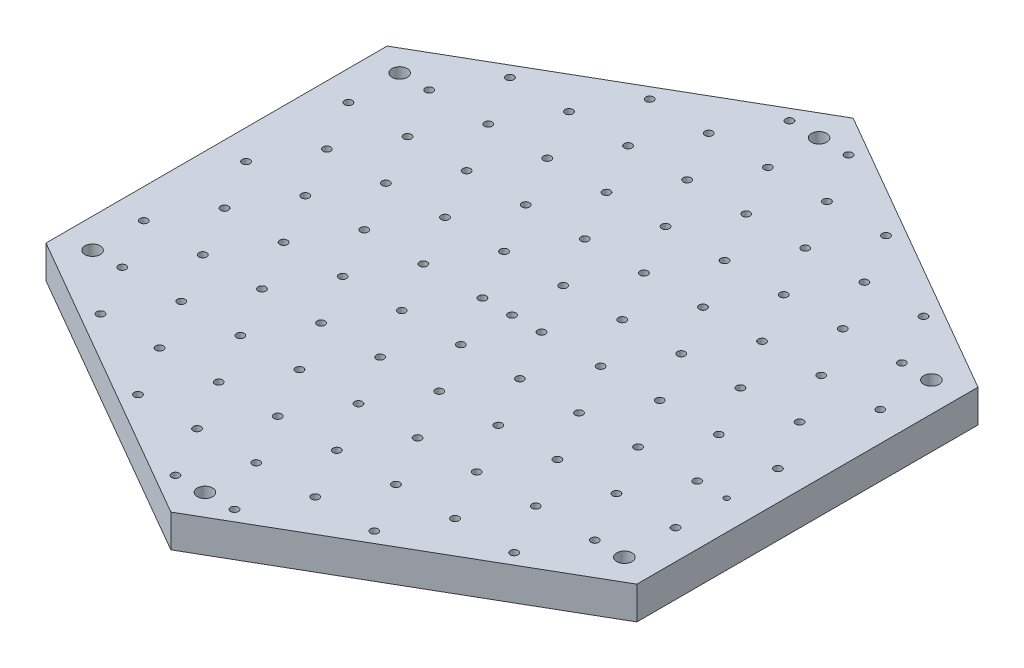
ISO-10303-21;
HEADER;
FILE_DESCRIPTION(('STEP AP214'),'2;1');
FILE_NAME('part.step','',(''),(''),'','','');
FILE_SCHEMA(('AUTOMOTIVE_DESIGN { 1 0 10303 214 1 1 1 1 }'));
ENDSEC;
DATA;
#1=APPLICATION_CONTEXT('core data for automotive mechanical design processes');
#2=APPLICATION_PROTOCOL_DEFINITION('international standard','automotive_design',2000,#1);
#3=PRODUCT_CONTEXT('',#1,'mechanical');
#4=PRODUCT('Part','Part','',(#3));
#5=PRODUCT_RELATED_PRODUCT_CATEGORY('part','',(#4));
#6=PRODUCT_DEFINITION_FORMATION('','',#4);
#7=PRODUCT_DEFINITION_CONTEXT('part definition',#1,'design');
#8=PRODUCT_DEFINITION('design','',#6,#7);
#9=PRODUCT_DEFINITION_SHAPE('','',#8);
#10=(LENGTH_UNIT() NAMED_UNIT(*) SI_UNIT(.MILLI.,.METRE.));
#11=(NAMED_UNIT(*) PLANE_ANGLE_UNIT() SI_UNIT($,.RADIAN.));
#12=(NAMED_UNIT(*) SI_UNIT($,.STERADIAN.) SOLID_ANGLE_UNIT());
#13=UNCERTAINTY_MEASURE_WITH_UNIT(LENGTH_MEASURE(1.E-05),#10,'distance_accuracy_value','');
#14=(GEOMETRIC_REPRESENTATION_CONTEXT(3) GLOBAL_UNCERTAINTY_ASSIGNED_CONTEXT((#13)) GLOBAL_UNIT_ASSIGNED_CONTEXT((#10,
#11,#12)) REPRESENTATION_CONTEXT('',''));
#15=CARTESIAN_POINT('',(0.,0.,0.));
#16=DIRECTION('',(0.,0.,1.));
#17=DIRECTION('',(1.,0.,0.));
#18=AXIS2_PLACEMENT_3D('',#15,#16,#17);
#19=CARTESIAN_POINT('',(54.1265877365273,6.,-31.25));
#20=DIRECTION('',(-0.5,0.,0.866025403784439));
#21=DIRECTION('',(0.866025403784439,0.,0.5));
#22=AXIS2_PLACEMENT_3D('',#19,#20,#21);
#23=PLANE('',#22);
#24=DIRECTION('',(-0.866025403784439,0.,-0.5));
#25=VECTOR('',#24,1.);
#26=CARTESIAN_POINT('',(54.1265877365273,0.,-31.25));
#27=LINE('',#26,#25);
#28=CARTESIAN_POINT('',(54.1265877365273,0.,-31.25));
#29=VERTEX_POINT('',#28);
#30=CARTESIAN_POINT('',(0.,0.,-62.5));
#31=VERTEX_POINT('',#30);
#32=EDGE_CURVE('E126',#29,#31,#27,.T.);
#33=ORIENTED_EDGE('',*,*,#32,.T.);
#34=DIRECTION('',(0.,-1.,0.));
#35=VECTOR('',#34,1.);
#36=CARTESIAN_POINT('',(0.,6.,-62.5));
#37=LINE('',#36,#35);
#38=CARTESIAN_POINT('',(0.,6.,-62.5));
#39=VERTEX_POINT('',#38);
#40=EDGE_CURVE('E13',#39,#31,#37,.T.);
#41=ORIENTED_EDGE('',*,*,#40,.F.);
#42=DIRECTION('',(-0.866025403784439,0.,-0.5));
#43=VECTOR('',#42,1.);
#44=CARTESIAN_POINT('',(54.1265877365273,6.,-31.25));
#45=LINE('',#44,#43);
#46=CARTESIAN_POINT('',(54.1265877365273,6.,-31.25));
#47=VERTEX_POINT('',#46);
#48=EDGE_CURVE('E93',#47,#39,#45,.T.);
#49=ORIENTED_EDGE('',*,*,#48,.F.);
#50=DIRECTION('',(0.,-1.,0.));
#51=VECTOR('',#50,1.);
#52=CARTESIAN_POINT('',(54.1265877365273,6.,-31.25));
#53=LINE('',#52,#51);
#54=EDGE_CURVE('E89',#47,#29,#53,.T.);
#55=ORIENTED_EDGE('',*,*,#54,.T.);
#56=EDGE_LOOP('',(#33,#41,#49,#55));
#57=FACE_BOUND('',#56,.T.);
#58=ADVANCED_FACE('F45',(#57),#23,.F.);
#59=CARTESIAN_POINT('',(0.,6.,-62.5));
#60=DIRECTION('',(0.5,0.,0.866025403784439));
#61=DIRECTION('',(0.866025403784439,0.,-0.5));
#62=AXIS2_PLACEMENT_3D('',#59,#60,#61);
#63=PLANE('',#62);
#64=DIRECTION('',(0.,-1.,0.));
#65=VECTOR('',#64,1.);
#66=CARTESIAN_POINT('',(-54.1265877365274,6.,-31.25));
#67=LINE('',#66,#65);
#68=CARTESIAN_POINT('',(-54.1265877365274,6.,-31.25));
#69=VERTEX_POINT('',#68);
#70=CARTESIAN_POINT('',(-54.1265877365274,0.,-31.25));
#71=VERTEX_POINT('',#70);
#72=EDGE_CURVE('E53',#69,#71,#67,.T.);
#73=ORIENTED_EDGE('',*,*,#72,.F.);
#74=DIRECTION('',(-0.866025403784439,0.,0.5));
#75=VECTOR('',#74,1.);
#76=CARTESIAN_POINT('',(0.,6.,-62.5));
#77=LINE('',#76,#75);
#78=EDGE_CURVE('E155',#39,#69,#77,.T.);
#79=ORIENTED_EDGE('',*,*,#78,.F.);
#80=ORIENTED_EDGE('',*,*,#40,.T.);
#81=DIRECTION('',(-0.866025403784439,0.,0.5));
#82=VECTOR('',#81,1.);
#83=CARTESIAN_POINT('',(0.,0.,-62.5));
#84=LINE('',#83,#82);
#85=EDGE_CURVE('E128',#31,#71,#84,.T.);
#86=ORIENTED_EDGE('',*,*,#85,.T.);
#87=EDGE_LOOP('',(#73,#79,#80,#86));
#88=FACE_BOUND('',#87,.T.);
#89=ADVANCED_FACE('F148',(#88),#63,.F.);
#90=CARTESIAN_POINT('',(-54.1265877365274,6.,-31.25));
#91=DIRECTION('',(1.,0.,0.));
#92=DIRECTION('',(0.,0.,-1.));
#93=AXIS2_PLACEMENT_3D('',#90,#91,#92);
#94=PLANE('',#93);
#95=DIRECTION('',(0.,-1.,0.));
#96=VECTOR('',#95,1.);
#97=CARTESIAN_POINT('',(-54.1265877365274,6.,31.25));
#98=LINE('',#97,#96);
#99=CARTESIAN_POINT('',(-54.1265877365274,6.,31.25));
#100=VERTEX_POINT('',#99);
#101=CARTESIAN_POINT('',(-54.1265877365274,0.,31.25));
#102=VERTEX_POINT('',#101);
#103=EDGE_CURVE('E119',#100,#102,#98,.T.);
#104=ORIENTED_EDGE('',*,*,#103,.F.);
#105=DIRECTION('',(0.,0.,1.));
#106=VECTOR('',#105,1.);
#107=CARTESIAN_POINT('',(-54.1265877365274,6.,-31.25));
#108=LINE('',#107,#106);
#109=EDGE_CURVE('E108',#69,#100,#108,.T.);
#110=ORIENTED_EDGE('',*,*,#109,.F.);
#111=ORIENTED_EDGE('',*,*,#72,.T.);
#112=DIRECTION('',(0.,0.,1.));
#113=VECTOR('',#112,1.);
#114=CARTESIAN_POINT('',(-54.1265877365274,0.,-31.25));
#115=LINE('',#114,#113);
#116=EDGE_CURVE('E132',#71,#102,#115,.T.);
#117=ORIENTED_EDGE('',*,*,#116,.T.);
#118=EDGE_LOOP('',(#104,#110,#111,#117));
#119=FACE_BOUND('',#118,.T.);
#120=ADVANCED_FACE('F144',(#119),#94,.F.);
#121=CARTESIAN_POINT('',(-54.1265877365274,6.,31.25));
#122=DIRECTION('',(0.5,0.,-0.866025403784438));
#123=DIRECTION('',(-0.866025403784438,0.,-0.5));
#124=AXIS2_PLACEMENT_3D('',#121,#122,#123);
#125=PLANE('',#124);
#126=DIRECTION('',(0.866025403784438,0.,0.5));
#127=VECTOR('',#126,1.);
#128=CARTESIAN_POINT('',(-54.1265877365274,0.,31.25));
#129=LINE('',#128,#127);
#130=CARTESIAN_POINT('',(0.,0.,62.5));
#131=VERTEX_POINT('',#130);
#132=EDGE_CURVE('E116',#102,#131,#129,.T.);
#133=ORIENTED_EDGE('',*,*,#132,.T.);
#134=DIRECTION('',(0.,-1.,0.));
#135=VECTOR('',#134,1.);
#136=CARTESIAN_POINT('',(0.,6.,62.5));
#137=LINE('',#136,#135);
#138=CARTESIAN_POINT('',(0.,6.,62.5));
#139=VERTEX_POINT('',#138);
#140=EDGE_CURVE('E113',#139,#131,#137,.T.);
#141=ORIENTED_EDGE('',*,*,#140,.F.);
#142=DIRECTION('',(0.866025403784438,0.,0.5));
#143=VECTOR('',#142,1.);
#144=CARTESIAN_POINT('',(-54.1265877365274,6.,31.25));
#145=LINE('',#144,#143);
#146=EDGE_CURVE('E101',#100,#139,#145,.T.);
#147=ORIENTED_EDGE('',*,*,#146,.F.);
#148=ORIENTED_EDGE('',*,*,#103,.T.);
#149=EDGE_LOOP('',(#133,#141,#147,#148));
#150=FACE_BOUND('',#149,.T.);
#151=ADVANCED_FACE('F114',(#150),#125,.F.);
#152=CARTESIAN_POINT('',(0.,6.,62.5));
#153=DIRECTION('',(-0.5,0.,-0.866025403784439));
#154=DIRECTION('',(-0.866025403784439,0.,0.5));
#155=AXIS2_PLACEMENT_3D('',#152,#153,#154);
#156=PLANE('',#155);
#157=DIRECTION('',(0.866025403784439,0.,-0.5));
#158=VECTOR('',#157,1.);
#159=CARTESIAN_POINT('',(0.,0.,62.5));
#160=LINE('',#159,#158);
#161=CARTESIAN_POINT('',(54.1265877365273,0.,31.25));
#162=VERTEX_POINT('',#161);
#163=EDGE_CURVE('E136',#131,#162,#160,.T.);
#164=ORIENTED_EDGE('',*,*,#163,.T.);
#165=DIRECTION('',(0.,-1.,0.));
#166=VECTOR('',#165,1.);
#167=CARTESIAN_POINT('',(54.1265877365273,6.,31.25));
#168=LINE('',#167,#166);
#169=CARTESIAN_POINT('',(54.1265877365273,6.,31.25));
#170=VERTEX_POINT('',#169);
#171=EDGE_CURVE('E82',#170,#162,#168,.T.);
#172=ORIENTED_EDGE('',*,*,#171,.F.);
#173=DIRECTION('',(0.866025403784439,0.,-0.5));
#174=VECTOR('',#173,1.);
#175=CARTESIAN_POINT('',(0.,6.,62.5));
#176=LINE('',#175,#174);
#177=EDGE_CURVE('E106',#139,#170,#176,.T.);
#178=ORIENTED_EDGE('',*,*,#177,.F.);
#179=ORIENTED_EDGE('',*,*,#140,.T.);
#180=EDGE_LOOP('',(#164,#172,#178,#179));
#181=FACE_BOUND('',#180,.T.);
#182=ADVANCED_FACE('F121',(#181),#156,.F.);
#183=CARTESIAN_POINT('',(54.1265877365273,6.,31.25));
#184=DIRECTION('',(-1.,0.,0.));
#185=DIRECTION('',(0.,0.,1.));
#186=AXIS2_PLACEMENT_3D('',#183,#184,#185);
#187=PLANE('',#186);
#188=ORIENTED_EDGE('',*,*,#54,.F.);
#189=DIRECTION('',(0.,0.,-1.));
#190=VECTOR('',#189,1.);
#191=CARTESIAN_POINT('',(54.1265877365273,6.,31.25));
#192=LINE('',#191,#190);
#193=EDGE_CURVE('E61',#170,#47,#192,.T.);
#194=ORIENTED_EDGE('',*,*,#193,.F.);
#195=ORIENTED_EDGE('',*,*,#171,.T.);
#196=DIRECTION('',(0.,0.,-1.));
#197=VECTOR('',#196,1.);
#198=CARTESIAN_POINT('',(54.1265877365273,0.,31.25));
#199=LINE('',#198,#197);
#200=EDGE_CURVE('E138',#162,#29,#199,.T.);
#201=ORIENTED_EDGE('',*,*,#200,.T.);
#202=EDGE_LOOP('',(#188,#194,#195,#201));
#203=FACE_BOUND('',#202,.T.);
#204=ADVANCED_FACE('F154',(#203),#187,.F.);
#205=CARTESIAN_POINT('',(0.,6.,0.));
#206=DIRECTION('',(0.,1.,0.));
#207=DIRECTION('',(0.,0.,1.));
#208=AXIS2_PLACEMENT_3D('',#205,#206,#207);
#209=PLANE('',#208);
#210=CARTESIAN_POINT('',(48.71385,6.,9.37498480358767));
#211=DIRECTION('',(0.,1.,0.));
#212=DIRECTION('',(0.,0.,1.));
#213=AXIS2_PLACEMENT_3D('',#210,#211,#212);
#214=CIRCLE('',#213,0.499999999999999);
#215=CARTESIAN_POINT('',(48.71385,6.,9.87498480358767));
#216=VERTEX_POINT('',#215);
#217=EDGE_CURVE('E777',#216,#216,#214,.T.);
#218=ORIENTED_EDGE('',*,*,#217,.F.);
#219=EDGE_LOOP('',(#218));
#220=FACE_BOUND('',#219,.T.);
#221=CARTESIAN_POINT('',(48.71385,6.,-18.7499696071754));
#222=DIRECTION('',(0.,1.,0.));
#223=DIRECTION('',(0.,0.,1.));
#224=AXIS2_PLACEMENT_3D('',#221,#222,#223);
#225=CIRCLE('',#224,0.700000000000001);
#226=CARTESIAN_POINT('',(48.71385,6.,-18.0499696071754));
#227=VERTEX_POINT('',#226);
#228=EDGE_CURVE('E771',#227,#227,#225,.T.);
#229=ORIENTED_EDGE('',*,*,#228,.F.);
#230=EDGE_LOOP('',(#229));
#231=FACE_BOUND('',#230,.T.);
#232=CARTESIAN_POINT('',(43.3012,6.,-28.1249544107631));
#233=DIRECTION('',(0.,1.,0.));
#234=DIRECTION('',(0.,0.,1.));
#235=AXIS2_PLACEMENT_3D('',#232,#233,#234);
#236=CIRCLE('',#235,0.699999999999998);
#237=CARTESIAN_POINT('',(43.3012,6.,-27.4249544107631));
#238=VERTEX_POINT('',#237);
#239=EDGE_CURVE('E765',#238,#238,#236,.T.);
#240=ORIENTED_EDGE('',*,*,#239,.F.);
#241=EDGE_LOOP('',(#240));
#242=FACE_BOUND('',#241,.T.);
#243=CARTESIAN_POINT('',(37.88855,6.,-37.4999392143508));
#244=DIRECTION('',(0.,1.,0.));
#245=DIRECTION('',(0.,0.,1.));
#246=AXIS2_PLACEMENT_3D('',#243,#244,#245);
#247=CIRCLE('',#246,0.699999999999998);
#248=CARTESIAN_POINT('',(37.88855,6.,-36.7999392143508));
#249=VERTEX_POINT('',#248);
#250=EDGE_CURVE('E759',#249,#249,#247,.T.);
#251=ORIENTED_EDGE('',*,*,#250,.F.);
#252=EDGE_LOOP('',(#251));
#253=FACE_BOUND('',#252,.T.);
#254=CARTESIAN_POINT('',(-21.6506,6.,46.8749240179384));
#255=DIRECTION('',(0.,1.,0.));
#256=DIRECTION('',(0.,0.,1.));
#257=AXIS2_PLACEMENT_3D('',#254,#255,#256);
#258=CIRCLE('',#257,0.700000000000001);
#259=CARTESIAN_POINT('',(-21.6506,6.,47.5749240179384));
#260=VERTEX_POINT('',#259);
#261=EDGE_CURVE('E753',#260,#260,#258,.T.);
#262=ORIENTED_EDGE('',*,*,#261,.F.);
#263=EDGE_LOOP('',(#262));
#264=FACE_BOUND('',#263,.T.);
#265=CARTESIAN_POINT('',(-5.41265000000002,6.,56.2499088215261));
#266=DIRECTION('',(0.,1.,0.));
#267=DIRECTION('',(0.,0.,1.));
#268=AXIS2_PLACEMENT_3D('',#265,#266,#267);
#269=CIRCLE('',#268,0.700000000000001);
#270=CARTESIAN_POINT('',(-5.41265000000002,6.,56.9499088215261));
#271=VERTEX_POINT('',#270);
#272=EDGE_CURVE('E747',#271,#271,#269,.T.);
#273=ORIENTED_EDGE('',*,*,#272,.F.);
#274=EDGE_LOOP('',(#273));
#275=FACE_BOUND('',#274,.T.);
#276=CARTESIAN_POINT('',(-10.8253,6.,46.8749240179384));
#277=DIRECTION('',(0.,1.,0.));
#278=DIRECTION('',(0.,0.,1.));
#279=AXIS2_PLACEMENT_3D('',#276,#277,#278);
#280=CIRCLE('',#279,0.700000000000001);
#281=CARTESIAN_POINT('',(-10.8253,6.,47.5749240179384));
#282=VERTEX_POINT('',#281);
#283=EDGE_CURVE('E741',#282,#282,#280,.T.);
#284=ORIENTED_EDGE('',*,*,#283,.F.);
#285=EDGE_LOOP('',(#284));
#286=FACE_BOUND('',#285,.T.);
#287=CARTESIAN_POINT('',(-16.23795,6.,37.4999392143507));
#288=DIRECTION('',(0.,1.,0.));
#289=DIRECTION('',(0.,0.,1.));
#290=AXIS2_PLACEMENT_3D('',#287,#288,#289);
#291=CIRCLE('',#290,0.700000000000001);
#292=CARTESIAN_POINT('',(-16.23795,6.,38.1999392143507));
#293=VERTEX_POINT('',#292);
#294=EDGE_CURVE('E735',#293,#293,#291,.T.);
#295=ORIENTED_EDGE('',*,*,#294,.F.);
#296=EDGE_LOOP('',(#295));
#297=FACE_BOUND('',#296,.T.);
#298=CARTESIAN_POINT('',(-48.71385,6.,-18.7499696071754));
#299=DIRECTION('',(0.,1.,0.));
#300=DIRECTION('',(0.,0.,1.));
#301=AXIS2_PLACEMENT_3D('',#298,#299,#300);
#302=CIRCLE('',#301,0.700000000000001);
#303=CARTESIAN_POINT('',(-48.71385,6.,-18.0499696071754));
#304=VERTEX_POINT('',#303);
#305=EDGE_CURVE('E729',#304,#304,#302,.T.);
#306=ORIENTED_EDGE('',*,*,#305,.F.);
#307=EDGE_LOOP('',(#306));
#308=FACE_BOUND('',#307,.T.);
#309=CARTESIAN_POINT('',(5.41264999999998,6.,56.2499088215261));
#310=DIRECTION('',(0.,1.,0.));
#311=DIRECTION('',(0.,0.,1.));
#312=AXIS2_PLACEMENT_3D('',#309,#310,#311);
#313=CIRCLE('',#312,0.699999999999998);
#314=CARTESIAN_POINT('',(5.41264999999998,6.,56.9499088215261));
#315=VERTEX_POINT('',#314);
#316=EDGE_CURVE('E723',#315,#315,#313,.T.);
#317=ORIENTED_EDGE('',*,*,#316,.F.);
#318=EDGE_LOOP('',(#317));
#319=FACE_BOUND('',#318,.T.);
#320=CARTESIAN_POINT('',(0.,6.,46.8749240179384));
#321=DIRECTION('',(0.,1.,0.));
#322=DIRECTION('',(0.,0.,1.));
#323=AXIS2_PLACEMENT_3D('',#320,#321,#322);
#324=CIRCLE('',#323,0.699999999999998);
#325=CARTESIAN_POINT('',(0.,6.,47.5749240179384));
#326=VERTEX_POINT('',#325);
#327=EDGE_CURVE('E717',#326,#326,#324,.T.);
#328=ORIENTED_EDGE('',*,*,#327,.F.);
#329=EDGE_LOOP('',(#328));
#330=FACE_BOUND('',#329,.T.);
#331=CARTESIAN_POINT('',(-5.41265000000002,6.,37.4999392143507));
#332=DIRECTION('',(0.,1.,0.));
#333=DIRECTION('',(0.,0.,1.));
#334=AXIS2_PLACEMENT_3D('',#331,#332,#333);
#335=CIRCLE('',#334,0.699999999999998);
#336=CARTESIAN_POINT('',(-5.41265000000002,6.,38.1999392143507));
#337=VERTEX_POINT('',#336);
#338=EDGE_CURVE('E711',#337,#337,#335,.T.);
#339=ORIENTED_EDGE('',*,*,#338,.F.);
#340=EDGE_LOOP('',(#339));
#341=FACE_BOUND('',#340,.T.);
#342=CARTESIAN_POINT('',(-10.8253,6.,28.124954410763));
#343=DIRECTION('',(0.,1.,0.));
#344=DIRECTION('',(0.,0.,1.));
#345=AXIS2_PLACEMENT_3D('',#342,#343,#344);
#346=CIRCLE('',#345,0.699999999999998);
#347=CARTESIAN_POINT('',(-10.8253,6.,28.824954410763));
#348=VERTEX_POINT('',#347);
#349=EDGE_CURVE('E705',#348,#348,#346,.T.);
#350=ORIENTED_EDGE('',*,*,#349,.F.);
#351=EDGE_LOOP('',(#350));
#352=FACE_BOUND('',#351,.T.);
#353=CARTESIAN_POINT('',(-43.3012,6.,-28.1249544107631));
#354=DIRECTION('',(0.,1.,0.));
#355=DIRECTION('',(0.,0.,1.));
#356=AXIS2_PLACEMENT_3D('',#353,#354,#355);
#357=CIRCLE('',#356,0.699999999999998);
#358=CARTESIAN_POINT('',(-43.3012,6.,-27.4249544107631));
#359=VERTEX_POINT('',#358);
#360=EDGE_CURVE('E699',#359,#359,#357,.T.);
#361=ORIENTED_EDGE('',*,*,#360,.F.);
#362=EDGE_LOOP('',(#361));
#363=FACE_BOUND('',#362,.T.);
#364=CARTESIAN_POINT('',(10.8253,6.,46.8749240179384));
#365=DIRECTION('',(0.,1.,0.));
#366=DIRECTION('',(0.,0.,1.));
#367=AXIS2_PLACEMENT_3D('',#364,#365,#366);
#368=CIRCLE('',#367,0.7);
#369=CARTESIAN_POINT('',(10.8253,6.,47.5749240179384));
#370=VERTEX_POINT('',#369);
#371=EDGE_CURVE('E693',#370,#370,#368,.T.);
#372=ORIENTED_EDGE('',*,*,#371,.F.);
#373=EDGE_LOOP('',(#372));
#374=FACE_BOUND('',#373,.T.);
#375=CARTESIAN_POINT('',(5.41264999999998,6.,37.4999392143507));
#376=DIRECTION('',(0.,1.,0.));
#377=DIRECTION('',(0.,0.,1.));
#378=AXIS2_PLACEMENT_3D('',#375,#376,#377);
#379=CIRCLE('',#378,0.7);
#380=CARTESIAN_POINT('',(5.41264999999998,6.,38.1999392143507));
#381=VERTEX_POINT('',#380);
#382=EDGE_CURVE('E687',#381,#381,#379,.T.);
#383=ORIENTED_EDGE('',*,*,#382,.F.);
#384=EDGE_LOOP('',(#383));
#385=FACE_BOUND('',#384,.T.);
#386=CARTESIAN_POINT('',(0.,6.,28.124954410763));
#387=DIRECTION('',(0.,1.,0.));
#388=DIRECTION('',(0.,0.,1.));
#389=AXIS2_PLACEMENT_3D('',#386,#387,#388);
#390=CIRCLE('',#389,0.7);
#391=CARTESIAN_POINT('',(0.,6.,28.824954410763));
#392=VERTEX_POINT('',#391);
#393=EDGE_CURVE('E681',#392,#392,#390,.T.);
#394=ORIENTED_EDGE('',*,*,#393,.F.);
#395=EDGE_LOOP('',(#394));
#396=FACE_BOUND('',#395,.T.);
#397=CARTESIAN_POINT('',(-5.41265000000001,6.,18.7499696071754));
#398=DIRECTION('',(0.,1.,0.));
#399=DIRECTION('',(0.,0.,1.));
#400=AXIS2_PLACEMENT_3D('',#397,#398,#399);
#401=CIRCLE('',#400,0.7);
#402=CARTESIAN_POINT('',(-5.41265000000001,6.,19.4499696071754));
#403=VERTEX_POINT('',#402);
#404=EDGE_CURVE('E675',#403,#403,#401,.T.);
#405=ORIENTED_EDGE('',*,*,#404,.F.);
#406=EDGE_LOOP('',(#405));
#407=FACE_BOUND('',#406,.T.);
#408=CARTESIAN_POINT('',(-37.88855,6.,-37.4999392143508));
#409=DIRECTION('',(0.,1.,0.));
#410=DIRECTION('',(0.,0.,1.));
#411=AXIS2_PLACEMENT_3D('',#408,#409,#410);
#412=CIRCLE('',#411,0.7);
#413=CARTESIAN_POINT('',(-37.88855,6.,-36.7999392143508));
#414=VERTEX_POINT('',#413);
#415=EDGE_CURVE('E669',#414,#414,#412,.T.);
#416=ORIENTED_EDGE('',*,*,#415,.F.);
#417=EDGE_LOOP('',(#416));
#418=FACE_BOUND('',#417,.T.);
#419=CARTESIAN_POINT('',(21.6506,6.,46.8749240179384));
#420=DIRECTION('',(0.,1.,0.));
#421=DIRECTION('',(0.,0.,1.));
#422=AXIS2_PLACEMENT_3D('',#419,#420,#421);
#423=CIRCLE('',#422,0.7);
#424=CARTESIAN_POINT('',(21.6506,6.,47.5749240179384));
#425=VERTEX_POINT('',#424);
#426=EDGE_CURVE('E663',#425,#425,#423,.T.);
#427=ORIENTED_EDGE('',*,*,#426,.F.);
#428=EDGE_LOOP('',(#427));
#429=FACE_BOUND('',#428,.T.);
#430=CARTESIAN_POINT('',(16.23795,6.,37.4999392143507));
#431=DIRECTION('',(0.,1.,0.));
#432=DIRECTION('',(0.,0.,1.));
#433=AXIS2_PLACEMENT_3D('',#430,#431,#432);
#434=CIRCLE('',#433,0.7);
#435=CARTESIAN_POINT('',(16.23795,6.,38.1999392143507));
#436=VERTEX_POINT('',#435);
#437=EDGE_CURVE('E657',#436,#436,#434,.T.);
#438=ORIENTED_EDGE('',*,*,#437,.F.);
#439=EDGE_LOOP('',(#438));
#440=FACE_BOUND('',#439,.T.);
#441=CARTESIAN_POINT('',(10.8253,6.,28.124954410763));
#442=DIRECTION('',(0.,1.,0.));
#443=DIRECTION('',(0.,0.,1.));
#444=AXIS2_PLACEMENT_3D('',#441,#442,#443);
#445=CIRCLE('',#444,0.7);
#446=CARTESIAN_POINT('',(10.8253,6.,28.824954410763));
#447=VERTEX_POINT('',#446);
#448=EDGE_CURVE('E651',#447,#447,#445,.T.);
#449=ORIENTED_EDGE('',*,*,#448,.F.);
#450=EDGE_LOOP('',(#449));
#451=FACE_BOUND('',#450,.T.);
#452=CARTESIAN_POINT('',(5.41264999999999,6.,18.7499696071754));
#453=DIRECTION('',(0.,1.,0.));
#454=DIRECTION('',(0.,0.,1.));
#455=AXIS2_PLACEMENT_3D('',#452,#453,#454);
#456=CIRCLE('',#455,0.7);
#457=CARTESIAN_POINT('',(5.41264999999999,6.,19.4499696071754));
#458=VERTEX_POINT('',#457);
#459=EDGE_CURVE('E645',#458,#458,#456,.T.);
#460=ORIENTED_EDGE('',*,*,#459,.F.);
#461=EDGE_LOOP('',(#460));
#462=FACE_BOUND('',#461,.T.);
#463=CARTESIAN_POINT('',(0.,6.,9.37498480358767));
#464=DIRECTION('',(0.,1.,0.));
#465=DIRECTION('',(0.,0.,1.));
#466=AXIS2_PLACEMENT_3D('',#463,#464,#465);
#467=CIRCLE('',#466,0.7);
#468=CARTESIAN_POINT('',(0.,6.,10.0749848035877));
#469=VERTEX_POINT('',#468);
#470=EDGE_CURVE('E639',#469,#469,#467,.T.);
#471=ORIENTED_EDGE('',*,*,#470,.F.);
#472=EDGE_LOOP('',(#471));
#473=FACE_BOUND('',#472,.T.);
#474=CARTESIAN_POINT('',(-27.06325,6.,-37.4999392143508));
#475=DIRECTION('',(0.,1.,0.));
#476=DIRECTION('',(0.,0.,1.));
#477=AXIS2_PLACEMENT_3D('',#474,#475,#476);
#478=CIRCLE('',#477,0.700000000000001);
#479=CARTESIAN_POINT('',(-27.06325,6.,-36.7999392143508));
#480=VERTEX_POINT('',#479);
#481=EDGE_CURVE('E633',#480,#480,#478,.T.);
#482=ORIENTED_EDGE('',*,*,#481,.F.);
#483=EDGE_LOOP('',(#482));
#484=FACE_BOUND('',#483,.T.);
#485=CARTESIAN_POINT('',(-32.4759,6.,-28.1249544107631));
#486=DIRECTION('',(0.,1.,0.));
#487=DIRECTION('',(0.,0.,1.));
#488=AXIS2_PLACEMENT_3D('',#485,#486,#487);
#489=CIRCLE('',#488,0.700000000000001);
#490=CARTESIAN_POINT('',(-32.4759,6.,-27.4249544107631));
#491=VERTEX_POINT('',#490);
#492=EDGE_CURVE('E627',#491,#491,#489,.T.);
#493=ORIENTED_EDGE('',*,*,#492,.F.);
#494=EDGE_LOOP('',(#493));
#495=FACE_BOUND('',#494,.T.);
#496=CARTESIAN_POINT('',(-37.88855,6.,-18.7499696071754));
#497=DIRECTION('',(0.,1.,0.));
#498=DIRECTION('',(0.,0.,1.));
#499=AXIS2_PLACEMENT_3D('',#496,#497,#498);
#500=CIRCLE('',#499,0.700000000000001);
#501=CARTESIAN_POINT('',(-37.88855,6.,-18.0499696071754));
#502=VERTEX_POINT('',#501);
#503=EDGE_CURVE('E621',#502,#502,#500,.T.);
#504=ORIENTED_EDGE('',*,*,#503,.F.);
#505=EDGE_LOOP('',(#504));
#506=FACE_BOUND('',#505,.T.);
#507=CARTESIAN_POINT('',(-43.3012,6.,-9.3749848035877));
#508=DIRECTION('',(0.,1.,0.));
#509=DIRECTION('',(0.,0.,1.));
#510=AXIS2_PLACEMENT_3D('',#507,#508,#509);
#511=CIRCLE('',#510,0.700000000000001);
#512=CARTESIAN_POINT('',(-43.3012,6.,-8.6749848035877));
#513=VERTEX_POINT('',#512);
#514=EDGE_CURVE('E615',#513,#513,#511,.T.);
#515=ORIENTED_EDGE('',*,*,#514,.F.);
#516=EDGE_LOOP('',(#515));
#517=FACE_BOUND('',#516,.T.);
#518=CARTESIAN_POINT('',(-21.6506,6.,-28.1249544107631));
#519=DIRECTION('',(0.,1.,0.));
#520=DIRECTION('',(0.,0.,1.));
#521=AXIS2_PLACEMENT_3D('',#518,#519,#520);
#522=CIRCLE('',#521,0.700000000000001);
#523=CARTESIAN_POINT('',(-21.6506,6.,-27.4249544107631));
#524=VERTEX_POINT('',#523);
#525=EDGE_CURVE('E609',#524,#524,#522,.T.);
#526=ORIENTED_EDGE('',*,*,#525,.F.);
#527=EDGE_LOOP('',(#526));
#528=FACE_BOUND('',#527,.T.);
#529=CARTESIAN_POINT('',(-27.06325,6.,-18.7499696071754));
#530=DIRECTION('',(0.,1.,0.));
#531=DIRECTION('',(0.,0.,1.));
#532=AXIS2_PLACEMENT_3D('',#529,#530,#531);
#533=CIRCLE('',#532,0.700000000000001);
#534=CARTESIAN_POINT('',(-27.06325,6.,-18.0499696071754));
#535=VERTEX_POINT('',#534);
#536=EDGE_CURVE('E603',#535,#535,#533,.T.);
#537=ORIENTED_EDGE('',*,*,#536,.F.);
#538=EDGE_LOOP('',(#537));
#539=FACE_BOUND('',#538,.T.);
#540=CARTESIAN_POINT('',(-32.4759,6.,-9.3749848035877));
#541=DIRECTION('',(0.,1.,0.));
#542=DIRECTION('',(0.,0.,1.));
#543=AXIS2_PLACEMENT_3D('',#540,#541,#542);
#544=CIRCLE('',#543,0.700000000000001);
#545=CARTESIAN_POINT('',(-32.4759,6.,-8.6749848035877));
#546=VERTEX_POINT('',#545);
#547=EDGE_CURVE('E597',#546,#546,#544,.T.);
#548=ORIENTED_EDGE('',*,*,#547,.F.);
#549=EDGE_LOOP('',(#548));
#550=FACE_BOUND('',#549,.T.);
#551=CARTESIAN_POINT('',(-48.71385,6.,18.7499696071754));
#552=DIRECTION('',(0.,1.,0.));
#553=DIRECTION('',(0.,0.,1.));
#554=AXIS2_PLACEMENT_3D('',#551,#552,#553);
#555=CIRCLE('',#554,0.700000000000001);
#556=CARTESIAN_POINT('',(-48.71385,6.,19.4499696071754));
#557=VERTEX_POINT('',#556);
#558=EDGE_CURVE('E591',#557,#557,#555,.T.);
#559=ORIENTED_EDGE('',*,*,#558,.F.);
#560=EDGE_LOOP('',(#559));
#561=FACE_BOUND('',#560,.T.);
#562=CARTESIAN_POINT('',(-43.3012,6.,9.37498480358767));
#563=DIRECTION('',(0.,1.,0.));
#564=DIRECTION('',(0.,0.,1.));
#565=AXIS2_PLACEMENT_3D('',#562,#563,#564);
#566=CIRCLE('',#565,0.700000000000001);
#567=CARTESIAN_POINT('',(-43.3012,6.,10.0749848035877));
#568=VERTEX_POINT('',#567);
#569=EDGE_CURVE('E585',#568,#568,#566,.T.);
#570=ORIENTED_EDGE('',*,*,#569,.F.);
#571=EDGE_LOOP('',(#570));
#572=FACE_BOUND('',#571,.T.);
#573=CARTESIAN_POINT('',(-43.3012,6.,28.124954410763));
#574=DIRECTION('',(0.,1.,0.));
#575=DIRECTION('',(0.,0.,1.));
#576=AXIS2_PLACEMENT_3D('',#573,#574,#575);
#577=CIRCLE('',#576,0.699999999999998);
#578=CARTESIAN_POINT('',(-43.3012,6.,28.824954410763));
#579=VERTEX_POINT('',#578);
#580=EDGE_CURVE('E579',#579,#579,#577,.T.);
#581=ORIENTED_EDGE('',*,*,#580,.F.);
#582=EDGE_LOOP('',(#581));
#583=FACE_BOUND('',#582,.T.);
#584=CARTESIAN_POINT('',(-37.88855,6.,18.7499696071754));
#585=DIRECTION('',(0.,1.,0.));
#586=DIRECTION('',(0.,0.,1.));
#587=AXIS2_PLACEMENT_3D('',#584,#585,#586);
#588=CIRCLE('',#587,0.699999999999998);
#589=CARTESIAN_POINT('',(-37.88855,6.,19.4499696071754));
#590=VERTEX_POINT('',#589);
#591=EDGE_CURVE('E573',#590,#590,#588,.T.);
#592=ORIENTED_EDGE('',*,*,#591,.F.);
#593=EDGE_LOOP('',(#592));
#594=FACE_BOUND('',#593,.T.);
#595=CARTESIAN_POINT('',(-32.4759,6.,9.37498480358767));
#596=DIRECTION('',(0.,1.,0.));
#597=DIRECTION('',(0.,0.,1.));
#598=AXIS2_PLACEMENT_3D('',#595,#596,#597);
#599=CIRCLE('',#598,0.699999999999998);
#600=CARTESIAN_POINT('',(-32.4759,6.,10.0749848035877));
#601=VERTEX_POINT('',#600);
#602=EDGE_CURVE('E567',#601,#601,#599,.T.);
#603=ORIENTED_EDGE('',*,*,#602,.F.);
#604=EDGE_LOOP('',(#603));
#605=FACE_BOUND('',#604,.T.);
#606=CARTESIAN_POINT('',(-16.23795,6.,-18.7499696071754));
#607=DIRECTION('',(0.,1.,0.));
#608=DIRECTION('',(0.,0.,1.));
#609=AXIS2_PLACEMENT_3D('',#606,#607,#608);
#610=CIRCLE('',#609,0.699999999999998);
#611=CARTESIAN_POINT('',(-16.23795,6.,-18.0499696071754));
#612=VERTEX_POINT('',#611);
#613=EDGE_CURVE('E561',#612,#612,#610,.T.);
#614=ORIENTED_EDGE('',*,*,#613,.F.);
#615=EDGE_LOOP('',(#614));
#616=FACE_BOUND('',#615,.T.);
#617=CARTESIAN_POINT('',(-21.6506,6.,-9.3749848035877));
#618=DIRECTION('',(0.,1.,0.));
#619=DIRECTION('',(0.,0.,1.));
#620=AXIS2_PLACEMENT_3D('',#617,#618,#619);
#621=CIRCLE('',#620,0.699999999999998);
#622=CARTESIAN_POINT('',(-21.6506,6.,-8.6749848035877));
#623=VERTEX_POINT('',#622);
#624=EDGE_CURVE('E555',#623,#623,#621,.T.);
#625=ORIENTED_EDGE('',*,*,#624,.F.);
#626=EDGE_LOOP('',(#625));
#627=FACE_BOUND('',#626,.T.);
#628=CARTESIAN_POINT('',(-37.88855,6.,37.4999392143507));
#629=DIRECTION('',(0.,1.,0.));
#630=DIRECTION('',(0.,0.,1.));
#631=AXIS2_PLACEMENT_3D('',#628,#629,#630);
#632=CIRCLE('',#631,0.7);
#633=CARTESIAN_POINT('',(-37.88855,6.,38.1999392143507));
#634=VERTEX_POINT('',#633);
#635=EDGE_CURVE('E549',#634,#634,#632,.T.);
#636=ORIENTED_EDGE('',*,*,#635,.F.);
#637=EDGE_LOOP('',(#636));
#638=FACE_BOUND('',#637,.T.);
#639=CARTESIAN_POINT('',(-32.4759,6.,28.124954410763));
#640=DIRECTION('',(0.,1.,0.));
#641=DIRECTION('',(0.,0.,1.));
#642=AXIS2_PLACEMENT_3D('',#639,#640,#641);
#643=CIRCLE('',#642,0.7);
#644=CARTESIAN_POINT('',(-32.4759,6.,28.824954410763));
#645=VERTEX_POINT('',#644);
#646=EDGE_CURVE('E543',#645,#645,#643,.T.);
#647=ORIENTED_EDGE('',*,*,#646,.F.);
#648=EDGE_LOOP('',(#647));
#649=FACE_BOUND('',#648,.T.);
#650=CARTESIAN_POINT('',(-27.06325,6.,18.7499696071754));
#651=DIRECTION('',(0.,1.,0.));
#652=DIRECTION('',(0.,0.,1.));
#653=AXIS2_PLACEMENT_3D('',#650,#651,#652);
#654=CIRCLE('',#653,0.7);
#655=CARTESIAN_POINT('',(-27.06325,6.,19.4499696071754));
#656=VERTEX_POINT('',#655);
#657=EDGE_CURVE('E537',#656,#656,#654,.T.);
#658=ORIENTED_EDGE('',*,*,#657,.F.);
#659=EDGE_LOOP('',(#658));
#660=FACE_BOUND('',#659,.T.);
#661=CARTESIAN_POINT('',(-21.6506,6.,9.37498480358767));
#662=DIRECTION('',(0.,1.,0.));
#663=DIRECTION('',(0.,0.,1.));
#664=AXIS2_PLACEMENT_3D('',#661,#662,#663);
#665=CIRCLE('',#664,0.7);
#666=CARTESIAN_POINT('',(-21.6506,6.,10.0749848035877));
#667=VERTEX_POINT('',#666);
#668=EDGE_CURVE('E531',#667,#667,#665,.T.);
#669=ORIENTED_EDGE('',*,*,#668,.F.);
#670=EDGE_LOOP('',(#669));
#671=FACE_BOUND('',#670,.T.);
#672=CARTESIAN_POINT('',(-10.8253,6.,-9.3749848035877));
#673=DIRECTION('',(0.,1.,0.));
#674=DIRECTION('',(0.,0.,1.));
#675=AXIS2_PLACEMENT_3D('',#672,#673,#674);
#676=CIRCLE('',#675,0.7);
#677=CARTESIAN_POINT('',(-10.8253,6.,-8.6749848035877));
#678=VERTEX_POINT('',#677);
#679=EDGE_CURVE('E525',#678,#678,#676,.T.);
#680=ORIENTED_EDGE('',*,*,#679,.F.);
#681=EDGE_LOOP('',(#680));
#682=FACE_BOUND('',#681,.T.);
#683=CARTESIAN_POINT('',(-27.06325,6.,37.4999392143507));
#684=DIRECTION('',(0.,1.,0.));
#685=DIRECTION('',(0.,0.,1.));
#686=AXIS2_PLACEMENT_3D('',#683,#684,#685);
#687=CIRCLE('',#686,0.7);
#688=CARTESIAN_POINT('',(-27.06325,6.,38.1999392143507));
#689=VERTEX_POINT('',#688);
#690=EDGE_CURVE('E519',#689,#689,#687,.T.);
#691=ORIENTED_EDGE('',*,*,#690,.F.);
#692=EDGE_LOOP('',(#691));
#693=FACE_BOUND('',#692,.T.);
#694=CARTESIAN_POINT('',(-21.6506,6.,28.124954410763));
#695=DIRECTION('',(0.,1.,0.));
#696=DIRECTION('',(0.,0.,1.));
#697=AXIS2_PLACEMENT_3D('',#694,#695,#696);
#698=CIRCLE('',#697,0.7);
#699=CARTESIAN_POINT('',(-21.6506,6.,28.824954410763));
#700=VERTEX_POINT('',#699);
#701=EDGE_CURVE('E513',#700,#700,#698,.T.);
#702=ORIENTED_EDGE('',*,*,#701,.F.);
#703=EDGE_LOOP('',(#702));
#704=FACE_BOUND('',#703,.T.);
#705=CARTESIAN_POINT('',(-16.23795,6.,18.7499696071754));
#706=DIRECTION('',(0.,1.,0.));
#707=DIRECTION('',(0.,0.,1.));
#708=AXIS2_PLACEMENT_3D('',#705,#706,#707);
#709=CIRCLE('',#708,0.7);
#710=CARTESIAN_POINT('',(-16.23795,6.,19.4499696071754));
#711=VERTEX_POINT('',#710);
#712=EDGE_CURVE('E507',#711,#711,#709,.T.);
#713=ORIENTED_EDGE('',*,*,#712,.F.);
#714=EDGE_LOOP('',(#713));
#715=FACE_BOUND('',#714,.T.);
#716=CARTESIAN_POINT('',(-10.8253,6.,9.37498480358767));
#717=DIRECTION('',(0.,1.,0.));
#718=DIRECTION('',(0.,0.,1.));
#719=AXIS2_PLACEMENT_3D('',#716,#717,#718);
#720=CIRCLE('',#719,0.7);
#721=CARTESIAN_POINT('',(-10.8253,6.,10.0749848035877));
#722=VERTEX_POINT('',#721);
#723=EDGE_CURVE('E501',#722,#722,#720,.T.);
#724=ORIENTED_EDGE('',*,*,#723,.F.);
#725=EDGE_LOOP('',(#724));
#726=FACE_BOUND('',#725,.T.);
#727=CARTESIAN_POINT('',(21.6506,6.,-46.8749240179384));
#728=DIRECTION('',(0.,1.,0.));
#729=DIRECTION('',(0.,0.,1.));
#730=AXIS2_PLACEMENT_3D('',#727,#728,#729);
#731=CIRCLE('',#730,0.700000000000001);
#732=CARTESIAN_POINT('',(21.6506,6.,-46.1749240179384));
#733=VERTEX_POINT('',#732);
#734=EDGE_CURVE('E495',#733,#733,#731,.T.);
#735=ORIENTED_EDGE('',*,*,#734,.F.);
#736=EDGE_LOOP('',(#735));
#737=FACE_BOUND('',#736,.T.);
#738=CARTESIAN_POINT('',(27.06325,6.,-37.4999392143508));
#739=DIRECTION('',(0.,1.,0.));
#740=DIRECTION('',(0.,0.,1.));
#741=AXIS2_PLACEMENT_3D('',#738,#739,#740);
#742=CIRCLE('',#741,0.700000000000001);
#743=CARTESIAN_POINT('',(27.06325,6.,-36.7999392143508));
#744=VERTEX_POINT('',#743);
#745=EDGE_CURVE('E489',#744,#744,#742,.T.);
#746=ORIENTED_EDGE('',*,*,#745,.F.);
#747=EDGE_LOOP('',(#746));
#748=FACE_BOUND('',#747,.T.);
#749=CARTESIAN_POINT('',(32.4759,6.,-28.1249544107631));
#750=DIRECTION('',(0.,1.,0.));
#751=DIRECTION('',(0.,0.,1.));
#752=AXIS2_PLACEMENT_3D('',#749,#750,#751);
#753=CIRCLE('',#752,0.700000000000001);
#754=CARTESIAN_POINT('',(32.4759,6.,-27.4249544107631));
#755=VERTEX_POINT('',#754);
#756=EDGE_CURVE('E483',#755,#755,#753,.T.);
#757=ORIENTED_EDGE('',*,*,#756,.F.);
#758=EDGE_LOOP('',(#757));
#759=FACE_BOUND('',#758,.T.);
#760=CARTESIAN_POINT('',(37.88855,6.,-18.7499696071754));
#761=DIRECTION('',(0.,1.,0.));
#762=DIRECTION('',(0.,0.,1.));
#763=AXIS2_PLACEMENT_3D('',#760,#761,#762);
#764=CIRCLE('',#763,0.700000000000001);
#765=CARTESIAN_POINT('',(37.88855,6.,-18.0499696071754));
#766=VERTEX_POINT('',#765);
#767=EDGE_CURVE('E477',#766,#766,#764,.T.);
#768=ORIENTED_EDGE('',*,*,#767,.F.);
#769=EDGE_LOOP('',(#768));
#770=FACE_BOUND('',#769,.T.);
#771=CARTESIAN_POINT('',(43.3012,6.,-9.3749848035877));
#772=DIRECTION('',(0.,1.,0.));
#773=DIRECTION('',(0.,0.,1.));
#774=AXIS2_PLACEMENT_3D('',#771,#772,#773);
#775=CIRCLE('',#774,0.700000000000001);
#776=CARTESIAN_POINT('',(43.3012,6.,-8.6749848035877));
#777=VERTEX_POINT('',#776);
#778=EDGE_CURVE('E471',#777,#777,#775,.T.);
#779=ORIENTED_EDGE('',*,*,#778,.F.);
#780=EDGE_LOOP('',(#779));
#781=FACE_BOUND('',#780,.T.);
#782=CARTESIAN_POINT('',(48.71385,6.,18.7499696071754));
#783=DIRECTION('',(0.,1.,0.));
#784=DIRECTION('',(0.,0.,1.));
#785=AXIS2_PLACEMENT_3D('',#782,#783,#784);
#786=CIRCLE('',#785,0.700000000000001);
#787=CARTESIAN_POINT('',(48.71385,6.,19.4499696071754));
#788=VERTEX_POINT('',#787);
#789=EDGE_CURVE('E465',#788,#788,#786,.T.);
#790=ORIENTED_EDGE('',*,*,#789,.F.);
#791=EDGE_LOOP('',(#790));
#792=FACE_BOUND('',#791,.T.);
#793=CARTESIAN_POINT('',(43.3012,6.,9.37498480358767));
#794=DIRECTION('',(0.,1.,0.));
#795=DIRECTION('',(0.,0.,1.));
#796=AXIS2_PLACEMENT_3D('',#793,#794,#795);
#797=CIRCLE('',#796,0.700000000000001);
#798=CARTESIAN_POINT('',(43.3012,6.,10.0749848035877));
#799=VERTEX_POINT('',#798);
#800=EDGE_CURVE('E459',#799,#799,#797,.T.);
#801=ORIENTED_EDGE('',*,*,#800,.F.);
#802=EDGE_LOOP('',(#801));
#803=FACE_BOUND('',#802,.T.);
#804=CARTESIAN_POINT('',(5.41265000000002,6.,-56.2499088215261));
#805=DIRECTION('',(0.,1.,0.));
#806=DIRECTION('',(0.,0.,1.));
#807=AXIS2_PLACEMENT_3D('',#804,#805,#806);
#808=CIRCLE('',#807,0.700000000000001);
#809=CARTESIAN_POINT('',(5.41265000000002,6.,-55.5499088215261));
#810=VERTEX_POINT('',#809);
#811=EDGE_CURVE('E453',#810,#810,#808,.T.);
#812=ORIENTED_EDGE('',*,*,#811,.F.);
#813=EDGE_LOOP('',(#812));
#814=FACE_BOUND('',#813,.T.);
#815=CARTESIAN_POINT('',(10.8253,6.,-46.8749240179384));
#816=DIRECTION('',(0.,1.,0.));
#817=DIRECTION('',(0.,0.,1.));
#818=AXIS2_PLACEMENT_3D('',#815,#816,#817);
#819=CIRCLE('',#818,0.700000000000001);
#820=CARTESIAN_POINT('',(10.8253,6.,-46.1749240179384));
#821=VERTEX_POINT('',#820);
#822=EDGE_CURVE('E447',#821,#821,#819,.T.);
#823=ORIENTED_EDGE('',*,*,#822,.F.);
#824=EDGE_LOOP('',(#823));
#825=FACE_BOUND('',#824,.T.);
#826=CARTESIAN_POINT('',(16.23795,6.,-37.4999392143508));
#827=DIRECTION('',(0.,1.,0.));
#828=DIRECTION('',(0.,0.,1.));
#829=AXIS2_PLACEMENT_3D('',#826,#827,#828);
#830=CIRCLE('',#829,0.700000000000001);
#831=CARTESIAN_POINT('',(16.23795,6.,-36.7999392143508));
#832=VERTEX_POINT('',#831);
#833=EDGE_CURVE('E441',#832,#832,#830,.T.);
#834=ORIENTED_EDGE('',*,*,#833,.F.);
#835=EDGE_LOOP('',(#834));
#836=FACE_BOUND('',#835,.T.);
#837=CARTESIAN_POINT('',(21.6506,6.,-28.1249544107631));
#838=DIRECTION('',(0.,1.,0.));
#839=DIRECTION('',(0.,0.,1.));
#840=AXIS2_PLACEMENT_3D('',#837,#838,#839);
#841=CIRCLE('',#840,0.700000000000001);
#842=CARTESIAN_POINT('',(21.6506,6.,-27.4249544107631));
#843=VERTEX_POINT('',#842);
#844=EDGE_CURVE('E435',#843,#843,#841,.T.);
#845=ORIENTED_EDGE('',*,*,#844,.F.);
#846=EDGE_LOOP('',(#845));
#847=FACE_BOUND('',#846,.T.);
#848=CARTESIAN_POINT('',(27.06325,6.,-18.7499696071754));
#849=DIRECTION('',(0.,1.,0.));
#850=DIRECTION('',(0.,0.,1.));
#851=AXIS2_PLACEMENT_3D('',#848,#849,#850);
#852=CIRCLE('',#851,0.700000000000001);
#853=CARTESIAN_POINT('',(27.06325,6.,-18.0499696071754));
#854=VERTEX_POINT('',#853);
#855=EDGE_CURVE('E429',#854,#854,#852,.T.);
#856=ORIENTED_EDGE('',*,*,#855,.F.);
#857=EDGE_LOOP('',(#856));
#858=FACE_BOUND('',#857,.T.);
#859=CARTESIAN_POINT('',(32.4759,6.,-9.3749848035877));
#860=DIRECTION('',(0.,1.,0.));
#861=DIRECTION('',(0.,0.,1.));
#862=AXIS2_PLACEMENT_3D('',#859,#860,#861);
#863=CIRCLE('',#862,0.700000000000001);
#864=CARTESIAN_POINT('',(32.4759,6.,-8.6749848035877));
#865=VERTEX_POINT('',#864);
#866=EDGE_CURVE('E423',#865,#865,#863,.T.);
#867=ORIENTED_EDGE('',*,*,#866,.F.);
#868=EDGE_LOOP('',(#867));
#869=FACE_BOUND('',#868,.T.);
#870=CARTESIAN_POINT('',(43.3012,6.,28.124954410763));
#871=DIRECTION('',(0.,1.,0.));
#872=DIRECTION('',(0.,0.,1.));
#873=AXIS2_PLACEMENT_3D('',#870,#871,#872);
#874=CIRCLE('',#873,0.699999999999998);
#875=CARTESIAN_POINT('',(43.3012,6.,28.824954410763));
#876=VERTEX_POINT('',#875);
#877=EDGE_CURVE('E417',#876,#876,#874,.T.);
#878=ORIENTED_EDGE('',*,*,#877,.F.);
#879=EDGE_LOOP('',(#878));
#880=FACE_BOUND('',#879,.T.);
#881=CARTESIAN_POINT('',(37.88855,6.,18.7499696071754));
#882=DIRECTION('',(0.,1.,0.));
#883=DIRECTION('',(0.,0.,1.));
#884=AXIS2_PLACEMENT_3D('',#881,#882,#883);
#885=CIRCLE('',#884,0.699999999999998);
#886=CARTESIAN_POINT('',(37.88855,6.,19.4499696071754));
#887=VERTEX_POINT('',#886);
#888=EDGE_CURVE('E411',#887,#887,#885,.T.);
#889=ORIENTED_EDGE('',*,*,#888,.F.);
#890=EDGE_LOOP('',(#889));
#891=FACE_BOUND('',#890,.T.);
#892=CARTESIAN_POINT('',(32.4759,6.,9.37498480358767));
#893=DIRECTION('',(0.,1.,0.));
#894=DIRECTION('',(0.,0.,1.));
#895=AXIS2_PLACEMENT_3D('',#892,#893,#894);
#896=CIRCLE('',#895,0.699999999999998);
#897=CARTESIAN_POINT('',(32.4759,6.,10.0749848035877));
#898=VERTEX_POINT('',#897);
#899=EDGE_CURVE('E405',#898,#898,#896,.T.);
#900=ORIENTED_EDGE('',*,*,#899,.F.);
#901=EDGE_LOOP('',(#900));
#902=FACE_BOUND('',#901,.T.);
#903=CARTESIAN_POINT('',(-5.41264999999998,6.,-56.2499088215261));
#904=DIRECTION('',(0.,1.,0.));
#905=DIRECTION('',(0.,0.,1.));
#906=AXIS2_PLACEMENT_3D('',#903,#904,#905);
#907=CIRCLE('',#906,0.699999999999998);
#908=CARTESIAN_POINT('',(-5.41264999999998,6.,-55.5499088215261));
#909=VERTEX_POINT('',#908);
#910=EDGE_CURVE('E399',#909,#909,#907,.T.);
#911=ORIENTED_EDGE('',*,*,#910,.F.);
#912=EDGE_LOOP('',(#911));
#913=FACE_BOUND('',#912,.T.);
#914=CARTESIAN_POINT('',(0.,6.,-46.8749240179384));
#915=DIRECTION('',(0.,1.,0.));
#916=DIRECTION('',(0.,0.,1.));
#917=AXIS2_PLACEMENT_3D('',#914,#915,#916);
#918=CIRCLE('',#917,0.699999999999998);
#919=CARTESIAN_POINT('',(0.,6.,-46.1749240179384));
#920=VERTEX_POINT('',#919);
#921=EDGE_CURVE('E393',#920,#920,#918,.T.);
#922=ORIENTED_EDGE('',*,*,#921,.F.);
#923=EDGE_LOOP('',(#922));
#924=FACE_BOUND('',#923,.T.);
#925=CARTESIAN_POINT('',(5.41265000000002,6.,-37.4999392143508));
#926=DIRECTION('',(0.,1.,0.));
#927=DIRECTION('',(0.,0.,1.));
#928=AXIS2_PLACEMENT_3D('',#925,#926,#927);
#929=CIRCLE('',#928,0.699999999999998);
#930=CARTESIAN_POINT('',(5.41265000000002,6.,-36.7999392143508));
#931=VERTEX_POINT('',#930);
#932=EDGE_CURVE('E387',#931,#931,#929,.T.);
#933=ORIENTED_EDGE('',*,*,#932,.F.);
#934=EDGE_LOOP('',(#933));
#935=FACE_BOUND('',#934,.T.);
#936=CARTESIAN_POINT('',(10.8253,6.,-28.1249544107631));
#937=DIRECTION('',(0.,1.,0.));
#938=DIRECTION('',(0.,0.,1.));
#939=AXIS2_PLACEMENT_3D('',#936,#937,#938);
#940=CIRCLE('',#939,0.699999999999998);
#941=CARTESIAN_POINT('',(10.8253,6.,-27.4249544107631));
#942=VERTEX_POINT('',#941);
#943=EDGE_CURVE('E381',#942,#942,#940,.T.);
#944=ORIENTED_EDGE('',*,*,#943,.F.);
#945=EDGE_LOOP('',(#944));
#946=FACE_BOUND('',#945,.T.);
#947=CARTESIAN_POINT('',(16.23795,6.,-18.7499696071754));
#948=DIRECTION('',(0.,1.,0.));
#949=DIRECTION('',(0.,0.,1.));
#950=AXIS2_PLACEMENT_3D('',#947,#948,#949);
#951=CIRCLE('',#950,0.699999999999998);
#952=CARTESIAN_POINT('',(16.23795,6.,-18.0499696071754));
#953=VERTEX_POINT('',#952);
#954=EDGE_CURVE('E375',#953,#953,#951,.T.);
#955=ORIENTED_EDGE('',*,*,#954,.F.);
#956=EDGE_LOOP('',(#955));
#957=FACE_BOUND('',#956,.T.);
#958=CARTESIAN_POINT('',(21.6506,6.,-9.3749848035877));
#959=DIRECTION('',(0.,1.,0.));
#960=DIRECTION('',(0.,0.,1.));
#961=AXIS2_PLACEMENT_3D('',#958,#959,#960);
#962=CIRCLE('',#961,0.699999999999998);
#963=CARTESIAN_POINT('',(21.6506,6.,-8.6749848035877));
#964=VERTEX_POINT('',#963);
#965=EDGE_CURVE('E369',#964,#964,#962,.T.);
#966=ORIENTED_EDGE('',*,*,#965,.F.);
#967=EDGE_LOOP('',(#966));
#968=FACE_BOUND('',#967,.T.);
#969=CARTESIAN_POINT('',(-10.8253,6.,-46.8749240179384));
#970=DIRECTION('',(0.,1.,0.));
#971=DIRECTION('',(0.,0.,1.));
#972=AXIS2_PLACEMENT_3D('',#969,#970,#971);
#973=CIRCLE('',#972,0.699999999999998);
#974=CARTESIAN_POINT('',(-10.8253,6.,-46.1749240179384));
#975=VERTEX_POINT('',#974);
#976=EDGE_CURVE('E363',#975,#975,#973,.T.);
#977=ORIENTED_EDGE('',*,*,#976,.F.);
#978=EDGE_LOOP('',(#977));
#979=FACE_BOUND('',#978,.T.);
#980=CARTESIAN_POINT('',(-5.41264999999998,6.,-37.4999392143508));
#981=DIRECTION('',(0.,1.,0.));
#982=DIRECTION('',(0.,0.,1.));
#983=AXIS2_PLACEMENT_3D('',#980,#981,#982);
#984=CIRCLE('',#983,0.699999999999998);
#985=CARTESIAN_POINT('',(-5.41264999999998,6.,-36.7999392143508));
#986=VERTEX_POINT('',#985);
#987=EDGE_CURVE('E357',#986,#986,#984,.T.);
#988=ORIENTED_EDGE('',*,*,#987,.F.);
#989=EDGE_LOOP('',(#988));
#990=FACE_BOUND('',#989,.T.);
#991=CARTESIAN_POINT('',(0.,6.,-28.1249544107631));
#992=DIRECTION('',(0.,1.,0.));
#993=DIRECTION('',(0.,0.,1.));
#994=AXIS2_PLACEMENT_3D('',#991,#992,#993);
#995=CIRCLE('',#994,0.699999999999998);
#996=CARTESIAN_POINT('',(0.,6.,-27.4249544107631));
#997=VERTEX_POINT('',#996);
#998=EDGE_CURVE('E351',#997,#997,#995,.T.);
#999=ORIENTED_EDGE('',*,*,#998,.F.);
#1000=EDGE_LOOP('',(#999));
#1001=FACE_BOUND('',#1000,.T.);
#1002=CARTESIAN_POINT('',(5.41265000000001,6.,-18.7499696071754));
#1003=DIRECTION('',(0.,1.,0.));
#1004=DIRECTION('',(0.,0.,1.));
#1005=AXIS2_PLACEMENT_3D('',#1002,#1003,#1004);
#1006=CIRCLE('',#1005,0.699999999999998);
#1007=CARTESIAN_POINT('',(5.41265000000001,6.,-18.0499696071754));
#1008=VERTEX_POINT('',#1007);
#1009=EDGE_CURVE('E345',#1008,#1008,#1006,.T.);
#1010=ORIENTED_EDGE('',*,*,#1009,.F.);
#1011=EDGE_LOOP('',(#1010));
#1012=FACE_BOUND('',#1011,.T.);
#1013=CARTESIAN_POINT('',(10.8253,6.,-9.3749848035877));
#1014=DIRECTION('',(0.,1.,0.));
#1015=DIRECTION('',(0.,0.,1.));
#1016=AXIS2_PLACEMENT_3D('',#1013,#1014,#1015);
#1017=CIRCLE('',#1016,0.699999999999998);
#1018=CARTESIAN_POINT('',(10.8253,6.,-8.6749848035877));
#1019=VERTEX_POINT('',#1018);
#1020=EDGE_CURVE('E339',#1019,#1019,#1017,.T.);
#1021=ORIENTED_EDGE('',*,*,#1020,.F.);
#1022=EDGE_LOOP('',(#1021));
#1023=FACE_BOUND('',#1022,.T.);
#1024=CARTESIAN_POINT('',(37.88855,6.,37.4999392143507));
#1025=DIRECTION('',(0.,1.,0.));
#1026=DIRECTION('',(0.,0.,1.));
#1027=AXIS2_PLACEMENT_3D('',#1024,#1025,#1026);
#1028=CIRCLE('',#1027,0.699999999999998);
#1029=CARTESIAN_POINT('',(37.88855,6.,38.1999392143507));
#1030=VERTEX_POINT('',#1029);
#1031=EDGE_CURVE('E333',#1030,#1030,#1028,.T.);
#1032=ORIENTED_EDGE('',*,*,#1031,.F.);
#1033=EDGE_LOOP('',(#1032));
#1034=FACE_BOUND('',#1033,.T.);
#1035=CARTESIAN_POINT('',(32.4759,6.,28.124954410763));
#1036=DIRECTION('',(0.,1.,0.));
#1037=DIRECTION('',(0.,0.,1.));
#1038=AXIS2_PLACEMENT_3D('',#1035,#1036,#1037);
#1039=CIRCLE('',#1038,0.699999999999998);
#1040=CARTESIAN_POINT('',(32.4759,6.,28.824954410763));
#1041=VERTEX_POINT('',#1040);
#1042=EDGE_CURVE('E327',#1041,#1041,#1039,.T.);
#1043=ORIENTED_EDGE('',*,*,#1042,.F.);
#1044=EDGE_LOOP('',(#1043));
#1045=FACE_BOUND('',#1044,.T.);
#1046=CARTESIAN_POINT('',(27.06325,6.,18.7499696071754));
#1047=DIRECTION('',(0.,1.,0.));
#1048=DIRECTION('',(0.,0.,1.));
#1049=AXIS2_PLACEMENT_3D('',#1046,#1047,#1048);
#1050=CIRCLE('',#1049,0.699999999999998);
#1051=CARTESIAN_POINT('',(27.06325,6.,19.4499696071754));
#1052=VERTEX_POINT('',#1051);
#1053=EDGE_CURVE('E321',#1052,#1052,#1050,.T.);
#1054=ORIENTED_EDGE('',*,*,#1053,.F.);
#1055=EDGE_LOOP('',(#1054));
#1056=FACE_BOUND('',#1055,.T.);
#1057=CARTESIAN_POINT('',(21.6506,6.,9.37498480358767));
#1058=DIRECTION('',(0.,1.,0.));
#1059=DIRECTION('',(0.,0.,1.));
#1060=AXIS2_PLACEMENT_3D('',#1057,#1058,#1059);
#1061=CIRCLE('',#1060,0.699999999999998);
#1062=CARTESIAN_POINT('',(21.6506,6.,10.0749848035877));
#1063=VERTEX_POINT('',#1062);
#1064=EDGE_CURVE('E315',#1063,#1063,#1061,.T.);
#1065=ORIENTED_EDGE('',*,*,#1064,.F.);
#1066=EDGE_LOOP('',(#1065));
#1067=FACE_BOUND('',#1066,.T.);
#1068=CARTESIAN_POINT('',(27.06325,6.,37.4999392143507));
#1069=DIRECTION('',(0.,1.,0.));
#1070=DIRECTION('',(0.,0.,1.));
#1071=AXIS2_PLACEMENT_3D('',#1068,#1069,#1070);
#1072=CIRCLE('',#1071,0.7);
#1073=CARTESIAN_POINT('',(27.06325,6.,38.1999392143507));
#1074=VERTEX_POINT('',#1073);
#1075=EDGE_CURVE('E309',#1074,#1074,#1072,.T.);
#1076=ORIENTED_EDGE('',*,*,#1075,.F.);
#1077=EDGE_LOOP('',(#1076));
#1078=FACE_BOUND('',#1077,.T.);
#1079=CARTESIAN_POINT('',(21.6506,6.,28.124954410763));
#1080=DIRECTION('',(0.,1.,0.));
#1081=DIRECTION('',(0.,0.,1.));
#1082=AXIS2_PLACEMENT_3D('',#1079,#1080,#1081);
#1083=CIRCLE('',#1082,0.7);
#1084=CARTESIAN_POINT('',(21.6506,6.,28.824954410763));
#1085=VERTEX_POINT('',#1084);
#1086=EDGE_CURVE('E303',#1085,#1085,#1083,.T.);
#1087=ORIENTED_EDGE('',*,*,#1086,.F.);
#1088=EDGE_LOOP('',(#1087));
#1089=FACE_BOUND('',#1088,.T.);
#1090=CARTESIAN_POINT('',(16.23795,6.,18.7499696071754));
#1091=DIRECTION('',(0.,1.,0.));
#1092=DIRECTION('',(0.,0.,1.));
#1093=AXIS2_PLACEMENT_3D('',#1090,#1091,#1092);
#1094=CIRCLE('',#1093,0.7);
#1095=CARTESIAN_POINT('',(16.23795,6.,19.4499696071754));
#1096=VERTEX_POINT('',#1095);
#1097=EDGE_CURVE('E297',#1096,#1096,#1094,.T.);
#1098=ORIENTED_EDGE('',*,*,#1097,.F.);
#1099=EDGE_LOOP('',(#1098));
#1100=FACE_BOUND('',#1099,.T.);
#1101=CARTESIAN_POINT('',(10.8253,6.,9.37498480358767));
#1102=DIRECTION('',(0.,1.,0.));
#1103=DIRECTION('',(0.,0.,1.));
#1104=AXIS2_PLACEMENT_3D('',#1101,#1102,#1103);
#1105=CIRCLE('',#1104,0.7);
#1106=CARTESIAN_POINT('',(10.8253,6.,10.0749848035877));
#1107=VERTEX_POINT('',#1106);
#1108=EDGE_CURVE('E291',#1107,#1107,#1105,.T.);
#1109=ORIENTED_EDGE('',*,*,#1108,.F.);
#1110=EDGE_LOOP('',(#1109));
#1111=FACE_BOUND('',#1110,.T.);
#1112=CARTESIAN_POINT('',(-21.6506,6.,-46.8749240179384));
#1113=DIRECTION('',(0.,1.,0.));
#1114=DIRECTION('',(0.,0.,1.));
#1115=AXIS2_PLACEMENT_3D('',#1112,#1113,#1114);
#1116=CIRCLE('',#1115,0.7);
#1117=CARTESIAN_POINT('',(-21.6506,6.,-46.1749240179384));
#1118=VERTEX_POINT('',#1117);
#1119=EDGE_CURVE('E285',#1118,#1118,#1116,.T.);
#1120=ORIENTED_EDGE('',*,*,#1119,.F.);
#1121=EDGE_LOOP('',(#1120));
#1122=FACE_BOUND('',#1121,.T.);
#1123=CARTESIAN_POINT('',(-16.23795,6.,-37.4999392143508));
#1124=DIRECTION('',(0.,1.,0.));
#1125=DIRECTION('',(0.,0.,1.));
#1126=AXIS2_PLACEMENT_3D('',#1123,#1124,#1125);
#1127=CIRCLE('',#1126,0.7);
#1128=CARTESIAN_POINT('',(-16.23795,6.,-36.7999392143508));
#1129=VERTEX_POINT('',#1128);
#1130=EDGE_CURVE('E279',#1129,#1129,#1127,.T.);
#1131=ORIENTED_EDGE('',*,*,#1130,.F.);
#1132=EDGE_LOOP('',(#1131));
#1133=FACE_BOUND('',#1132,.T.);
#1134=CARTESIAN_POINT('',(-10.8253,6.,-28.1249544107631));
#1135=DIRECTION('',(0.,1.,0.));
#1136=DIRECTION('',(0.,0.,1.));
#1137=AXIS2_PLACEMENT_3D('',#1134,#1135,#1136);
#1138=CIRCLE('',#1137,0.7);
#1139=CARTESIAN_POINT('',(-10.8253,6.,-27.4249544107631));
#1140=VERTEX_POINT('',#1139);
#1141=EDGE_CURVE('E273',#1140,#1140,#1138,.T.);
#1142=ORIENTED_EDGE('',*,*,#1141,.F.);
#1143=EDGE_LOOP('',(#1142));
#1144=FACE_BOUND('',#1143,.T.);
#1145=CARTESIAN_POINT('',(-5.41264999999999,6.,-18.7499696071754));
#1146=DIRECTION('',(0.,1.,0.));
#1147=DIRECTION('',(0.,0.,1.));
#1148=AXIS2_PLACEMENT_3D('',#1145,#1146,#1147);
#1149=CIRCLE('',#1148,0.7);
#1150=CARTESIAN_POINT('',(-5.41264999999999,6.,-18.0499696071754));
#1151=VERTEX_POINT('',#1150);
#1152=EDGE_CURVE('E267',#1151,#1151,#1149,.T.);
#1153=ORIENTED_EDGE('',*,*,#1152,.F.);
#1154=EDGE_LOOP('',(#1153));
#1155=FACE_BOUND('',#1154,.T.);
#1156=CARTESIAN_POINT('',(0.,6.,-9.3749848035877));
#1157=DIRECTION('',(0.,1.,0.));
#1158=DIRECTION('',(0.,0.,1.));
#1159=AXIS2_PLACEMENT_3D('',#1156,#1157,#1158);
#1160=CIRCLE('',#1159,0.7);
#1161=CARTESIAN_POINT('',(0.,6.,-8.6749848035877));
#1162=VERTEX_POINT('',#1161);
#1163=EDGE_CURVE('E261',#1162,#1162,#1160,.T.);
#1164=ORIENTED_EDGE('',*,*,#1163,.F.);
#1165=EDGE_LOOP('',(#1164));
#1166=FACE_BOUND('',#1165,.T.);
#1167=CARTESIAN_POINT('',(-48.71385,6.,0.));
#1168=DIRECTION('',(0.,1.,0.));
#1169=DIRECTION('',(0.,0.,1.));
#1170=AXIS2_PLACEMENT_3D('',#1167,#1168,#1169);
#1171=CIRCLE('',#1170,0.700000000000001);
#1172=CARTESIAN_POINT('',(-48.71385,6.,0.699999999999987));
#1173=VERTEX_POINT('',#1172);
#1174=EDGE_CURVE('E255',#1173,#1173,#1171,.T.);
#1175=ORIENTED_EDGE('',*,*,#1174,.F.);
#1176=EDGE_LOOP('',(#1175));
#1177=FACE_BOUND('',#1176,.T.);
#1178=CARTESIAN_POINT('',(-37.88855,6.,0.));
#1179=DIRECTION('',(0.,1.,0.));
#1180=DIRECTION('',(0.,0.,1.));
#1181=AXIS2_PLACEMENT_3D('',#1178,#1179,#1180);
#1182=CIRCLE('',#1181,0.700000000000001);
#1183=CARTESIAN_POINT('',(-37.88855,6.,0.699999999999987));
#1184=VERTEX_POINT('',#1183);
#1185=EDGE_CURVE('E249',#1184,#1184,#1182,.T.);
#1186=ORIENTED_EDGE('',*,*,#1185,.F.);
#1187=EDGE_LOOP('',(#1186));
#1188=FACE_BOUND('',#1187,.T.);
#1189=CARTESIAN_POINT('',(-27.06325,6.,0.));
#1190=DIRECTION('',(0.,1.,0.));
#1191=DIRECTION('',(0.,0.,1.));
#1192=AXIS2_PLACEMENT_3D('',#1189,#1190,#1191);
#1193=CIRCLE('',#1192,0.699999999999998);
#1194=CARTESIAN_POINT('',(-27.06325,6.,0.699999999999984));
#1195=VERTEX_POINT('',#1194);
#1196=EDGE_CURVE('E243',#1195,#1195,#1193,.T.);
#1197=ORIENTED_EDGE('',*,*,#1196,.F.);
#1198=EDGE_LOOP('',(#1197));
#1199=FACE_BOUND('',#1198,.T.);
#1200=CARTESIAN_POINT('',(-16.23795,6.,0.));
#1201=DIRECTION('',(0.,1.,0.));
#1202=DIRECTION('',(0.,0.,1.));
#1203=AXIS2_PLACEMENT_3D('',#1200,#1201,#1202);
#1204=CIRCLE('',#1203,0.7);
#1205=CARTESIAN_POINT('',(-16.23795,6.,0.699999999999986));
#1206=VERTEX_POINT('',#1205);
#1207=EDGE_CURVE('E237',#1206,#1206,#1204,.T.);
#1208=ORIENTED_EDGE('',*,*,#1207,.F.);
#1209=EDGE_LOOP('',(#1208));
#1210=FACE_BOUND('',#1209,.T.);
#1211=CARTESIAN_POINT('',(-5.41265,6.,0.));
#1212=DIRECTION('',(0.,1.,0.));
#1213=DIRECTION('',(0.,0.,1.));
#1214=AXIS2_PLACEMENT_3D('',#1211,#1212,#1213);
#1215=CIRCLE('',#1214,0.7);
#1216=CARTESIAN_POINT('',(-5.41265,6.,0.699999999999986));
#1217=VERTEX_POINT('',#1216);
#1218=EDGE_CURVE('E231',#1217,#1217,#1215,.T.);
#1219=ORIENTED_EDGE('',*,*,#1218,.F.);
#1220=EDGE_LOOP('',(#1219));
#1221=FACE_BOUND('',#1220,.T.);
#1222=CARTESIAN_POINT('',(48.71385,6.,0.));
#1223=DIRECTION('',(0.,1.,0.));
#1224=DIRECTION('',(0.,0.,1.));
#1225=AXIS2_PLACEMENT_3D('',#1222,#1223,#1224);
#1226=CIRCLE('',#1225,0.700000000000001);
#1227=CARTESIAN_POINT('',(48.71385,6.,0.699999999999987));
#1228=VERTEX_POINT('',#1227);
#1229=EDGE_CURVE('E225',#1228,#1228,#1226,.T.);
#1230=ORIENTED_EDGE('',*,*,#1229,.F.);
#1231=EDGE_LOOP('',(#1230));
#1232=FACE_BOUND('',#1231,.T.);
#1233=CARTESIAN_POINT('',(37.88855,6.,0.));
#1234=DIRECTION('',(0.,1.,0.));
#1235=DIRECTION('',(0.,0.,1.));
#1236=AXIS2_PLACEMENT_3D('',#1233,#1234,#1235);
#1237=CIRCLE('',#1236,0.700000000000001);
#1238=CARTESIAN_POINT('',(37.88855,6.,0.699999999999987));
#1239=VERTEX_POINT('',#1238);
#1240=EDGE_CURVE('E219',#1239,#1239,#1237,.T.);
#1241=ORIENTED_EDGE('',*,*,#1240,.F.);
#1242=EDGE_LOOP('',(#1241));
#1243=FACE_BOUND('',#1242,.T.);
#1244=CARTESIAN_POINT('',(27.06325,6.,0.));
#1245=DIRECTION('',(0.,1.,0.));
#1246=DIRECTION('',(0.,0.,1.));
#1247=AXIS2_PLACEMENT_3D('',#1244,#1245,#1246);
#1248=CIRCLE('',#1247,0.699999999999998);
#1249=CARTESIAN_POINT('',(27.06325,6.,0.699999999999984));
#1250=VERTEX_POINT('',#1249);
#1251=EDGE_CURVE('E213',#1250,#1250,#1248,.T.);
#1252=ORIENTED_EDGE('',*,*,#1251,.F.);
#1253=EDGE_LOOP('',(#1252));
#1254=FACE_BOUND('',#1253,.T.);
#1255=CARTESIAN_POINT('',(16.23795,6.,0.));
#1256=DIRECTION('',(0.,1.,0.));
#1257=DIRECTION('',(0.,0.,1.));
#1258=AXIS2_PLACEMENT_3D('',#1255,#1256,#1257);
#1259=CIRCLE('',#1258,0.699999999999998);
#1260=CARTESIAN_POINT('',(16.23795,6.,0.699999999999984));
#1261=VERTEX_POINT('',#1260);
#1262=EDGE_CURVE('E207',#1261,#1261,#1259,.T.);
#1263=ORIENTED_EDGE('',*,*,#1262,.F.);
#1264=EDGE_LOOP('',(#1263));
#1265=FACE_BOUND('',#1264,.T.);
#1266=CARTESIAN_POINT('',(5.41265,6.,0.));
#1267=DIRECTION('',(0.,1.,0.));
#1268=DIRECTION('',(0.,0.,1.));
#1269=AXIS2_PLACEMENT_3D('',#1266,#1267,#1268);
#1270=CIRCLE('',#1269,0.7);
#1271=CARTESIAN_POINT('',(5.41265,6.,0.699999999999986));
#1272=VERTEX_POINT('',#1271);
#1273=EDGE_CURVE('E201',#1272,#1272,#1270,.T.);
#1274=ORIENTED_EDGE('',*,*,#1273,.F.);
#1275=EDGE_LOOP('',(#1274));
#1276=FACE_BOUND('',#1275,.T.);
#1277=CARTESIAN_POINT('',(48.7165877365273,6.,-28.1265350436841));
#1278=DIRECTION('',(0.,1.,0.));
#1279=DIRECTION('',(0.,0.,1.));
#1280=AXIS2_PLACEMENT_3D('',#1277,#1278,#1279);
#1281=CIRCLE('',#1280,1.4);
#1282=CARTESIAN_POINT('',(48.7165877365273,6.,-26.7265350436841));
#1283=VERTEX_POINT('',#1282);
#1284=EDGE_CURVE('E195',#1283,#1283,#1281,.T.);
#1285=ORIENTED_EDGE('',*,*,#1284,.F.);
#1286=EDGE_LOOP('',(#1285));
#1287=FACE_BOUND('',#1286,.T.);
#1288=CARTESIAN_POINT('',(48.7165877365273,6.,28.1265350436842));
#1289=DIRECTION('',(0.,1.,0.));
#1290=DIRECTION('',(0.,0.,1.));
#1291=AXIS2_PLACEMENT_3D('',#1288,#1289,#1290);
#1292=CIRCLE('',#1291,1.4);
#1293=CARTESIAN_POINT('',(48.7165877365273,6.,29.5265350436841));
#1294=VERTEX_POINT('',#1293);
#1295=EDGE_CURVE('E189',#1294,#1294,#1292,.T.);
#1296=ORIENTED_EDGE('',*,*,#1295,.F.);
#1297=EDGE_LOOP('',(#1296));
#1298=FACE_BOUND('',#1297,.T.);
#1299=CARTESIAN_POINT('',(0.,6.,56.2530700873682));
#1300=DIRECTION('',(0.,1.,0.));
#1301=DIRECTION('',(0.,0.,1.));
#1302=AXIS2_PLACEMENT_3D('',#1299,#1300,#1301);
#1303=CIRCLE('',#1302,1.4);
#1304=CARTESIAN_POINT('',(0.,6.,57.6530700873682));
#1305=VERTEX_POINT('',#1304);
#1306=EDGE_CURVE('E183',#1305,#1305,#1303,.T.);
#1307=ORIENTED_EDGE('',*,*,#1306,.F.);
#1308=EDGE_LOOP('',(#1307));
#1309=FACE_BOUND('',#1308,.T.);
#1310=CARTESIAN_POINT('',(-48.7165877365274,6.,28.1265350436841));
#1311=DIRECTION('',(0.,1.,0.));
#1312=DIRECTION('',(0.,0.,1.));
#1313=AXIS2_PLACEMENT_3D('',#1310,#1311,#1312);
#1314=CIRCLE('',#1313,1.4);
#1315=CARTESIAN_POINT('',(-48.7165877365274,6.,29.5265350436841));
#1316=VERTEX_POINT('',#1315);
#1317=EDGE_CURVE('E177',#1316,#1316,#1314,.T.);
#1318=ORIENTED_EDGE('',*,*,#1317,.F.);
#1319=EDGE_LOOP('',(#1318));
#1320=FACE_BOUND('',#1319,.T.);
#1321=CARTESIAN_POINT('',(-48.7139289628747,6.,-28.125));
#1322=DIRECTION('',(0.,1.,0.));
#1323=DIRECTION('',(0.,0.,1.));
#1324=AXIS2_PLACEMENT_3D('',#1321,#1322,#1323);
#1325=CIRCLE('',#1324,1.4);
#1326=CARTESIAN_POINT('',(-48.7139289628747,6.,-26.725));
#1327=VERTEX_POINT('',#1326);
#1328=EDGE_CURVE('E171',#1327,#1327,#1325,.T.);
#1329=ORIENTED_EDGE('',*,*,#1328,.F.);
#1330=EDGE_LOOP('',(#1329));
#1331=FACE_BOUND('',#1330,.T.);
#1332=CARTESIAN_POINT('',(0.,6.,-56.2530700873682));
#1333=DIRECTION('',(0.,1.,0.));
#1334=DIRECTION('',(0.,0.,1.));
#1335=AXIS2_PLACEMENT_3D('',#1332,#1333,#1334);
#1336=CIRCLE('',#1335,1.4);
#1337=CARTESIAN_POINT('',(0.,6.,-54.8530700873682));
#1338=VERTEX_POINT('',#1337);
#1339=EDGE_CURVE('E165',#1338,#1338,#1336,.T.);
#1340=ORIENTED_EDGE('',*,*,#1339,.F.);
#1341=EDGE_LOOP('',(#1340));
#1342=FACE_BOUND('',#1341,.T.);
#1343=ORIENTED_EDGE('',*,*,#109,.T.);
#1344=ORIENTED_EDGE('',*,*,#146,.T.);
#1345=ORIENTED_EDGE('',*,*,#177,.T.);
#1346=ORIENTED_EDGE('',*,*,#193,.T.);
#1347=ORIENTED_EDGE('',*,*,#48,.T.);
#1348=ORIENTED_EDGE('',*,*,#78,.T.);
#1349=EDGE_LOOP('',(#1343,#1344,#1345,#1346,#1347,#1348));
#1350=FACE_BOUND('',#1349,.T.);
#1351=CARTESIAN_POINT('',(0.,6.,0.));
#1352=DIRECTION('',(0.,1.,0.));
#1353=DIRECTION('',(0.,0.,1.));
#1354=AXIS2_PLACEMENT_3D('',#1351,#1352,#1353);
#1355=CIRCLE('',#1354,0.7);
#1356=CARTESIAN_POINT('',(0.,6.,0.7));
#1357=VERTEX_POINT('',#1356);
#1358=EDGE_CURVE('E159',#1357,#1357,#1355,.T.);
#1359=ORIENTED_EDGE('',*,*,#1358,.F.);
#1360=EDGE_LOOP('',(#1359));
#1361=FACE_BOUND('',#1360,.T.);
#1362=ADVANCED_FACE('F103',(#220,#231,#242,#253,#264,#275,#286,#297,#308,#319,#330,#341,#352,
#363,#374,#385,#396,#407,#418,#429,#440,#451,#462,#473,#484,#495,#506,#517,#528,#539,#550,#561,
#572,#583,#594,#605,#616,#627,#638,#649,#660,#671,#682,#693,#704,#715,#726,#737,#748,#759,#770,
#781,#792,#803,#814,#825,#836,#847,#858,#869,#880,#891,#902,#913,#924,#935,#946,#957,#968,#979,
#990,#1001,#1012,#1023,#1034,#1045,#1056,#1067,#1078,#1089,#1100,#1111,#1122,#1133,#1144,#1155,
#1166,#1177,#1188,#1199,#1210,#1221,#1232,#1243,#1254,#1265,#1276,#1287,#1298,#1309,#1320,#1331,
#1342,#1350,#1361),#209,.T.);
#1363=CARTESIAN_POINT('',(0.,0.,0.));
#1364=DIRECTION('',(0.,1.,0.));
#1365=DIRECTION('',(0.,0.,1.));
#1366=AXIS2_PLACEMENT_3D('',#1363,#1364,#1365);
#1367=PLANE('',#1366);
#1368=CARTESIAN_POINT('',(48.71385,0.,9.37498480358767));
#1369=DIRECTION('',(0.,1.,0.));
#1370=DIRECTION('',(0.,0.,1.));
#1371=AXIS2_PLACEMENT_3D('',#1368,#1369,#1370);
#1372=CIRCLE('',#1371,0.499999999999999);
#1373=CARTESIAN_POINT('',(48.71385,0.,9.87498480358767));
#1374=VERTEX_POINT('',#1373);
#1375=EDGE_CURVE('E774',#1374,#1374,#1372,.T.);
#1376=ORIENTED_EDGE('',*,*,#1375,.T.);
#1377=EDGE_LOOP('',(#1376));
#1378=FACE_BOUND('',#1377,.T.);
#1379=CARTESIAN_POINT('',(48.71385,0.,-18.7499696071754));
#1380=DIRECTION('',(0.,1.,0.));
#1381=DIRECTION('',(0.,0.,1.));
#1382=AXIS2_PLACEMENT_3D('',#1379,#1380,#1381);
#1383=CIRCLE('',#1382,0.700000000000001);
#1384=CARTESIAN_POINT('',(48.71385,0.,-18.0499696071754));
#1385=VERTEX_POINT('',#1384);
#1386=EDGE_CURVE('E768',#1385,#1385,#1383,.T.);
#1387=ORIENTED_EDGE('',*,*,#1386,.T.);
#1388=EDGE_LOOP('',(#1387));
#1389=FACE_BOUND('',#1388,.T.);
#1390=CARTESIAN_POINT('',(43.3012,0.,-28.1249544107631));
#1391=DIRECTION('',(0.,1.,0.));
#1392=DIRECTION('',(0.,0.,1.));
#1393=AXIS2_PLACEMENT_3D('',#1390,#1391,#1392);
#1394=CIRCLE('',#1393,0.699999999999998);
#1395=CARTESIAN_POINT('',(43.3012,0.,-27.4249544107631));
#1396=VERTEX_POINT('',#1395);
#1397=EDGE_CURVE('E762',#1396,#1396,#1394,.T.);
#1398=ORIENTED_EDGE('',*,*,#1397,.T.);
#1399=EDGE_LOOP('',(#1398));
#1400=FACE_BOUND('',#1399,.T.);
#1401=CARTESIAN_POINT('',(37.88855,0.,-37.4999392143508));
#1402=DIRECTION('',(0.,1.,0.));
#1403=DIRECTION('',(0.,0.,1.));
#1404=AXIS2_PLACEMENT_3D('',#1401,#1402,#1403);
#1405=CIRCLE('',#1404,0.699999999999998);
#1406=CARTESIAN_POINT('',(37.88855,0.,-36.7999392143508));
#1407=VERTEX_POINT('',#1406);
#1408=EDGE_CURVE('E756',#1407,#1407,#1405,.T.);
#1409=ORIENTED_EDGE('',*,*,#1408,.T.);
#1410=EDGE_LOOP('',(#1409));
#1411=FACE_BOUND('',#1410,.T.);
#1412=CARTESIAN_POINT('',(-21.6506,0.,46.8749240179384));
#1413=DIRECTION('',(0.,1.,0.));
#1414=DIRECTION('',(0.,0.,1.));
#1415=AXIS2_PLACEMENT_3D('',#1412,#1413,#1414);
#1416=CIRCLE('',#1415,0.700000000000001);
#1417=CARTESIAN_POINT('',(-21.6506,0.,47.5749240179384));
#1418=VERTEX_POINT('',#1417);
#1419=EDGE_CURVE('E750',#1418,#1418,#1416,.T.);
#1420=ORIENTED_EDGE('',*,*,#1419,.T.);
#1421=EDGE_LOOP('',(#1420));
#1422=FACE_BOUND('',#1421,.T.);
#1423=CARTESIAN_POINT('',(-5.41265000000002,0.,56.2499088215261));
#1424=DIRECTION('',(0.,1.,0.));
#1425=DIRECTION('',(0.,0.,1.));
#1426=AXIS2_PLACEMENT_3D('',#1423,#1424,#1425);
#1427=CIRCLE('',#1426,0.700000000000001);
#1428=CARTESIAN_POINT('',(-5.41265000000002,0.,56.9499088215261));
#1429=VERTEX_POINT('',#1428);
#1430=EDGE_CURVE('E744',#1429,#1429,#1427,.T.);
#1431=ORIENTED_EDGE('',*,*,#1430,.T.);
#1432=EDGE_LOOP('',(#1431));
#1433=FACE_BOUND('',#1432,.T.);
#1434=CARTESIAN_POINT('',(-10.8253,0.,46.8749240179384));
#1435=DIRECTION('',(0.,1.,0.));
#1436=DIRECTION('',(0.,0.,1.));
#1437=AXIS2_PLACEMENT_3D('',#1434,#1435,#1436);
#1438=CIRCLE('',#1437,0.700000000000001);
#1439=CARTESIAN_POINT('',(-10.8253,0.,47.5749240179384));
#1440=VERTEX_POINT('',#1439);
#1441=EDGE_CURVE('E738',#1440,#1440,#1438,.T.);
#1442=ORIENTED_EDGE('',*,*,#1441,.T.);
#1443=EDGE_LOOP('',(#1442));
#1444=FACE_BOUND('',#1443,.T.);
#1445=CARTESIAN_POINT('',(-16.23795,0.,37.4999392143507));
#1446=DIRECTION('',(0.,1.,0.));
#1447=DIRECTION('',(0.,0.,1.));
#1448=AXIS2_PLACEMENT_3D('',#1445,#1446,#1447);
#1449=CIRCLE('',#1448,0.700000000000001);
#1450=CARTESIAN_POINT('',(-16.23795,0.,38.1999392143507));
#1451=VERTEX_POINT('',#1450);
#1452=EDGE_CURVE('E732',#1451,#1451,#1449,.T.);
#1453=ORIENTED_EDGE('',*,*,#1452,.T.);
#1454=EDGE_LOOP('',(#1453));
#1455=FACE_BOUND('',#1454,.T.);
#1456=CARTESIAN_POINT('',(-48.71385,0.,-18.7499696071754));
#1457=DIRECTION('',(0.,1.,0.));
#1458=DIRECTION('',(0.,0.,1.));
#1459=AXIS2_PLACEMENT_3D('',#1456,#1457,#1458);
#1460=CIRCLE('',#1459,0.700000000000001);
#1461=CARTESIAN_POINT('',(-48.71385,0.,-18.0499696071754));
#1462=VERTEX_POINT('',#1461);
#1463=EDGE_CURVE('E726',#1462,#1462,#1460,.T.);
#1464=ORIENTED_EDGE('',*,*,#1463,.T.);
#1465=EDGE_LOOP('',(#1464));
#1466=FACE_BOUND('',#1465,.T.);
#1467=CARTESIAN_POINT('',(5.41264999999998,0.,56.2499088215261));
#1468=DIRECTION('',(0.,1.,0.));
#1469=DIRECTION('',(0.,0.,1.));
#1470=AXIS2_PLACEMENT_3D('',#1467,#1468,#1469);
#1471=CIRCLE('',#1470,0.699999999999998);
#1472=CARTESIAN_POINT('',(5.41264999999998,0.,56.9499088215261));
#1473=VERTEX_POINT('',#1472);
#1474=EDGE_CURVE('E720',#1473,#1473,#1471,.T.);
#1475=ORIENTED_EDGE('',*,*,#1474,.T.);
#1476=EDGE_LOOP('',(#1475));
#1477=FACE_BOUND('',#1476,.T.);
#1478=CARTESIAN_POINT('',(0.,0.,46.8749240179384));
#1479=DIRECTION('',(0.,1.,0.));
#1480=DIRECTION('',(0.,0.,1.));
#1481=AXIS2_PLACEMENT_3D('',#1478,#1479,#1480);
#1482=CIRCLE('',#1481,0.699999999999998);
#1483=CARTESIAN_POINT('',(0.,0.,47.5749240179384));
#1484=VERTEX_POINT('',#1483);
#1485=EDGE_CURVE('E714',#1484,#1484,#1482,.T.);
#1486=ORIENTED_EDGE('',*,*,#1485,.T.);
#1487=EDGE_LOOP('',(#1486));
#1488=FACE_BOUND('',#1487,.T.);
#1489=CARTESIAN_POINT('',(-5.41265000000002,0.,37.4999392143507));
#1490=DIRECTION('',(0.,1.,0.));
#1491=DIRECTION('',(0.,0.,1.));
#1492=AXIS2_PLACEMENT_3D('',#1489,#1490,#1491);
#1493=CIRCLE('',#1492,0.699999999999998);
#1494=CARTESIAN_POINT('',(-5.41265000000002,0.,38.1999392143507));
#1495=VERTEX_POINT('',#1494);
#1496=EDGE_CURVE('E708',#1495,#1495,#1493,.T.);
#1497=ORIENTED_EDGE('',*,*,#1496,.T.);
#1498=EDGE_LOOP('',(#1497));
#1499=FACE_BOUND('',#1498,.T.);
#1500=CARTESIAN_POINT('',(-10.8253,0.,28.124954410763));
#1501=DIRECTION('',(0.,1.,0.));
#1502=DIRECTION('',(0.,0.,1.));
#1503=AXIS2_PLACEMENT_3D('',#1500,#1501,#1502);
#1504=CIRCLE('',#1503,0.699999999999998);
#1505=CARTESIAN_POINT('',(-10.8253,0.,28.824954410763));
#1506=VERTEX_POINT('',#1505);
#1507=EDGE_CURVE('E702',#1506,#1506,#1504,.T.);
#1508=ORIENTED_EDGE('',*,*,#1507,.T.);
#1509=EDGE_LOOP('',(#1508));
#1510=FACE_BOUND('',#1509,.T.);
#1511=CARTESIAN_POINT('',(-43.3012,0.,-28.1249544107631));
#1512=DIRECTION('',(0.,1.,0.));
#1513=DIRECTION('',(0.,0.,1.));
#1514=AXIS2_PLACEMENT_3D('',#1511,#1512,#1513);
#1515=CIRCLE('',#1514,0.699999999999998);
#1516=CARTESIAN_POINT('',(-43.3012,0.,-27.4249544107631));
#1517=VERTEX_POINT('',#1516);
#1518=EDGE_CURVE('E696',#1517,#1517,#1515,.T.);
#1519=ORIENTED_EDGE('',*,*,#1518,.T.);
#1520=EDGE_LOOP('',(#1519));
#1521=FACE_BOUND('',#1520,.T.);
#1522=CARTESIAN_POINT('',(10.8253,0.,46.8749240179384));
#1523=DIRECTION('',(0.,1.,0.));
#1524=DIRECTION('',(0.,0.,1.));
#1525=AXIS2_PLACEMENT_3D('',#1522,#1523,#1524);
#1526=CIRCLE('',#1525,0.7);
#1527=CARTESIAN_POINT('',(10.8253,0.,47.5749240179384));
#1528=VERTEX_POINT('',#1527);
#1529=EDGE_CURVE('E690',#1528,#1528,#1526,.T.);
#1530=ORIENTED_EDGE('',*,*,#1529,.T.);
#1531=EDGE_LOOP('',(#1530));
#1532=FACE_BOUND('',#1531,.T.);
#1533=CARTESIAN_POINT('',(5.41264999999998,0.,37.4999392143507));
#1534=DIRECTION('',(0.,1.,0.));
#1535=DIRECTION('',(0.,0.,1.));
#1536=AXIS2_PLACEMENT_3D('',#1533,#1534,#1535);
#1537=CIRCLE('',#1536,0.7);
#1538=CARTESIAN_POINT('',(5.41264999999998,0.,38.1999392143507));
#1539=VERTEX_POINT('',#1538);
#1540=EDGE_CURVE('E684',#1539,#1539,#1537,.T.);
#1541=ORIENTED_EDGE('',*,*,#1540,.T.);
#1542=EDGE_LOOP('',(#1541));
#1543=FACE_BOUND('',#1542,.T.);
#1544=CARTESIAN_POINT('',(0.,0.,28.124954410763));
#1545=DIRECTION('',(0.,1.,0.));
#1546=DIRECTION('',(0.,0.,1.));
#1547=AXIS2_PLACEMENT_3D('',#1544,#1545,#1546);
#1548=CIRCLE('',#1547,0.7);
#1549=CARTESIAN_POINT('',(0.,0.,28.824954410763));
#1550=VERTEX_POINT('',#1549);
#1551=EDGE_CURVE('E678',#1550,#1550,#1548,.T.);
#1552=ORIENTED_EDGE('',*,*,#1551,.T.);
#1553=EDGE_LOOP('',(#1552));
#1554=FACE_BOUND('',#1553,.T.);
#1555=CARTESIAN_POINT('',(-5.41265000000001,0.,18.7499696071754));
#1556=DIRECTION('',(0.,1.,0.));
#1557=DIRECTION('',(0.,0.,1.));
#1558=AXIS2_PLACEMENT_3D('',#1555,#1556,#1557);
#1559=CIRCLE('',#1558,0.7);
#1560=CARTESIAN_POINT('',(-5.41265000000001,0.,19.4499696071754));
#1561=VERTEX_POINT('',#1560);
#1562=EDGE_CURVE('E672',#1561,#1561,#1559,.T.);
#1563=ORIENTED_EDGE('',*,*,#1562,.T.);
#1564=EDGE_LOOP('',(#1563));
#1565=FACE_BOUND('',#1564,.T.);
#1566=CARTESIAN_POINT('',(-37.88855,0.,-37.4999392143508));
#1567=DIRECTION('',(0.,1.,0.));
#1568=DIRECTION('',(0.,0.,1.));
#1569=AXIS2_PLACEMENT_3D('',#1566,#1567,#1568);
#1570=CIRCLE('',#1569,0.7);
#1571=CARTESIAN_POINT('',(-37.88855,0.,-36.7999392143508));
#1572=VERTEX_POINT('',#1571);
#1573=EDGE_CURVE('E666',#1572,#1572,#1570,.T.);
#1574=ORIENTED_EDGE('',*,*,#1573,.T.);
#1575=EDGE_LOOP('',(#1574));
#1576=FACE_BOUND('',#1575,.T.);
#1577=CARTESIAN_POINT('',(21.6506,0.,46.8749240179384));
#1578=DIRECTION('',(0.,1.,0.));
#1579=DIRECTION('',(0.,0.,1.));
#1580=AXIS2_PLACEMENT_3D('',#1577,#1578,#1579);
#1581=CIRCLE('',#1580,0.7);
#1582=CARTESIAN_POINT('',(21.6506,0.,47.5749240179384));
#1583=VERTEX_POINT('',#1582);
#1584=EDGE_CURVE('E660',#1583,#1583,#1581,.T.);
#1585=ORIENTED_EDGE('',*,*,#1584,.T.);
#1586=EDGE_LOOP('',(#1585));
#1587=FACE_BOUND('',#1586,.T.);
#1588=CARTESIAN_POINT('',(16.23795,0.,37.4999392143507));
#1589=DIRECTION('',(0.,1.,0.));
#1590=DIRECTION('',(0.,0.,1.));
#1591=AXIS2_PLACEMENT_3D('',#1588,#1589,#1590);
#1592=CIRCLE('',#1591,0.7);
#1593=CARTESIAN_POINT('',(16.23795,0.,38.1999392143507));
#1594=VERTEX_POINT('',#1593);
#1595=EDGE_CURVE('E654',#1594,#1594,#1592,.T.);
#1596=ORIENTED_EDGE('',*,*,#1595,.T.);
#1597=EDGE_LOOP('',(#1596));
#1598=FACE_BOUND('',#1597,.T.);
#1599=CARTESIAN_POINT('',(10.8253,0.,28.124954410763));
#1600=DIRECTION('',(0.,1.,0.));
#1601=DIRECTION('',(0.,0.,1.));
#1602=AXIS2_PLACEMENT_3D('',#1599,#1600,#1601);
#1603=CIRCLE('',#1602,0.7);
#1604=CARTESIAN_POINT('',(10.8253,0.,28.824954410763));
#1605=VERTEX_POINT('',#1604);
#1606=EDGE_CURVE('E648',#1605,#1605,#1603,.T.);
#1607=ORIENTED_EDGE('',*,*,#1606,.T.);
#1608=EDGE_LOOP('',(#1607));
#1609=FACE_BOUND('',#1608,.T.);
#1610=CARTESIAN_POINT('',(5.41264999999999,0.,18.7499696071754));
#1611=DIRECTION('',(0.,1.,0.));
#1612=DIRECTION('',(0.,0.,1.));
#1613=AXIS2_PLACEMENT_3D('',#1610,#1611,#1612);
#1614=CIRCLE('',#1613,0.7);
#1615=CARTESIAN_POINT('',(5.41264999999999,0.,19.4499696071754));
#1616=VERTEX_POINT('',#1615);
#1617=EDGE_CURVE('E642',#1616,#1616,#1614,.T.);
#1618=ORIENTED_EDGE('',*,*,#1617,.T.);
#1619=EDGE_LOOP('',(#1618));
#1620=FACE_BOUND('',#1619,.T.);
#1621=CARTESIAN_POINT('',(0.,0.,9.37498480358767));
#1622=DIRECTION('',(0.,1.,0.));
#1623=DIRECTION('',(0.,0.,1.));
#1624=AXIS2_PLACEMENT_3D('',#1621,#1622,#1623);
#1625=CIRCLE('',#1624,0.7);
#1626=CARTESIAN_POINT('',(0.,0.,10.0749848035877));
#1627=VERTEX_POINT('',#1626);
#1628=EDGE_CURVE('E636',#1627,#1627,#1625,.T.);
#1629=ORIENTED_EDGE('',*,*,#1628,.T.);
#1630=EDGE_LOOP('',(#1629));
#1631=FACE_BOUND('',#1630,.T.);
#1632=CARTESIAN_POINT('',(-27.06325,0.,-37.4999392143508));
#1633=DIRECTION('',(0.,1.,0.));
#1634=DIRECTION('',(0.,0.,1.));
#1635=AXIS2_PLACEMENT_3D('',#1632,#1633,#1634);
#1636=CIRCLE('',#1635,0.700000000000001);
#1637=CARTESIAN_POINT('',(-27.06325,0.,-36.7999392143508));
#1638=VERTEX_POINT('',#1637);
#1639=EDGE_CURVE('E630',#1638,#1638,#1636,.T.);
#1640=ORIENTED_EDGE('',*,*,#1639,.T.);
#1641=EDGE_LOOP('',(#1640));
#1642=FACE_BOUND('',#1641,.T.);
#1643=CARTESIAN_POINT('',(-32.4759,0.,-28.1249544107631));
#1644=DIRECTION('',(0.,1.,0.));
#1645=DIRECTION('',(0.,0.,1.));
#1646=AXIS2_PLACEMENT_3D('',#1643,#1644,#1645);
#1647=CIRCLE('',#1646,0.700000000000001);
#1648=CARTESIAN_POINT('',(-32.4759,0.,-27.4249544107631));
#1649=VERTEX_POINT('',#1648);
#1650=EDGE_CURVE('E624',#1649,#1649,#1647,.T.);
#1651=ORIENTED_EDGE('',*,*,#1650,.T.);
#1652=EDGE_LOOP('',(#1651));
#1653=FACE_BOUND('',#1652,.T.);
#1654=CARTESIAN_POINT('',(-37.88855,0.,-18.7499696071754));
#1655=DIRECTION('',(0.,1.,0.));
#1656=DIRECTION('',(0.,0.,1.));
#1657=AXIS2_PLACEMENT_3D('',#1654,#1655,#1656);
#1658=CIRCLE('',#1657,0.700000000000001);
#1659=CARTESIAN_POINT('',(-37.88855,0.,-18.0499696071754));
#1660=VERTEX_POINT('',#1659);
#1661=EDGE_CURVE('E618',#1660,#1660,#1658,.T.);
#1662=ORIENTED_EDGE('',*,*,#1661,.T.);
#1663=EDGE_LOOP('',(#1662));
#1664=FACE_BOUND('',#1663,.T.);
#1665=CARTESIAN_POINT('',(-43.3012,0.,-9.3749848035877));
#1666=DIRECTION('',(0.,1.,0.));
#1667=DIRECTION('',(0.,0.,1.));
#1668=AXIS2_PLACEMENT_3D('',#1665,#1666,#1667);
#1669=CIRCLE('',#1668,0.700000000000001);
#1670=CARTESIAN_POINT('',(-43.3012,0.,-8.6749848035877));
#1671=VERTEX_POINT('',#1670);
#1672=EDGE_CURVE('E612',#1671,#1671,#1669,.T.);
#1673=ORIENTED_EDGE('',*,*,#1672,.T.);
#1674=EDGE_LOOP('',(#1673));
#1675=FACE_BOUND('',#1674,.T.);
#1676=CARTESIAN_POINT('',(-21.6506,0.,-28.1249544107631));
#1677=DIRECTION('',(0.,1.,0.));
#1678=DIRECTION('',(0.,0.,1.));
#1679=AXIS2_PLACEMENT_3D('',#1676,#1677,#1678);
#1680=CIRCLE('',#1679,0.700000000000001);
#1681=CARTESIAN_POINT('',(-21.6506,0.,-27.4249544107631));
#1682=VERTEX_POINT('',#1681);
#1683=EDGE_CURVE('E606',#1682,#1682,#1680,.T.);
#1684=ORIENTED_EDGE('',*,*,#1683,.T.);
#1685=EDGE_LOOP('',(#1684));
#1686=FACE_BOUND('',#1685,.T.);
#1687=CARTESIAN_POINT('',(-27.06325,0.,-18.7499696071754));
#1688=DIRECTION('',(0.,1.,0.));
#1689=DIRECTION('',(0.,0.,1.));
#1690=AXIS2_PLACEMENT_3D('',#1687,#1688,#1689);
#1691=CIRCLE('',#1690,0.700000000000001);
#1692=CARTESIAN_POINT('',(-27.06325,0.,-18.0499696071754));
#1693=VERTEX_POINT('',#1692);
#1694=EDGE_CURVE('E600',#1693,#1693,#1691,.T.);
#1695=ORIENTED_EDGE('',*,*,#1694,.T.);
#1696=EDGE_LOOP('',(#1695));
#1697=FACE_BOUND('',#1696,.T.);
#1698=CARTESIAN_POINT('',(-32.4759,0.,-9.3749848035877));
#1699=DIRECTION('',(0.,1.,0.));
#1700=DIRECTION('',(0.,0.,1.));
#1701=AXIS2_PLACEMENT_3D('',#1698,#1699,#1700);
#1702=CIRCLE('',#1701,0.700000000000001);
#1703=CARTESIAN_POINT('',(-32.4759,0.,-8.6749848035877));
#1704=VERTEX_POINT('',#1703);
#1705=EDGE_CURVE('E594',#1704,#1704,#1702,.T.);
#1706=ORIENTED_EDGE('',*,*,#1705,.T.);
#1707=EDGE_LOOP('',(#1706));
#1708=FACE_BOUND('',#1707,.T.);
#1709=CARTESIAN_POINT('',(-48.71385,0.,18.7499696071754));
#1710=DIRECTION('',(0.,1.,0.));
#1711=DIRECTION('',(0.,0.,1.));
#1712=AXIS2_PLACEMENT_3D('',#1709,#1710,#1711);
#1713=CIRCLE('',#1712,0.700000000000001);
#1714=CARTESIAN_POINT('',(-48.71385,0.,19.4499696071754));
#1715=VERTEX_POINT('',#1714);
#1716=EDGE_CURVE('E588',#1715,#1715,#1713,.T.);
#1717=ORIENTED_EDGE('',*,*,#1716,.T.);
#1718=EDGE_LOOP('',(#1717));
#1719=FACE_BOUND('',#1718,.T.);
#1720=CARTESIAN_POINT('',(-43.3012,0.,9.37498480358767));
#1721=DIRECTION('',(0.,1.,0.));
#1722=DIRECTION('',(0.,0.,1.));
#1723=AXIS2_PLACEMENT_3D('',#1720,#1721,#1722);
#1724=CIRCLE('',#1723,0.700000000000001);
#1725=CARTESIAN_POINT('',(-43.3012,0.,10.0749848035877));
#1726=VERTEX_POINT('',#1725);
#1727=EDGE_CURVE('E582',#1726,#1726,#1724,.T.);
#1728=ORIENTED_EDGE('',*,*,#1727,.T.);
#1729=EDGE_LOOP('',(#1728));
#1730=FACE_BOUND('',#1729,.T.);
#1731=CARTESIAN_POINT('',(-43.3012,0.,28.124954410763));
#1732=DIRECTION('',(0.,1.,0.));
#1733=DIRECTION('',(0.,0.,1.));
#1734=AXIS2_PLACEMENT_3D('',#1731,#1732,#1733);
#1735=CIRCLE('',#1734,0.699999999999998);
#1736=CARTESIAN_POINT('',(-43.3012,0.,28.824954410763));
#1737=VERTEX_POINT('',#1736);
#1738=EDGE_CURVE('E576',#1737,#1737,#1735,.T.);
#1739=ORIENTED_EDGE('',*,*,#1738,.T.);
#1740=EDGE_LOOP('',(#1739));
#1741=FACE_BOUND('',#1740,.T.);
#1742=CARTESIAN_POINT('',(-37.88855,0.,18.7499696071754));
#1743=DIRECTION('',(0.,1.,0.));
#1744=DIRECTION('',(0.,0.,1.));
#1745=AXIS2_PLACEMENT_3D('',#1742,#1743,#1744);
#1746=CIRCLE('',#1745,0.699999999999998);
#1747=CARTESIAN_POINT('',(-37.88855,0.,19.4499696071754));
#1748=VERTEX_POINT('',#1747);
#1749=EDGE_CURVE('E570',#1748,#1748,#1746,.T.);
#1750=ORIENTED_EDGE('',*,*,#1749,.T.);
#1751=EDGE_LOOP('',(#1750));
#1752=FACE_BOUND('',#1751,.T.);
#1753=CARTESIAN_POINT('',(-32.4759,0.,9.37498480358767));
#1754=DIRECTION('',(0.,1.,0.));
#1755=DIRECTION('',(0.,0.,1.));
#1756=AXIS2_PLACEMENT_3D('',#1753,#1754,#1755);
#1757=CIRCLE('',#1756,0.699999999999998);
#1758=CARTESIAN_POINT('',(-32.4759,0.,10.0749848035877));
#1759=VERTEX_POINT('',#1758);
#1760=EDGE_CURVE('E564',#1759,#1759,#1757,.T.);
#1761=ORIENTED_EDGE('',*,*,#1760,.T.);
#1762=EDGE_LOOP('',(#1761));
#1763=FACE_BOUND('',#1762,.T.);
#1764=CARTESIAN_POINT('',(-16.23795,0.,-18.7499696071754));
#1765=DIRECTION('',(0.,1.,0.));
#1766=DIRECTION('',(0.,0.,1.));
#1767=AXIS2_PLACEMENT_3D('',#1764,#1765,#1766);
#1768=CIRCLE('',#1767,0.699999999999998);
#1769=CARTESIAN_POINT('',(-16.23795,0.,-18.0499696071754));
#1770=VERTEX_POINT('',#1769);
#1771=EDGE_CURVE('E558',#1770,#1770,#1768,.T.);
#1772=ORIENTED_EDGE('',*,*,#1771,.T.);
#1773=EDGE_LOOP('',(#1772));
#1774=FACE_BOUND('',#1773,.T.);
#1775=CARTESIAN_POINT('',(-21.6506,0.,-9.3749848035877));
#1776=DIRECTION('',(0.,1.,0.));
#1777=DIRECTION('',(0.,0.,1.));
#1778=AXIS2_PLACEMENT_3D('',#1775,#1776,#1777);
#1779=CIRCLE('',#1778,0.699999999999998);
#1780=CARTESIAN_POINT('',(-21.6506,0.,-8.6749848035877));
#1781=VERTEX_POINT('',#1780);
#1782=EDGE_CURVE('E552',#1781,#1781,#1779,.T.);
#1783=ORIENTED_EDGE('',*,*,#1782,.T.);
#1784=EDGE_LOOP('',(#1783));
#1785=FACE_BOUND('',#1784,.T.);
#1786=CARTESIAN_POINT('',(-37.88855,0.,37.4999392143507));
#1787=DIRECTION('',(0.,1.,0.));
#1788=DIRECTION('',(0.,0.,1.));
#1789=AXIS2_PLACEMENT_3D('',#1786,#1787,#1788);
#1790=CIRCLE('',#1789,0.7);
#1791=CARTESIAN_POINT('',(-37.88855,0.,38.1999392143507));
#1792=VERTEX_POINT('',#1791);
#1793=EDGE_CURVE('E546',#1792,#1792,#1790,.T.);
#1794=ORIENTED_EDGE('',*,*,#1793,.T.);
#1795=EDGE_LOOP('',(#1794));
#1796=FACE_BOUND('',#1795,.T.);
#1797=CARTESIAN_POINT('',(-32.4759,0.,28.124954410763));
#1798=DIRECTION('',(0.,1.,0.));
#1799=DIRECTION('',(0.,0.,1.));
#1800=AXIS2_PLACEMENT_3D('',#1797,#1798,#1799);
#1801=CIRCLE('',#1800,0.7);
#1802=CARTESIAN_POINT('',(-32.4759,0.,28.824954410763));
#1803=VERTEX_POINT('',#1802);
#1804=EDGE_CURVE('E540',#1803,#1803,#1801,.T.);
#1805=ORIENTED_EDGE('',*,*,#1804,.T.);
#1806=EDGE_LOOP('',(#1805));
#1807=FACE_BOUND('',#1806,.T.);
#1808=CARTESIAN_POINT('',(-27.06325,0.,18.7499696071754));
#1809=DIRECTION('',(0.,1.,0.));
#1810=DIRECTION('',(0.,0.,1.));
#1811=AXIS2_PLACEMENT_3D('',#1808,#1809,#1810);
#1812=CIRCLE('',#1811,0.7);
#1813=CARTESIAN_POINT('',(-27.06325,0.,19.4499696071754));
#1814=VERTEX_POINT('',#1813);
#1815=EDGE_CURVE('E534',#1814,#1814,#1812,.T.);
#1816=ORIENTED_EDGE('',*,*,#1815,.T.);
#1817=EDGE_LOOP('',(#1816));
#1818=FACE_BOUND('',#1817,.T.);
#1819=CARTESIAN_POINT('',(-21.6506,0.,9.37498480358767));
#1820=DIRECTION('',(0.,1.,0.));
#1821=DIRECTION('',(0.,0.,1.));
#1822=AXIS2_PLACEMENT_3D('',#1819,#1820,#1821);
#1823=CIRCLE('',#1822,0.7);
#1824=CARTESIAN_POINT('',(-21.6506,0.,10.0749848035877));
#1825=VERTEX_POINT('',#1824);
#1826=EDGE_CURVE('E528',#1825,#1825,#1823,.T.);
#1827=ORIENTED_EDGE('',*,*,#1826,.T.);
#1828=EDGE_LOOP('',(#1827));
#1829=FACE_BOUND('',#1828,.T.);
#1830=CARTESIAN_POINT('',(-10.8253,0.,-9.3749848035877));
#1831=DIRECTION('',(0.,1.,0.));
#1832=DIRECTION('',(0.,0.,1.));
#1833=AXIS2_PLACEMENT_3D('',#1830,#1831,#1832);
#1834=CIRCLE('',#1833,0.7);
#1835=CARTESIAN_POINT('',(-10.8253,0.,-8.6749848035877));
#1836=VERTEX_POINT('',#1835);
#1837=EDGE_CURVE('E522',#1836,#1836,#1834,.T.);
#1838=ORIENTED_EDGE('',*,*,#1837,.T.);
#1839=EDGE_LOOP('',(#1838));
#1840=FACE_BOUND('',#1839,.T.);
#1841=CARTESIAN_POINT('',(-27.06325,0.,37.4999392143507));
#1842=DIRECTION('',(0.,1.,0.));
#1843=DIRECTION('',(0.,0.,1.));
#1844=AXIS2_PLACEMENT_3D('',#1841,#1842,#1843);
#1845=CIRCLE('',#1844,0.7);
#1846=CARTESIAN_POINT('',(-27.06325,0.,38.1999392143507));
#1847=VERTEX_POINT('',#1846);
#1848=EDGE_CURVE('E516',#1847,#1847,#1845,.T.);
#1849=ORIENTED_EDGE('',*,*,#1848,.T.);
#1850=EDGE_LOOP('',(#1849));
#1851=FACE_BOUND('',#1850,.T.);
#1852=CARTESIAN_POINT('',(-21.6506,0.,28.124954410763));
#1853=DIRECTION('',(0.,1.,0.));
#1854=DIRECTION('',(0.,0.,1.));
#1855=AXIS2_PLACEMENT_3D('',#1852,#1853,#1854);
#1856=CIRCLE('',#1855,0.7);
#1857=CARTESIAN_POINT('',(-21.6506,0.,28.824954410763));
#1858=VERTEX_POINT('',#1857);
#1859=EDGE_CURVE('E510',#1858,#1858,#1856,.T.);
#1860=ORIENTED_EDGE('',*,*,#1859,.T.);
#1861=EDGE_LOOP('',(#1860));
#1862=FACE_BOUND('',#1861,.T.);
#1863=CARTESIAN_POINT('',(-16.23795,0.,18.7499696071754));
#1864=DIRECTION('',(0.,1.,0.));
#1865=DIRECTION('',(0.,0.,1.));
#1866=AXIS2_PLACEMENT_3D('',#1863,#1864,#1865);
#1867=CIRCLE('',#1866,0.7);
#1868=CARTESIAN_POINT('',(-16.23795,0.,19.4499696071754));
#1869=VERTEX_POINT('',#1868);
#1870=EDGE_CURVE('E504',#1869,#1869,#1867,.T.);
#1871=ORIENTED_EDGE('',*,*,#1870,.T.);
#1872=EDGE_LOOP('',(#1871));
#1873=FACE_BOUND('',#1872,.T.);
#1874=CARTESIAN_POINT('',(-10.8253,0.,9.37498480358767));
#1875=DIRECTION('',(0.,1.,0.));
#1876=DIRECTION('',(0.,0.,1.));
#1877=AXIS2_PLACEMENT_3D('',#1874,#1875,#1876);
#1878=CIRCLE('',#1877,0.7);
#1879=CARTESIAN_POINT('',(-10.8253,0.,10.0749848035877));
#1880=VERTEX_POINT('',#1879);
#1881=EDGE_CURVE('E498',#1880,#1880,#1878,.T.);
#1882=ORIENTED_EDGE('',*,*,#1881,.T.);
#1883=EDGE_LOOP('',(#1882));
#1884=FACE_BOUND('',#1883,.T.);
#1885=CARTESIAN_POINT('',(21.6506,0.,-46.8749240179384));
#1886=DIRECTION('',(0.,1.,0.));
#1887=DIRECTION('',(0.,0.,1.));
#1888=AXIS2_PLACEMENT_3D('',#1885,#1886,#1887);
#1889=CIRCLE('',#1888,0.700000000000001);
#1890=CARTESIAN_POINT('',(21.6506,0.,-46.1749240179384));
#1891=VERTEX_POINT('',#1890);
#1892=EDGE_CURVE('E492',#1891,#1891,#1889,.T.);
#1893=ORIENTED_EDGE('',*,*,#1892,.T.);
#1894=EDGE_LOOP('',(#1893));
#1895=FACE_BOUND('',#1894,.T.);
#1896=CARTESIAN_POINT('',(27.06325,0.,-37.4999392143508));
#1897=DIRECTION('',(0.,1.,0.));
#1898=DIRECTION('',(0.,0.,1.));
#1899=AXIS2_PLACEMENT_3D('',#1896,#1897,#1898);
#1900=CIRCLE('',#1899,0.700000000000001);
#1901=CARTESIAN_POINT('',(27.06325,0.,-36.7999392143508));
#1902=VERTEX_POINT('',#1901);
#1903=EDGE_CURVE('E486',#1902,#1902,#1900,.T.);
#1904=ORIENTED_EDGE('',*,*,#1903,.T.);
#1905=EDGE_LOOP('',(#1904));
#1906=FACE_BOUND('',#1905,.T.);
#1907=CARTESIAN_POINT('',(32.4759,0.,-28.1249544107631));
#1908=DIRECTION('',(0.,1.,0.));
#1909=DIRECTION('',(0.,0.,1.));
#1910=AXIS2_PLACEMENT_3D('',#1907,#1908,#1909);
#1911=CIRCLE('',#1910,0.700000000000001);
#1912=CARTESIAN_POINT('',(32.4759,0.,-27.4249544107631));
#1913=VERTEX_POINT('',#1912);
#1914=EDGE_CURVE('E480',#1913,#1913,#1911,.T.);
#1915=ORIENTED_EDGE('',*,*,#1914,.T.);
#1916=EDGE_LOOP('',(#1915));
#1917=FACE_BOUND('',#1916,.T.);
#1918=CARTESIAN_POINT('',(37.88855,0.,-18.7499696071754));
#1919=DIRECTION('',(0.,1.,0.));
#1920=DIRECTION('',(0.,0.,1.));
#1921=AXIS2_PLACEMENT_3D('',#1918,#1919,#1920);
#1922=CIRCLE('',#1921,0.700000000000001);
#1923=CARTESIAN_POINT('',(37.88855,0.,-18.0499696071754));
#1924=VERTEX_POINT('',#1923);
#1925=EDGE_CURVE('E474',#1924,#1924,#1922,.T.);
#1926=ORIENTED_EDGE('',*,*,#1925,.T.);
#1927=EDGE_LOOP('',(#1926));
#1928=FACE_BOUND('',#1927,.T.);
#1929=CARTESIAN_POINT('',(43.3012,0.,-9.3749848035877));
#1930=DIRECTION('',(0.,1.,0.));
#1931=DIRECTION('',(0.,0.,1.));
#1932=AXIS2_PLACEMENT_3D('',#1929,#1930,#1931);
#1933=CIRCLE('',#1932,0.700000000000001);
#1934=CARTESIAN_POINT('',(43.3012,0.,-8.6749848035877));
#1935=VERTEX_POINT('',#1934);
#1936=EDGE_CURVE('E468',#1935,#1935,#1933,.T.);
#1937=ORIENTED_EDGE('',*,*,#1936,.T.);
#1938=EDGE_LOOP('',(#1937));
#1939=FACE_BOUND('',#1938,.T.);
#1940=CARTESIAN_POINT('',(48.71385,0.,18.7499696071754));
#1941=DIRECTION('',(0.,1.,0.));
#1942=DIRECTION('',(0.,0.,1.));
#1943=AXIS2_PLACEMENT_3D('',#1940,#1941,#1942);
#1944=CIRCLE('',#1943,0.700000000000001);
#1945=CARTESIAN_POINT('',(48.71385,0.,19.4499696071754));
#1946=VERTEX_POINT('',#1945);
#1947=EDGE_CURVE('E462',#1946,#1946,#1944,.T.);
#1948=ORIENTED_EDGE('',*,*,#1947,.T.);
#1949=EDGE_LOOP('',(#1948));
#1950=FACE_BOUND('',#1949,.T.);
#1951=CARTESIAN_POINT('',(43.3012,0.,9.37498480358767));
#1952=DIRECTION('',(0.,1.,0.));
#1953=DIRECTION('',(0.,0.,1.));
#1954=AXIS2_PLACEMENT_3D('',#1951,#1952,#1953);
#1955=CIRCLE('',#1954,0.700000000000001);
#1956=CARTESIAN_POINT('',(43.3012,0.,10.0749848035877));
#1957=VERTEX_POINT('',#1956);
#1958=EDGE_CURVE('E456',#1957,#1957,#1955,.T.);
#1959=ORIENTED_EDGE('',*,*,#1958,.T.);
#1960=EDGE_LOOP('',(#1959));
#1961=FACE_BOUND('',#1960,.T.);
#1962=CARTESIAN_POINT('',(5.41265000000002,0.,-56.2499088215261));
#1963=DIRECTION('',(0.,1.,0.));
#1964=DIRECTION('',(0.,0.,1.));
#1965=AXIS2_PLACEMENT_3D('',#1962,#1963,#1964);
#1966=CIRCLE('',#1965,0.700000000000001);
#1967=CARTESIAN_POINT('',(5.41265000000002,0.,-55.5499088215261));
#1968=VERTEX_POINT('',#1967);
#1969=EDGE_CURVE('E450',#1968,#1968,#1966,.T.);
#1970=ORIENTED_EDGE('',*,*,#1969,.T.);
#1971=EDGE_LOOP('',(#1970));
#1972=FACE_BOUND('',#1971,.T.);
#1973=CARTESIAN_POINT('',(10.8253,0.,-46.8749240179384));
#1974=DIRECTION('',(0.,1.,0.));
#1975=DIRECTION('',(0.,0.,1.));
#1976=AXIS2_PLACEMENT_3D('',#1973,#1974,#1975);
#1977=CIRCLE('',#1976,0.700000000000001);
#1978=CARTESIAN_POINT('',(10.8253,0.,-46.1749240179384));
#1979=VERTEX_POINT('',#1978);
#1980=EDGE_CURVE('E444',#1979,#1979,#1977,.T.);
#1981=ORIENTED_EDGE('',*,*,#1980,.T.);
#1982=EDGE_LOOP('',(#1981));
#1983=FACE_BOUND('',#1982,.T.);
#1984=CARTESIAN_POINT('',(16.23795,0.,-37.4999392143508));
#1985=DIRECTION('',(0.,1.,0.));
#1986=DIRECTION('',(0.,0.,1.));
#1987=AXIS2_PLACEMENT_3D('',#1984,#1985,#1986);
#1988=CIRCLE('',#1987,0.700000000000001);
#1989=CARTESIAN_POINT('',(16.23795,0.,-36.7999392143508));
#1990=VERTEX_POINT('',#1989);
#1991=EDGE_CURVE('E438',#1990,#1990,#1988,.T.);
#1992=ORIENTED_EDGE('',*,*,#1991,.T.);
#1993=EDGE_LOOP('',(#1992));
#1994=FACE_BOUND('',#1993,.T.);
#1995=CARTESIAN_POINT('',(21.6506,0.,-28.1249544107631));
#1996=DIRECTION('',(0.,1.,0.));
#1997=DIRECTION('',(0.,0.,1.));
#1998=AXIS2_PLACEMENT_3D('',#1995,#1996,#1997);
#1999=CIRCLE('',#1998,0.700000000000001);
#2000=CARTESIAN_POINT('',(21.6506,0.,-27.4249544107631));
#2001=VERTEX_POINT('',#2000);
#2002=EDGE_CURVE('E432',#2001,#2001,#1999,.T.);
#2003=ORIENTED_EDGE('',*,*,#2002,.T.);
#2004=EDGE_LOOP('',(#2003));
#2005=FACE_BOUND('',#2004,.T.);
#2006=CARTESIAN_POINT('',(27.06325,0.,-18.7499696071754));
#2007=DIRECTION('',(0.,1.,0.));
#2008=DIRECTION('',(0.,0.,1.));
#2009=AXIS2_PLACEMENT_3D('',#2006,#2007,#2008);
#2010=CIRCLE('',#2009,0.700000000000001);
#2011=CARTESIAN_POINT('',(27.06325,0.,-18.0499696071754));
#2012=VERTEX_POINT('',#2011);
#2013=EDGE_CURVE('E426',#2012,#2012,#2010,.T.);
#2014=ORIENTED_EDGE('',*,*,#2013,.T.);
#2015=EDGE_LOOP('',(#2014));
#2016=FACE_BOUND('',#2015,.T.);
#2017=CARTESIAN_POINT('',(32.4759,0.,-9.3749848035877));
#2018=DIRECTION('',(0.,1.,0.));
#2019=DIRECTION('',(0.,0.,1.));
#2020=AXIS2_PLACEMENT_3D('',#2017,#2018,#2019);
#2021=CIRCLE('',#2020,0.700000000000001);
#2022=CARTESIAN_POINT('',(32.4759,0.,-8.6749848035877));
#2023=VERTEX_POINT('',#2022);
#2024=EDGE_CURVE('E420',#2023,#2023,#2021,.T.);
#2025=ORIENTED_EDGE('',*,*,#2024,.T.);
#2026=EDGE_LOOP('',(#2025));
#2027=FACE_BOUND('',#2026,.T.);
#2028=CARTESIAN_POINT('',(43.3012,0.,28.124954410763));
#2029=DIRECTION('',(0.,1.,0.));
#2030=DIRECTION('',(0.,0.,1.));
#2031=AXIS2_PLACEMENT_3D('',#2028,#2029,#2030);
#2032=CIRCLE('',#2031,0.699999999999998);
#2033=CARTESIAN_POINT('',(43.3012,0.,28.824954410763));
#2034=VERTEX_POINT('',#2033);
#2035=EDGE_CURVE('E414',#2034,#2034,#2032,.T.);
#2036=ORIENTED_EDGE('',*,*,#2035,.T.);
#2037=EDGE_LOOP('',(#2036));
#2038=FACE_BOUND('',#2037,.T.);
#2039=CARTESIAN_POINT('',(37.88855,0.,18.7499696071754));
#2040=DIRECTION('',(0.,1.,0.));
#2041=DIRECTION('',(0.,0.,1.));
#2042=AXIS2_PLACEMENT_3D('',#2039,#2040,#2041);
#2043=CIRCLE('',#2042,0.699999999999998);
#2044=CARTESIAN_POINT('',(37.88855,0.,19.4499696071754));
#2045=VERTEX_POINT('',#2044);
#2046=EDGE_CURVE('E408',#2045,#2045,#2043,.T.);
#2047=ORIENTED_EDGE('',*,*,#2046,.T.);
#2048=EDGE_LOOP('',(#2047));
#2049=FACE_BOUND('',#2048,.T.);
#2050=CARTESIAN_POINT('',(32.4759,0.,9.37498480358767));
#2051=DIRECTION('',(0.,1.,0.));
#2052=DIRECTION('',(0.,0.,1.));
#2053=AXIS2_PLACEMENT_3D('',#2050,#2051,#2052);
#2054=CIRCLE('',#2053,0.699999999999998);
#2055=CARTESIAN_POINT('',(32.4759,0.,10.0749848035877));
#2056=VERTEX_POINT('',#2055);
#2057=EDGE_CURVE('E402',#2056,#2056,#2054,.T.);
#2058=ORIENTED_EDGE('',*,*,#2057,.T.);
#2059=EDGE_LOOP('',(#2058));
#2060=FACE_BOUND('',#2059,.T.);
#2061=CARTESIAN_POINT('',(-5.41264999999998,0.,-56.2499088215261));
#2062=DIRECTION('',(0.,1.,0.));
#2063=DIRECTION('',(0.,0.,1.));
#2064=AXIS2_PLACEMENT_3D('',#2061,#2062,#2063);
#2065=CIRCLE('',#2064,0.699999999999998);
#2066=CARTESIAN_POINT('',(-5.41264999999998,0.,-55.5499088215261));
#2067=VERTEX_POINT('',#2066);
#2068=EDGE_CURVE('E396',#2067,#2067,#2065,.T.);
#2069=ORIENTED_EDGE('',*,*,#2068,.T.);
#2070=EDGE_LOOP('',(#2069));
#2071=FACE_BOUND('',#2070,.T.);
#2072=CARTESIAN_POINT('',(0.,0.,-46.8749240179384));
#2073=DIRECTION('',(0.,1.,0.));
#2074=DIRECTION('',(0.,0.,1.));
#2075=AXIS2_PLACEMENT_3D('',#2072,#2073,#2074);
#2076=CIRCLE('',#2075,0.699999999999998);
#2077=CARTESIAN_POINT('',(0.,0.,-46.1749240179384));
#2078=VERTEX_POINT('',#2077);
#2079=EDGE_CURVE('E390',#2078,#2078,#2076,.T.);
#2080=ORIENTED_EDGE('',*,*,#2079,.T.);
#2081=EDGE_LOOP('',(#2080));
#2082=FACE_BOUND('',#2081,.T.);
#2083=CARTESIAN_POINT('',(5.41265000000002,0.,-37.4999392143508));
#2084=DIRECTION('',(0.,1.,0.));
#2085=DIRECTION('',(0.,0.,1.));
#2086=AXIS2_PLACEMENT_3D('',#2083,#2084,#2085);
#2087=CIRCLE('',#2086,0.699999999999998);
#2088=CARTESIAN_POINT('',(5.41265000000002,0.,-36.7999392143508));
#2089=VERTEX_POINT('',#2088);
#2090=EDGE_CURVE('E384',#2089,#2089,#2087,.T.);
#2091=ORIENTED_EDGE('',*,*,#2090,.T.);
#2092=EDGE_LOOP('',(#2091));
#2093=FACE_BOUND('',#2092,.T.);
#2094=CARTESIAN_POINT('',(10.8253,0.,-28.1249544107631));
#2095=DIRECTION('',(0.,1.,0.));
#2096=DIRECTION('',(0.,0.,1.));
#2097=AXIS2_PLACEMENT_3D('',#2094,#2095,#2096);
#2098=CIRCLE('',#2097,0.699999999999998);
#2099=CARTESIAN_POINT('',(10.8253,0.,-27.4249544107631));
#2100=VERTEX_POINT('',#2099);
#2101=EDGE_CURVE('E378',#2100,#2100,#2098,.T.);
#2102=ORIENTED_EDGE('',*,*,#2101,.T.);
#2103=EDGE_LOOP('',(#2102));
#2104=FACE_BOUND('',#2103,.T.);
#2105=CARTESIAN_POINT('',(16.23795,0.,-18.7499696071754));
#2106=DIRECTION('',(0.,1.,0.));
#2107=DIRECTION('',(0.,0.,1.));
#2108=AXIS2_PLACEMENT_3D('',#2105,#2106,#2107);
#2109=CIRCLE('',#2108,0.699999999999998);
#2110=CARTESIAN_POINT('',(16.23795,0.,-18.0499696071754));
#2111=VERTEX_POINT('',#2110);
#2112=EDGE_CURVE('E372',#2111,#2111,#2109,.T.);
#2113=ORIENTED_EDGE('',*,*,#2112,.T.);
#2114=EDGE_LOOP('',(#2113));
#2115=FACE_BOUND('',#2114,.T.);
#2116=CARTESIAN_POINT('',(21.6506,0.,-9.3749848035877));
#2117=DIRECTION('',(0.,1.,0.));
#2118=DIRECTION('',(0.,0.,1.));
#2119=AXIS2_PLACEMENT_3D('',#2116,#2117,#2118);
#2120=CIRCLE('',#2119,0.699999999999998);
#2121=CARTESIAN_POINT('',(21.6506,0.,-8.6749848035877));
#2122=VERTEX_POINT('',#2121);
#2123=EDGE_CURVE('E366',#2122,#2122,#2120,.T.);
#2124=ORIENTED_EDGE('',*,*,#2123,.T.);
#2125=EDGE_LOOP('',(#2124));
#2126=FACE_BOUND('',#2125,.T.);
#2127=CARTESIAN_POINT('',(-10.8253,0.,-46.8749240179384));
#2128=DIRECTION('',(0.,1.,0.));
#2129=DIRECTION('',(0.,0.,1.));
#2130=AXIS2_PLACEMENT_3D('',#2127,#2128,#2129);
#2131=CIRCLE('',#2130,0.699999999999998);
#2132=CARTESIAN_POINT('',(-10.8253,0.,-46.1749240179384));
#2133=VERTEX_POINT('',#2132);
#2134=EDGE_CURVE('E360',#2133,#2133,#2131,.T.);
#2135=ORIENTED_EDGE('',*,*,#2134,.T.);
#2136=EDGE_LOOP('',(#2135));
#2137=FACE_BOUND('',#2136,.T.);
#2138=CARTESIAN_POINT('',(-5.41264999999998,0.,-37.4999392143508));
#2139=DIRECTION('',(0.,1.,0.));
#2140=DIRECTION('',(0.,0.,1.));
#2141=AXIS2_PLACEMENT_3D('',#2138,#2139,#2140);
#2142=CIRCLE('',#2141,0.699999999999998);
#2143=CARTESIAN_POINT('',(-5.41264999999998,0.,-36.7999392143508));
#2144=VERTEX_POINT('',#2143);
#2145=EDGE_CURVE('E354',#2144,#2144,#2142,.T.);
#2146=ORIENTED_EDGE('',*,*,#2145,.T.);
#2147=EDGE_LOOP('',(#2146));
#2148=FACE_BOUND('',#2147,.T.);
#2149=CARTESIAN_POINT('',(0.,0.,-28.1249544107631));
#2150=DIRECTION('',(0.,1.,0.));
#2151=DIRECTION('',(0.,0.,1.));
#2152=AXIS2_PLACEMENT_3D('',#2149,#2150,#2151);
#2153=CIRCLE('',#2152,0.699999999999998);
#2154=CARTESIAN_POINT('',(0.,0.,-27.4249544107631));
#2155=VERTEX_POINT('',#2154);
#2156=EDGE_CURVE('E348',#2155,#2155,#2153,.T.);
#2157=ORIENTED_EDGE('',*,*,#2156,.T.);
#2158=EDGE_LOOP('',(#2157));
#2159=FACE_BOUND('',#2158,.T.);
#2160=CARTESIAN_POINT('',(5.41265000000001,0.,-18.7499696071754));
#2161=DIRECTION('',(0.,1.,0.));
#2162=DIRECTION('',(0.,0.,1.));
#2163=AXIS2_PLACEMENT_3D('',#2160,#2161,#2162);
#2164=CIRCLE('',#2163,0.699999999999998);
#2165=CARTESIAN_POINT('',(5.41265000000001,0.,-18.0499696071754));
#2166=VERTEX_POINT('',#2165);
#2167=EDGE_CURVE('E342',#2166,#2166,#2164,.T.);
#2168=ORIENTED_EDGE('',*,*,#2167,.T.);
#2169=EDGE_LOOP('',(#2168));
#2170=FACE_BOUND('',#2169,.T.);
#2171=CARTESIAN_POINT('',(10.8253,0.,-9.3749848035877));
#2172=DIRECTION('',(0.,1.,0.));
#2173=DIRECTION('',(0.,0.,1.));
#2174=AXIS2_PLACEMENT_3D('',#2171,#2172,#2173);
#2175=CIRCLE('',#2174,0.699999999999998);
#2176=CARTESIAN_POINT('',(10.8253,0.,-8.6749848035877));
#2177=VERTEX_POINT('',#2176);
#2178=EDGE_CURVE('E336',#2177,#2177,#2175,.T.);
#2179=ORIENTED_EDGE('',*,*,#2178,.T.);
#2180=EDGE_LOOP('',(#2179));
#2181=FACE_BOUND('',#2180,.T.);
#2182=CARTESIAN_POINT('',(37.88855,0.,37.4999392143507));
#2183=DIRECTION('',(0.,1.,0.));
#2184=DIRECTION('',(0.,0.,1.));
#2185=AXIS2_PLACEMENT_3D('',#2182,#2183,#2184);
#2186=CIRCLE('',#2185,0.699999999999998);
#2187=CARTESIAN_POINT('',(37.88855,0.,38.1999392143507));
#2188=VERTEX_POINT('',#2187);
#2189=EDGE_CURVE('E330',#2188,#2188,#2186,.T.);
#2190=ORIENTED_EDGE('',*,*,#2189,.T.);
#2191=EDGE_LOOP('',(#2190));
#2192=FACE_BOUND('',#2191,.T.);
#2193=CARTESIAN_POINT('',(32.4759,0.,28.124954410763));
#2194=DIRECTION('',(0.,1.,0.));
#2195=DIRECTION('',(0.,0.,1.));
#2196=AXIS2_PLACEMENT_3D('',#2193,#2194,#2195);
#2197=CIRCLE('',#2196,0.699999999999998);
#2198=CARTESIAN_POINT('',(32.4759,0.,28.824954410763));
#2199=VERTEX_POINT('',#2198);
#2200=EDGE_CURVE('E324',#2199,#2199,#2197,.T.);
#2201=ORIENTED_EDGE('',*,*,#2200,.T.);
#2202=EDGE_LOOP('',(#2201));
#2203=FACE_BOUND('',#2202,.T.);
#2204=CARTESIAN_POINT('',(27.06325,0.,18.7499696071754));
#2205=DIRECTION('',(0.,1.,0.));
#2206=DIRECTION('',(0.,0.,1.));
#2207=AXIS2_PLACEMENT_3D('',#2204,#2205,#2206);
#2208=CIRCLE('',#2207,0.699999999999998);
#2209=CARTESIAN_POINT('',(27.06325,0.,19.4499696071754));
#2210=VERTEX_POINT('',#2209);
#2211=EDGE_CURVE('E318',#2210,#2210,#2208,.T.);
#2212=ORIENTED_EDGE('',*,*,#2211,.T.);
#2213=EDGE_LOOP('',(#2212));
#2214=FACE_BOUND('',#2213,.T.);
#2215=CARTESIAN_POINT('',(21.6506,0.,9.37498480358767));
#2216=DIRECTION('',(0.,1.,0.));
#2217=DIRECTION('',(0.,0.,1.));
#2218=AXIS2_PLACEMENT_3D('',#2215,#2216,#2217);
#2219=CIRCLE('',#2218,0.699999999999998);
#2220=CARTESIAN_POINT('',(21.6506,0.,10.0749848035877));
#2221=VERTEX_POINT('',#2220);
#2222=EDGE_CURVE('E312',#2221,#2221,#2219,.T.);
#2223=ORIENTED_EDGE('',*,*,#2222,.T.);
#2224=EDGE_LOOP('',(#2223));
#2225=FACE_BOUND('',#2224,.T.);
#2226=CARTESIAN_POINT('',(27.06325,0.,37.4999392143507));
#2227=DIRECTION('',(0.,1.,0.));
#2228=DIRECTION('',(0.,0.,1.));
#2229=AXIS2_PLACEMENT_3D('',#2226,#2227,#2228);
#2230=CIRCLE('',#2229,0.7);
#2231=CARTESIAN_POINT('',(27.06325,0.,38.1999392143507));
#2232=VERTEX_POINT('',#2231);
#2233=EDGE_CURVE('E306',#2232,#2232,#2230,.T.);
#2234=ORIENTED_EDGE('',*,*,#2233,.T.);
#2235=EDGE_LOOP('',(#2234));
#2236=FACE_BOUND('',#2235,.T.);
#2237=CARTESIAN_POINT('',(21.6506,0.,28.124954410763));
#2238=DIRECTION('',(0.,1.,0.));
#2239=DIRECTION('',(0.,0.,1.));
#2240=AXIS2_PLACEMENT_3D('',#2237,#2238,#2239);
#2241=CIRCLE('',#2240,0.7);
#2242=CARTESIAN_POINT('',(21.6506,0.,28.824954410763));
#2243=VERTEX_POINT('',#2242);
#2244=EDGE_CURVE('E300',#2243,#2243,#2241,.T.);
#2245=ORIENTED_EDGE('',*,*,#2244,.T.);
#2246=EDGE_LOOP('',(#2245));
#2247=FACE_BOUND('',#2246,.T.);
#2248=CARTESIAN_POINT('',(16.23795,0.,18.7499696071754));
#2249=DIRECTION('',(0.,1.,0.));
#2250=DIRECTION('',(0.,0.,1.));
#2251=AXIS2_PLACEMENT_3D('',#2248,#2249,#2250);
#2252=CIRCLE('',#2251,0.7);
#2253=CARTESIAN_POINT('',(16.23795,0.,19.4499696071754));
#2254=VERTEX_POINT('',#2253);
#2255=EDGE_CURVE('E294',#2254,#2254,#2252,.T.);
#2256=ORIENTED_EDGE('',*,*,#2255,.T.);
#2257=EDGE_LOOP('',(#2256));
#2258=FACE_BOUND('',#2257,.T.);
#2259=CARTESIAN_POINT('',(10.8253,0.,9.37498480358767));
#2260=DIRECTION('',(0.,1.,0.));
#2261=DIRECTION('',(0.,0.,1.));
#2262=AXIS2_PLACEMENT_3D('',#2259,#2260,#2261);
#2263=CIRCLE('',#2262,0.7);
#2264=CARTESIAN_POINT('',(10.8253,0.,10.0749848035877));
#2265=VERTEX_POINT('',#2264);
#2266=EDGE_CURVE('E288',#2265,#2265,#2263,.T.);
#2267=ORIENTED_EDGE('',*,*,#2266,.T.);
#2268=EDGE_LOOP('',(#2267));
#2269=FACE_BOUND('',#2268,.T.);
#2270=CARTESIAN_POINT('',(-21.6506,0.,-46.8749240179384));
#2271=DIRECTION('',(0.,1.,0.));
#2272=DIRECTION('',(0.,0.,1.));
#2273=AXIS2_PLACEMENT_3D('',#2270,#2271,#2272);
#2274=CIRCLE('',#2273,0.7);
#2275=CARTESIAN_POINT('',(-21.6506,0.,-46.1749240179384));
#2276=VERTEX_POINT('',#2275);
#2277=EDGE_CURVE('E282',#2276,#2276,#2274,.T.);
#2278=ORIENTED_EDGE('',*,*,#2277,.T.);
#2279=EDGE_LOOP('',(#2278));
#2280=FACE_BOUND('',#2279,.T.);
#2281=CARTESIAN_POINT('',(-16.23795,0.,-37.4999392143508));
#2282=DIRECTION('',(0.,1.,0.));
#2283=DIRECTION('',(0.,0.,1.));
#2284=AXIS2_PLACEMENT_3D('',#2281,#2282,#2283);
#2285=CIRCLE('',#2284,0.7);
#2286=CARTESIAN_POINT('',(-16.23795,0.,-36.7999392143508));
#2287=VERTEX_POINT('',#2286);
#2288=EDGE_CURVE('E276',#2287,#2287,#2285,.T.);
#2289=ORIENTED_EDGE('',*,*,#2288,.T.);
#2290=EDGE_LOOP('',(#2289));
#2291=FACE_BOUND('',#2290,.T.);
#2292=CARTESIAN_POINT('',(-10.8253,0.,-28.1249544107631));
#2293=DIRECTION('',(0.,1.,0.));
#2294=DIRECTION('',(0.,0.,1.));
#2295=AXIS2_PLACEMENT_3D('',#2292,#2293,#2294);
#2296=CIRCLE('',#2295,0.7);
#2297=CARTESIAN_POINT('',(-10.8253,0.,-27.4249544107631));
#2298=VERTEX_POINT('',#2297);
#2299=EDGE_CURVE('E270',#2298,#2298,#2296,.T.);
#2300=ORIENTED_EDGE('',*,*,#2299,.T.);
#2301=EDGE_LOOP('',(#2300));
#2302=FACE_BOUND('',#2301,.T.);
#2303=CARTESIAN_POINT('',(-5.41264999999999,0.,-18.7499696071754));
#2304=DIRECTION('',(0.,1.,0.));
#2305=DIRECTION('',(0.,0.,1.));
#2306=AXIS2_PLACEMENT_3D('',#2303,#2304,#2305);
#2307=CIRCLE('',#2306,0.7);
#2308=CARTESIAN_POINT('',(-5.41264999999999,0.,-18.0499696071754));
#2309=VERTEX_POINT('',#2308);
#2310=EDGE_CURVE('E264',#2309,#2309,#2307,.T.);
#2311=ORIENTED_EDGE('',*,*,#2310,.T.);
#2312=EDGE_LOOP('',(#2311));
#2313=FACE_BOUND('',#2312,.T.);
#2314=CARTESIAN_POINT('',(0.,0.,-9.3749848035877));
#2315=DIRECTION('',(0.,1.,0.));
#2316=DIRECTION('',(0.,0.,1.));
#2317=AXIS2_PLACEMENT_3D('',#2314,#2315,#2316);
#2318=CIRCLE('',#2317,0.7);
#2319=CARTESIAN_POINT('',(0.,0.,-8.6749848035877));
#2320=VERTEX_POINT('',#2319);
#2321=EDGE_CURVE('E258',#2320,#2320,#2318,.T.);
#2322=ORIENTED_EDGE('',*,*,#2321,.T.);
#2323=EDGE_LOOP('',(#2322));
#2324=FACE_BOUND('',#2323,.T.);
#2325=CARTESIAN_POINT('',(-48.71385,0.,0.));
#2326=DIRECTION('',(0.,1.,0.));
#2327=DIRECTION('',(0.,0.,1.));
#2328=AXIS2_PLACEMENT_3D('',#2325,#2326,#2327);
#2329=CIRCLE('',#2328,0.700000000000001);
#2330=CARTESIAN_POINT('',(-48.71385,0.,0.699999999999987));
#2331=VERTEX_POINT('',#2330);
#2332=EDGE_CURVE('E252',#2331,#2331,#2329,.T.);
#2333=ORIENTED_EDGE('',*,*,#2332,.T.);
#2334=EDGE_LOOP('',(#2333));
#2335=FACE_BOUND('',#2334,.T.);
#2336=CARTESIAN_POINT('',(-37.88855,0.,0.));
#2337=DIRECTION('',(0.,1.,0.));
#2338=DIRECTION('',(0.,0.,1.));
#2339=AXIS2_PLACEMENT_3D('',#2336,#2337,#2338);
#2340=CIRCLE('',#2339,0.700000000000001);
#2341=CARTESIAN_POINT('',(-37.88855,0.,0.699999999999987));
#2342=VERTEX_POINT('',#2341);
#2343=EDGE_CURVE('E246',#2342,#2342,#2340,.T.);
#2344=ORIENTED_EDGE('',*,*,#2343,.T.);
#2345=EDGE_LOOP('',(#2344));
#2346=FACE_BOUND('',#2345,.T.);
#2347=CARTESIAN_POINT('',(-27.06325,0.,0.));
#2348=DIRECTION('',(0.,1.,0.));
#2349=DIRECTION('',(0.,0.,1.));
#2350=AXIS2_PLACEMENT_3D('',#2347,#2348,#2349);
#2351=CIRCLE('',#2350,0.699999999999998);
#2352=CARTESIAN_POINT('',(-27.06325,0.,0.699999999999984));
#2353=VERTEX_POINT('',#2352);
#2354=EDGE_CURVE('E240',#2353,#2353,#2351,.T.);
#2355=ORIENTED_EDGE('',*,*,#2354,.T.);
#2356=EDGE_LOOP('',(#2355));
#2357=FACE_BOUND('',#2356,.T.);
#2358=CARTESIAN_POINT('',(-16.23795,0.,0.));
#2359=DIRECTION('',(0.,1.,0.));
#2360=DIRECTION('',(0.,0.,1.));
#2361=AXIS2_PLACEMENT_3D('',#2358,#2359,#2360);
#2362=CIRCLE('',#2361,0.7);
#2363=CARTESIAN_POINT('',(-16.23795,0.,0.699999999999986));
#2364=VERTEX_POINT('',#2363);
#2365=EDGE_CURVE('E234',#2364,#2364,#2362,.T.);
#2366=ORIENTED_EDGE('',*,*,#2365,.T.);
#2367=EDGE_LOOP('',(#2366));
#2368=FACE_BOUND('',#2367,.T.);
#2369=CARTESIAN_POINT('',(-5.41265,0.,0.));
#2370=DIRECTION('',(0.,1.,0.));
#2371=DIRECTION('',(0.,0.,1.));
#2372=AXIS2_PLACEMENT_3D('',#2369,#2370,#2371);
#2373=CIRCLE('',#2372,0.7);
#2374=CARTESIAN_POINT('',(-5.41265,0.,0.699999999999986));
#2375=VERTEX_POINT('',#2374);
#2376=EDGE_CURVE('E228',#2375,#2375,#2373,.T.);
#2377=ORIENTED_EDGE('',*,*,#2376,.T.);
#2378=EDGE_LOOP('',(#2377));
#2379=FACE_BOUND('',#2378,.T.);
#2380=CARTESIAN_POINT('',(48.71385,0.,0.));
#2381=DIRECTION('',(0.,1.,0.));
#2382=DIRECTION('',(0.,0.,1.));
#2383=AXIS2_PLACEMENT_3D('',#2380,#2381,#2382);
#2384=CIRCLE('',#2383,0.700000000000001);
#2385=CARTESIAN_POINT('',(48.71385,0.,0.699999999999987));
#2386=VERTEX_POINT('',#2385);
#2387=EDGE_CURVE('E222',#2386,#2386,#2384,.T.);
#2388=ORIENTED_EDGE('',*,*,#2387,.T.);
#2389=EDGE_LOOP('',(#2388));
#2390=FACE_BOUND('',#2389,.T.);
#2391=CARTESIAN_POINT('',(37.88855,0.,0.));
#2392=DIRECTION('',(0.,1.,0.));
#2393=DIRECTION('',(0.,0.,1.));
#2394=AXIS2_PLACEMENT_3D('',#2391,#2392,#2393);
#2395=CIRCLE('',#2394,0.700000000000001);
#2396=CARTESIAN_POINT('',(37.88855,0.,0.699999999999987));
#2397=VERTEX_POINT('',#2396);
#2398=EDGE_CURVE('E216',#2397,#2397,#2395,.T.);
#2399=ORIENTED_EDGE('',*,*,#2398,.T.);
#2400=EDGE_LOOP('',(#2399));
#2401=FACE_BOUND('',#2400,.T.);
#2402=CARTESIAN_POINT('',(27.06325,0.,0.));
#2403=DIRECTION('',(0.,1.,0.));
#2404=DIRECTION('',(0.,0.,1.));
#2405=AXIS2_PLACEMENT_3D('',#2402,#2403,#2404);
#2406=CIRCLE('',#2405,0.699999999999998);
#2407=CARTESIAN_POINT('',(27.06325,0.,0.699999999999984));
#2408=VERTEX_POINT('',#2407);
#2409=EDGE_CURVE('E210',#2408,#2408,#2406,.T.);
#2410=ORIENTED_EDGE('',*,*,#2409,.T.);
#2411=EDGE_LOOP('',(#2410));
#2412=FACE_BOUND('',#2411,.T.);
#2413=CARTESIAN_POINT('',(16.23795,0.,0.));
#2414=DIRECTION('',(0.,1.,0.));
#2415=DIRECTION('',(0.,0.,1.));
#2416=AXIS2_PLACEMENT_3D('',#2413,#2414,#2415);
#2417=CIRCLE('',#2416,0.699999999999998);
#2418=CARTESIAN_POINT('',(16.23795,0.,0.699999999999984));
#2419=VERTEX_POINT('',#2418);
#2420=EDGE_CURVE('E204',#2419,#2419,#2417,.T.);
#2421=ORIENTED_EDGE('',*,*,#2420,.T.);
#2422=EDGE_LOOP('',(#2421));
#2423=FACE_BOUND('',#2422,.T.);
#2424=CARTESIAN_POINT('',(5.41265,0.,0.));
#2425=DIRECTION('',(0.,1.,0.));
#2426=DIRECTION('',(0.,0.,1.));
#2427=AXIS2_PLACEMENT_3D('',#2424,#2425,#2426);
#2428=CIRCLE('',#2427,0.7);
#2429=CARTESIAN_POINT('',(5.41265,0.,0.699999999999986));
#2430=VERTEX_POINT('',#2429);
#2431=EDGE_CURVE('E198',#2430,#2430,#2428,.T.);
#2432=ORIENTED_EDGE('',*,*,#2431,.T.);
#2433=EDGE_LOOP('',(#2432));
#2434=FACE_BOUND('',#2433,.T.);
#2435=CARTESIAN_POINT('',(48.7165877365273,0.,-28.1265350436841));
#2436=DIRECTION('',(0.,1.,0.));
#2437=DIRECTION('',(0.,0.,1.));
#2438=AXIS2_PLACEMENT_3D('',#2435,#2436,#2437);
#2439=CIRCLE('',#2438,1.4);
#2440=CARTESIAN_POINT('',(48.7165877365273,0.,-26.7265350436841));
#2441=VERTEX_POINT('',#2440);
#2442=EDGE_CURVE('E192',#2441,#2441,#2439,.T.);
#2443=ORIENTED_EDGE('',*,*,#2442,.T.);
#2444=EDGE_LOOP('',(#2443));
#2445=FACE_BOUND('',#2444,.T.);
#2446=CARTESIAN_POINT('',(48.7165877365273,0.,28.1265350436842));
#2447=DIRECTION('',(0.,1.,0.));
#2448=DIRECTION('',(0.,0.,1.));
#2449=AXIS2_PLACEMENT_3D('',#2446,#2447,#2448);
#2450=CIRCLE('',#2449,1.4);
#2451=CARTESIAN_POINT('',(48.7165877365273,0.,29.5265350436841));
#2452=VERTEX_POINT('',#2451);
#2453=EDGE_CURVE('E186',#2452,#2452,#2450,.T.);
#2454=ORIENTED_EDGE('',*,*,#2453,.T.);
#2455=EDGE_LOOP('',(#2454));
#2456=FACE_BOUND('',#2455,.T.);
#2457=CARTESIAN_POINT('',(0.,0.,56.2530700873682));
#2458=DIRECTION('',(0.,1.,0.));
#2459=DIRECTION('',(0.,0.,1.));
#2460=AXIS2_PLACEMENT_3D('',#2457,#2458,#2459);
#2461=CIRCLE('',#2460,1.4);
#2462=CARTESIAN_POINT('',(0.,0.,57.6530700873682));
#2463=VERTEX_POINT('',#2462);
#2464=EDGE_CURVE('E180',#2463,#2463,#2461,.T.);
#2465=ORIENTED_EDGE('',*,*,#2464,.T.);
#2466=EDGE_LOOP('',(#2465));
#2467=FACE_BOUND('',#2466,.T.);
#2468=CARTESIAN_POINT('',(-48.7165877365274,0.,28.1265350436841));
#2469=DIRECTION('',(0.,1.,0.));
#2470=DIRECTION('',(0.,0.,1.));
#2471=AXIS2_PLACEMENT_3D('',#2468,#2469,#2470);
#2472=CIRCLE('',#2471,1.4);
#2473=CARTESIAN_POINT('',(-48.7165877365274,0.,29.5265350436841));
#2474=VERTEX_POINT('',#2473);
#2475=EDGE_CURVE('E174',#2474,#2474,#2472,.T.);
#2476=ORIENTED_EDGE('',*,*,#2475,.T.);
#2477=EDGE_LOOP('',(#2476));
#2478=FACE_BOUND('',#2477,.T.);
#2479=CARTESIAN_POINT('',(-48.7139289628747,0.,-28.125));
#2480=DIRECTION('',(0.,1.,0.));
#2481=DIRECTION('',(0.,0.,1.));
#2482=AXIS2_PLACEMENT_3D('',#2479,#2480,#2481);
#2483=CIRCLE('',#2482,1.4);
#2484=CARTESIAN_POINT('',(-48.7139289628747,0.,-26.725));
#2485=VERTEX_POINT('',#2484);
#2486=EDGE_CURVE('E168',#2485,#2485,#2483,.T.);
#2487=ORIENTED_EDGE('',*,*,#2486,.T.);
#2488=EDGE_LOOP('',(#2487));
#2489=FACE_BOUND('',#2488,.T.);
#2490=CARTESIAN_POINT('',(0.,0.,-56.2530700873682));
#2491=DIRECTION('',(0.,1.,0.));
#2492=DIRECTION('',(0.,0.,1.));
#2493=AXIS2_PLACEMENT_3D('',#2490,#2491,#2492);
#2494=CIRCLE('',#2493,1.4);
#2495=CARTESIAN_POINT('',(0.,0.,-54.8530700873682));
#2496=VERTEX_POINT('',#2495);
#2497=EDGE_CURVE('E162',#2496,#2496,#2494,.T.);
#2498=ORIENTED_EDGE('',*,*,#2497,.T.);
#2499=EDGE_LOOP('',(#2498));
#2500=FACE_BOUND('',#2499,.T.);
#2501=CARTESIAN_POINT('',(0.,0.,0.));
#2502=DIRECTION('',(0.,1.,0.));
#2503=DIRECTION('',(0.,0.,1.));
#2504=AXIS2_PLACEMENT_3D('',#2501,#2502,#2503);
#2505=CIRCLE('',#2504,0.7);
#2506=CARTESIAN_POINT('',(0.,0.,0.7));
#2507=VERTEX_POINT('',#2506);
#2508=EDGE_CURVE('E129',#2507,#2507,#2505,.T.);
#2509=ORIENTED_EDGE('',*,*,#2508,.T.);
#2510=EDGE_LOOP('',(#2509));
#2511=FACE_BOUND('',#2510,.T.);
#2512=ORIENTED_EDGE('',*,*,#32,.F.);
#2513=ORIENTED_EDGE('',*,*,#200,.F.);
#2514=ORIENTED_EDGE('',*,*,#163,.F.);
#2515=ORIENTED_EDGE('',*,*,#132,.F.);
#2516=ORIENTED_EDGE('',*,*,#116,.F.);
#2517=ORIENTED_EDGE('',*,*,#85,.F.);
#2518=EDGE_LOOP('',(#2512,#2513,#2514,#2515,#2516,#2517));
#2519=FACE_BOUND('',#2518,.T.);
#2520=ADVANCED_FACE('F152',(#1378,#1389,#1400,#1411,#1422,#1433,#1444,#1455,#1466,#1477,#1488,
#1499,#1510,#1521,#1532,#1543,#1554,#1565,#1576,#1587,#1598,#1609,#1620,#1631,#1642,#1653,#1664,
#1675,#1686,#1697,#1708,#1719,#1730,#1741,#1752,#1763,#1774,#1785,#1796,#1807,#1818,#1829,#1840,
#1851,#1862,#1873,#1884,#1895,#1906,#1917,#1928,#1939,#1950,#1961,#1972,#1983,#1994,#2005,#2016,
#2027,#2038,#2049,#2060,#2071,#2082,#2093,#2104,#2115,#2126,#2137,#2148,#2159,#2170,#2181,#2192,
#2203,#2214,#2225,#2236,#2247,#2258,#2269,#2280,#2291,#2302,#2313,#2324,#2335,#2346,#2357,#2368,
#2379,#2390,#2401,#2412,#2423,#2434,#2445,#2456,#2467,#2478,#2489,#2500,#2511,#2519),#1367,.F.);
#2521=CARTESIAN_POINT('',(0.,0.,0.));
#2522=DIRECTION('',(0.,1.,0.));
#2523=DIRECTION('',(0.,0.,1.));
#2524=AXIS2_PLACEMENT_3D('',#2521,#2522,#2523);
#2525=CYLINDRICAL_SURFACE('',#2524,0.7);
#2526=ORIENTED_EDGE('',*,*,#2508,.F.);
#2527=EDGE_LOOP('',(#2526));
#2528=FACE_BOUND('',#2527,.T.);
#2529=ORIENTED_EDGE('',*,*,#1358,.T.);
#2530=EDGE_LOOP('',(#2529));
#2531=FACE_BOUND('',#2530,.T.);
#2532=ADVANCED_FACE('F1002',(#2528,#2531),#2525,.F.);
#2533=CARTESIAN_POINT('',(0.,0.,-56.2530700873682));
#2534=DIRECTION('',(0.,1.,0.));
#2535=DIRECTION('',(0.,0.,1.));
#2536=AXIS2_PLACEMENT_3D('',#2533,#2534,#2535);
#2537=CYLINDRICAL_SURFACE('',#2536,1.4);
#2538=ORIENTED_EDGE('',*,*,#2497,.F.);
#2539=EDGE_LOOP('',(#2538));
#2540=FACE_BOUND('',#2539,.T.);
#2541=ORIENTED_EDGE('',*,*,#1339,.T.);
#2542=EDGE_LOOP('',(#2541));
#2543=FACE_BOUND('',#2542,.T.);
#2544=ADVANCED_FACE('F999',(#2540,#2543),#2537,.F.);
#2545=CARTESIAN_POINT('',(-48.7139289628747,0.,-28.125));
#2546=DIRECTION('',(0.,1.,0.));
#2547=DIRECTION('',(0.,0.,1.));
#2548=AXIS2_PLACEMENT_3D('',#2545,#2546,#2547);
#2549=CYLINDRICAL_SURFACE('',#2548,1.4);
#2550=ORIENTED_EDGE('',*,*,#2486,.F.);
#2551=EDGE_LOOP('',(#2550));
#2552=FACE_BOUND('',#2551,.T.);
#2553=ORIENTED_EDGE('',*,*,#1328,.T.);
#2554=EDGE_LOOP('',(#2553));
#2555=FACE_BOUND('',#2554,.T.);
#2556=ADVANCED_FACE('F1001',(#2552,#2555),#2549,.F.);
#2557=CARTESIAN_POINT('',(-48.7165877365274,0.,28.1265350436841));
#2558=DIRECTION('',(0.,1.,0.));
#2559=DIRECTION('',(0.,0.,1.));
#2560=AXIS2_PLACEMENT_3D('',#2557,#2558,#2559);
#2561=CYLINDRICAL_SURFACE('',#2560,1.4);
#2562=ORIENTED_EDGE('',*,*,#2475,.F.);
#2563=EDGE_LOOP('',(#2562));
#2564=FACE_BOUND('',#2563,.T.);
#2565=ORIENTED_EDGE('',*,*,#1317,.T.);
#2566=EDGE_LOOP('',(#2565));
#2567=FACE_BOUND('',#2566,.T.);
#2568=ADVANCED_FACE('F1009',(#2564,#2567),#2561,.F.);
#2569=CARTESIAN_POINT('',(0.,0.,56.2530700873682));
#2570=DIRECTION('',(0.,1.,0.));
#2571=DIRECTION('',(0.,0.,1.));
#2572=AXIS2_PLACEMENT_3D('',#2569,#2570,#2571);
#2573=CYLINDRICAL_SURFACE('',#2572,1.4);
#2574=ORIENTED_EDGE('',*,*,#2464,.F.);
#2575=EDGE_LOOP('',(#2574));
#2576=FACE_BOUND('',#2575,.T.);
#2577=ORIENTED_EDGE('',*,*,#1306,.T.);
#2578=EDGE_LOOP('',(#2577));
#2579=FACE_BOUND('',#2578,.T.);
#2580=ADVANCED_FACE('F1092',(#2576,#2579),#2573,.F.);
#2581=CARTESIAN_POINT('',(48.7165877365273,0.,28.1265350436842));
#2582=DIRECTION('',(0.,1.,0.));
#2583=DIRECTION('',(0.,0.,1.));
#2584=AXIS2_PLACEMENT_3D('',#2581,#2582,#2583);
#2585=CYLINDRICAL_SURFACE('',#2584,1.4);
#2586=ORIENTED_EDGE('',*,*,#2453,.F.);
#2587=EDGE_LOOP('',(#2586));
#2588=FACE_BOUND('',#2587,.T.);
#2589=ORIENTED_EDGE('',*,*,#1295,.T.);
#2590=EDGE_LOOP('',(#2589));
#2591=FACE_BOUND('',#2590,.T.);
#2592=ADVANCED_FACE('F1102',(#2588,#2591),#2585,.F.);
#2593=CARTESIAN_POINT('',(48.7165877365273,0.,-28.1265350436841));
#2594=DIRECTION('',(0.,1.,0.));
#2595=DIRECTION('',(0.,0.,1.));
#2596=AXIS2_PLACEMENT_3D('',#2593,#2594,#2595);
#2597=CYLINDRICAL_SURFACE('',#2596,1.4);
#2598=ORIENTED_EDGE('',*,*,#2442,.F.);
#2599=EDGE_LOOP('',(#2598));
#2600=FACE_BOUND('',#2599,.T.);
#2601=ORIENTED_EDGE('',*,*,#1284,.T.);
#2602=EDGE_LOOP('',(#2601));
#2603=FACE_BOUND('',#2602,.T.);
#2604=ADVANCED_FACE('F1112',(#2600,#2603),#2597,.F.);
#2605=CARTESIAN_POINT('',(5.41265,0.,0.));
#2606=DIRECTION('',(0.,1.,0.));
#2607=DIRECTION('',(0.,0.,1.));
#2608=AXIS2_PLACEMENT_3D('',#2605,#2606,#2607);
#2609=CYLINDRICAL_SURFACE('',#2608,0.7);
#2610=ORIENTED_EDGE('',*,*,#2431,.F.);
#2611=EDGE_LOOP('',(#2610));
#2612=FACE_BOUND('',#2611,.T.);
#2613=ORIENTED_EDGE('',*,*,#1273,.T.);
#2614=EDGE_LOOP('',(#2613));
#2615=FACE_BOUND('',#2614,.T.);
#2616=ADVANCED_FACE('F1122',(#2612,#2615),#2609,.F.);
#2617=CARTESIAN_POINT('',(16.23795,0.,0.));
#2618=DIRECTION('',(0.,1.,0.));
#2619=DIRECTION('',(0.,0.,1.));
#2620=AXIS2_PLACEMENT_3D('',#2617,#2618,#2619);
#2621=CYLINDRICAL_SURFACE('',#2620,0.699999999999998);
#2622=ORIENTED_EDGE('',*,*,#2420,.F.);
#2623=EDGE_LOOP('',(#2622));
#2624=FACE_BOUND('',#2623,.T.);
#2625=ORIENTED_EDGE('',*,*,#1262,.T.);
#2626=EDGE_LOOP('',(#2625));
#2627=FACE_BOUND('',#2626,.T.);
#2628=ADVANCED_FACE('F1132',(#2624,#2627),#2621,.F.);
#2629=CARTESIAN_POINT('',(27.06325,0.,0.));
#2630=DIRECTION('',(0.,1.,0.));
#2631=DIRECTION('',(0.,0.,1.));
#2632=AXIS2_PLACEMENT_3D('',#2629,#2630,#2631);
#2633=CYLINDRICAL_SURFACE('',#2632,0.699999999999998);
#2634=ORIENTED_EDGE('',*,*,#2409,.F.);
#2635=EDGE_LOOP('',(#2634));
#2636=FACE_BOUND('',#2635,.T.);
#2637=ORIENTED_EDGE('',*,*,#1251,.T.);
#2638=EDGE_LOOP('',(#2637));
#2639=FACE_BOUND('',#2638,.T.);
#2640=ADVANCED_FACE('F1142',(#2636,#2639),#2633,.F.);
#2641=CARTESIAN_POINT('',(37.88855,0.,0.));
#2642=DIRECTION('',(0.,1.,0.));
#2643=DIRECTION('',(0.,0.,1.));
#2644=AXIS2_PLACEMENT_3D('',#2641,#2642,#2643);
#2645=CYLINDRICAL_SURFACE('',#2644,0.700000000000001);
#2646=ORIENTED_EDGE('',*,*,#2398,.F.);
#2647=EDGE_LOOP('',(#2646));
#2648=FACE_BOUND('',#2647,.T.);
#2649=ORIENTED_EDGE('',*,*,#1240,.T.);
#2650=EDGE_LOOP('',(#2649));
#2651=FACE_BOUND('',#2650,.T.);
#2652=ADVANCED_FACE('F1152',(#2648,#2651),#2645,.F.);
#2653=CARTESIAN_POINT('',(48.71385,0.,0.));
#2654=DIRECTION('',(0.,1.,0.));
#2655=DIRECTION('',(0.,0.,1.));
#2656=AXIS2_PLACEMENT_3D('',#2653,#2654,#2655);
#2657=CYLINDRICAL_SURFACE('',#2656,0.700000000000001);
#2658=ORIENTED_EDGE('',*,*,#2387,.F.);
#2659=EDGE_LOOP('',(#2658));
#2660=FACE_BOUND('',#2659,.T.);
#2661=ORIENTED_EDGE('',*,*,#1229,.T.);
#2662=EDGE_LOOP('',(#2661));
#2663=FACE_BOUND('',#2662,.T.);
#2664=ADVANCED_FACE('F1162',(#2660,#2663),#2657,.F.);
#2665=CARTESIAN_POINT('',(-5.41265,0.,0.));
#2666=DIRECTION('',(0.,1.,0.));
#2667=DIRECTION('',(0.,0.,1.));
#2668=AXIS2_PLACEMENT_3D('',#2665,#2666,#2667);
#2669=CYLINDRICAL_SURFACE('',#2668,0.7);
#2670=ORIENTED_EDGE('',*,*,#2376,.F.);
#2671=EDGE_LOOP('',(#2670));
#2672=FACE_BOUND('',#2671,.T.);
#2673=ORIENTED_EDGE('',*,*,#1218,.T.);
#2674=EDGE_LOOP('',(#2673));
#2675=FACE_BOUND('',#2674,.T.);
#2676=ADVANCED_FACE('F1172',(#2672,#2675),#2669,.F.);
#2677=CARTESIAN_POINT('',(-16.23795,0.,0.));
#2678=DIRECTION('',(0.,1.,0.));
#2679=DIRECTION('',(0.,0.,1.));
#2680=AXIS2_PLACEMENT_3D('',#2677,#2678,#2679);
#2681=CYLINDRICAL_SURFACE('',#2680,0.7);
#2682=ORIENTED_EDGE('',*,*,#2365,.F.);
#2683=EDGE_LOOP('',(#2682));
#2684=FACE_BOUND('',#2683,.T.);
#2685=ORIENTED_EDGE('',*,*,#1207,.T.);
#2686=EDGE_LOOP('',(#2685));
#2687=FACE_BOUND('',#2686,.T.);
#2688=ADVANCED_FACE('F1182',(#2684,#2687),#2681,.F.);
#2689=CARTESIAN_POINT('',(-27.06325,0.,0.));
#2690=DIRECTION('',(0.,1.,0.));
#2691=DIRECTION('',(0.,0.,1.));
#2692=AXIS2_PLACEMENT_3D('',#2689,#2690,#2691);
#2693=CYLINDRICAL_SURFACE('',#2692,0.699999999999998);
#2694=ORIENTED_EDGE('',*,*,#2354,.F.);
#2695=EDGE_LOOP('',(#2694));
#2696=FACE_BOUND('',#2695,.T.);
#2697=ORIENTED_EDGE('',*,*,#1196,.T.);
#2698=EDGE_LOOP('',(#2697));
#2699=FACE_BOUND('',#2698,.T.);
#2700=ADVANCED_FACE('F1192',(#2696,#2699),#2693,.F.);
#2701=CARTESIAN_POINT('',(-37.88855,0.,0.));
#2702=DIRECTION('',(0.,1.,0.));
#2703=DIRECTION('',(0.,0.,1.));
#2704=AXIS2_PLACEMENT_3D('',#2701,#2702,#2703);
#2705=CYLINDRICAL_SURFACE('',#2704,0.700000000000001);
#2706=ORIENTED_EDGE('',*,*,#2343,.F.);
#2707=EDGE_LOOP('',(#2706));
#2708=FACE_BOUND('',#2707,.T.);
#2709=ORIENTED_EDGE('',*,*,#1185,.T.);
#2710=EDGE_LOOP('',(#2709));
#2711=FACE_BOUND('',#2710,.T.);
#2712=ADVANCED_FACE('F1202',(#2708,#2711),#2705,.F.);
#2713=CARTESIAN_POINT('',(-48.71385,0.,0.));
#2714=DIRECTION('',(0.,1.,0.));
#2715=DIRECTION('',(0.,0.,1.));
#2716=AXIS2_PLACEMENT_3D('',#2713,#2714,#2715);
#2717=CYLINDRICAL_SURFACE('',#2716,0.700000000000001);
#2718=ORIENTED_EDGE('',*,*,#2332,.F.);
#2719=EDGE_LOOP('',(#2718));
#2720=FACE_BOUND('',#2719,.T.);
#2721=ORIENTED_EDGE('',*,*,#1174,.T.);
#2722=EDGE_LOOP('',(#2721));
#2723=FACE_BOUND('',#2722,.T.);
#2724=ADVANCED_FACE('F1212',(#2720,#2723),#2717,.F.);
#2725=CARTESIAN_POINT('',(0.,0.,-9.3749848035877));
#2726=DIRECTION('',(0.,1.,0.));
#2727=DIRECTION('',(0.,0.,1.));
#2728=AXIS2_PLACEMENT_3D('',#2725,#2726,#2727);
#2729=CYLINDRICAL_SURFACE('',#2728,0.7);
#2730=ORIENTED_EDGE('',*,*,#2321,.F.);
#2731=EDGE_LOOP('',(#2730));
#2732=FACE_BOUND('',#2731,.T.);
#2733=ORIENTED_EDGE('',*,*,#1163,.T.);
#2734=EDGE_LOOP('',(#2733));
#2735=FACE_BOUND('',#2734,.T.);
#2736=ADVANCED_FACE('F1222',(#2732,#2735),#2729,.F.);
#2737=CARTESIAN_POINT('',(-5.41264999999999,0.,-18.7499696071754));
#2738=DIRECTION('',(0.,1.,0.));
#2739=DIRECTION('',(0.,0.,1.));
#2740=AXIS2_PLACEMENT_3D('',#2737,#2738,#2739);
#2741=CYLINDRICAL_SURFACE('',#2740,0.7);
#2742=ORIENTED_EDGE('',*,*,#2310,.F.);
#2743=EDGE_LOOP('',(#2742));
#2744=FACE_BOUND('',#2743,.T.);
#2745=ORIENTED_EDGE('',*,*,#1152,.T.);
#2746=EDGE_LOOP('',(#2745));
#2747=FACE_BOUND('',#2746,.T.);
#2748=ADVANCED_FACE('F1232',(#2744,#2747),#2741,.F.);
#2749=CARTESIAN_POINT('',(-10.8253,0.,-28.1249544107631));
#2750=DIRECTION('',(0.,1.,0.));
#2751=DIRECTION('',(0.,0.,1.));
#2752=AXIS2_PLACEMENT_3D('',#2749,#2750,#2751);
#2753=CYLINDRICAL_SURFACE('',#2752,0.7);
#2754=ORIENTED_EDGE('',*,*,#2299,.F.);
#2755=EDGE_LOOP('',(#2754));
#2756=FACE_BOUND('',#2755,.T.);
#2757=ORIENTED_EDGE('',*,*,#1141,.T.);
#2758=EDGE_LOOP('',(#2757));
#2759=FACE_BOUND('',#2758,.T.);
#2760=ADVANCED_FACE('F1242',(#2756,#2759),#2753,.F.);
#2761=CARTESIAN_POINT('',(-16.23795,0.,-37.4999392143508));
#2762=DIRECTION('',(0.,1.,0.));
#2763=DIRECTION('',(0.,0.,1.));
#2764=AXIS2_PLACEMENT_3D('',#2761,#2762,#2763);
#2765=CYLINDRICAL_SURFACE('',#2764,0.7);
#2766=ORIENTED_EDGE('',*,*,#2288,.F.);
#2767=EDGE_LOOP('',(#2766));
#2768=FACE_BOUND('',#2767,.T.);
#2769=ORIENTED_EDGE('',*,*,#1130,.T.);
#2770=EDGE_LOOP('',(#2769));
#2771=FACE_BOUND('',#2770,.T.);
#2772=ADVANCED_FACE('F1252',(#2768,#2771),#2765,.F.);
#2773=CARTESIAN_POINT('',(-21.6506,0.,-46.8749240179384));
#2774=DIRECTION('',(0.,1.,0.));
#2775=DIRECTION('',(0.,0.,1.));
#2776=AXIS2_PLACEMENT_3D('',#2773,#2774,#2775);
#2777=CYLINDRICAL_SURFACE('',#2776,0.7);
#2778=ORIENTED_EDGE('',*,*,#2277,.F.);
#2779=EDGE_LOOP('',(#2778));
#2780=FACE_BOUND('',#2779,.T.);
#2781=ORIENTED_EDGE('',*,*,#1119,.T.);
#2782=EDGE_LOOP('',(#2781));
#2783=FACE_BOUND('',#2782,.T.);
#2784=ADVANCED_FACE('F1262',(#2780,#2783),#2777,.F.);
#2785=CARTESIAN_POINT('',(10.8253,0.,9.37498480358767));
#2786=DIRECTION('',(0.,1.,0.));
#2787=DIRECTION('',(0.,0.,1.));
#2788=AXIS2_PLACEMENT_3D('',#2785,#2786,#2787);
#2789=CYLINDRICAL_SURFACE('',#2788,0.7);
#2790=ORIENTED_EDGE('',*,*,#2266,.F.);
#2791=EDGE_LOOP('',(#2790));
#2792=FACE_BOUND('',#2791,.T.);
#2793=ORIENTED_EDGE('',*,*,#1108,.T.);
#2794=EDGE_LOOP('',(#2793));
#2795=FACE_BOUND('',#2794,.T.);
#2796=ADVANCED_FACE('F1272',(#2792,#2795),#2789,.F.);
#2797=CARTESIAN_POINT('',(16.23795,0.,18.7499696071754));
#2798=DIRECTION('',(0.,1.,0.));
#2799=DIRECTION('',(0.,0.,1.));
#2800=AXIS2_PLACEMENT_3D('',#2797,#2798,#2799);
#2801=CYLINDRICAL_SURFACE('',#2800,0.7);
#2802=ORIENTED_EDGE('',*,*,#2255,.F.);
#2803=EDGE_LOOP('',(#2802));
#2804=FACE_BOUND('',#2803,.T.);
#2805=ORIENTED_EDGE('',*,*,#1097,.T.);
#2806=EDGE_LOOP('',(#2805));
#2807=FACE_BOUND('',#2806,.T.);
#2808=ADVANCED_FACE('F1282',(#2804,#2807),#2801,.F.);
#2809=CARTESIAN_POINT('',(21.6506,0.,28.124954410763));
#2810=DIRECTION('',(0.,1.,0.));
#2811=DIRECTION('',(0.,0.,1.));
#2812=AXIS2_PLACEMENT_3D('',#2809,#2810,#2811);
#2813=CYLINDRICAL_SURFACE('',#2812,0.7);
#2814=ORIENTED_EDGE('',*,*,#2244,.F.);
#2815=EDGE_LOOP('',(#2814));
#2816=FACE_BOUND('',#2815,.T.);
#2817=ORIENTED_EDGE('',*,*,#1086,.T.);
#2818=EDGE_LOOP('',(#2817));
#2819=FACE_BOUND('',#2818,.T.);
#2820=ADVANCED_FACE('F1292',(#2816,#2819),#2813,.F.);
#2821=CARTESIAN_POINT('',(27.06325,0.,37.4999392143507));
#2822=DIRECTION('',(0.,1.,0.));
#2823=DIRECTION('',(0.,0.,1.));
#2824=AXIS2_PLACEMENT_3D('',#2821,#2822,#2823);
#2825=CYLINDRICAL_SURFACE('',#2824,0.7);
#2826=ORIENTED_EDGE('',*,*,#2233,.F.);
#2827=EDGE_LOOP('',(#2826));
#2828=FACE_BOUND('',#2827,.T.);
#2829=ORIENTED_EDGE('',*,*,#1075,.T.);
#2830=EDGE_LOOP('',(#2829));
#2831=FACE_BOUND('',#2830,.T.);
#2832=ADVANCED_FACE('F1302',(#2828,#2831),#2825,.F.);
#2833=CARTESIAN_POINT('',(21.6506,0.,9.37498480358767));
#2834=DIRECTION('',(0.,1.,0.));
#2835=DIRECTION('',(0.,0.,1.));
#2836=AXIS2_PLACEMENT_3D('',#2833,#2834,#2835);
#2837=CYLINDRICAL_SURFACE('',#2836,0.699999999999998);
#2838=ORIENTED_EDGE('',*,*,#2222,.F.);
#2839=EDGE_LOOP('',(#2838));
#2840=FACE_BOUND('',#2839,.T.);
#2841=ORIENTED_EDGE('',*,*,#1064,.T.);
#2842=EDGE_LOOP('',(#2841));
#2843=FACE_BOUND('',#2842,.T.);
#2844=ADVANCED_FACE('F1312',(#2840,#2843),#2837,.F.);
#2845=CARTESIAN_POINT('',(27.06325,0.,18.7499696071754));
#2846=DIRECTION('',(0.,1.,0.));
#2847=DIRECTION('',(0.,0.,1.));
#2848=AXIS2_PLACEMENT_3D('',#2845,#2846,#2847);
#2849=CYLINDRICAL_SURFACE('',#2848,0.699999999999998);
#2850=ORIENTED_EDGE('',*,*,#2211,.F.);
#2851=EDGE_LOOP('',(#2850));
#2852=FACE_BOUND('',#2851,.T.);
#2853=ORIENTED_EDGE('',*,*,#1053,.T.);
#2854=EDGE_LOOP('',(#2853));
#2855=FACE_BOUND('',#2854,.T.);
#2856=ADVANCED_FACE('F1322',(#2852,#2855),#2849,.F.);
#2857=CARTESIAN_POINT('',(32.4759,0.,28.124954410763));
#2858=DIRECTION('',(0.,1.,0.));
#2859=DIRECTION('',(0.,0.,1.));
#2860=AXIS2_PLACEMENT_3D('',#2857,#2858,#2859);
#2861=CYLINDRICAL_SURFACE('',#2860,0.699999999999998);
#2862=ORIENTED_EDGE('',*,*,#2200,.F.);
#2863=EDGE_LOOP('',(#2862));
#2864=FACE_BOUND('',#2863,.T.);
#2865=ORIENTED_EDGE('',*,*,#1042,.T.);
#2866=EDGE_LOOP('',(#2865));
#2867=FACE_BOUND('',#2866,.T.);
#2868=ADVANCED_FACE('F1332',(#2864,#2867),#2861,.F.);
#2869=CARTESIAN_POINT('',(37.88855,0.,37.4999392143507));
#2870=DIRECTION('',(0.,1.,0.));
#2871=DIRECTION('',(0.,0.,1.));
#2872=AXIS2_PLACEMENT_3D('',#2869,#2870,#2871);
#2873=CYLINDRICAL_SURFACE('',#2872,0.699999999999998);
#2874=ORIENTED_EDGE('',*,*,#2189,.F.);
#2875=EDGE_LOOP('',(#2874));
#2876=FACE_BOUND('',#2875,.T.);
#2877=ORIENTED_EDGE('',*,*,#1031,.T.);
#2878=EDGE_LOOP('',(#2877));
#2879=FACE_BOUND('',#2878,.T.);
#2880=ADVANCED_FACE('F1342',(#2876,#2879),#2873,.F.);
#2881=CARTESIAN_POINT('',(10.8253,0.,-9.3749848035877));
#2882=DIRECTION('',(0.,1.,0.));
#2883=DIRECTION('',(0.,0.,1.));
#2884=AXIS2_PLACEMENT_3D('',#2881,#2882,#2883);
#2885=CYLINDRICAL_SURFACE('',#2884,0.699999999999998);
#2886=ORIENTED_EDGE('',*,*,#2178,.F.);
#2887=EDGE_LOOP('',(#2886));
#2888=FACE_BOUND('',#2887,.T.);
#2889=ORIENTED_EDGE('',*,*,#1020,.T.);
#2890=EDGE_LOOP('',(#2889));
#2891=FACE_BOUND('',#2890,.T.);
#2892=ADVANCED_FACE('F1352',(#2888,#2891),#2885,.F.);
#2893=CARTESIAN_POINT('',(5.41265000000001,0.,-18.7499696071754));
#2894=DIRECTION('',(0.,1.,0.));
#2895=DIRECTION('',(0.,0.,1.));
#2896=AXIS2_PLACEMENT_3D('',#2893,#2894,#2895);
#2897=CYLINDRICAL_SURFACE('',#2896,0.699999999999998);
#2898=ORIENTED_EDGE('',*,*,#2167,.F.);
#2899=EDGE_LOOP('',(#2898));
#2900=FACE_BOUND('',#2899,.T.);
#2901=ORIENTED_EDGE('',*,*,#1009,.T.);
#2902=EDGE_LOOP('',(#2901));
#2903=FACE_BOUND('',#2902,.T.);
#2904=ADVANCED_FACE('F1362',(#2900,#2903),#2897,.F.);
#2905=CARTESIAN_POINT('',(0.,0.,-28.1249544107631));
#2906=DIRECTION('',(0.,1.,0.));
#2907=DIRECTION('',(0.,0.,1.));
#2908=AXIS2_PLACEMENT_3D('',#2905,#2906,#2907);
#2909=CYLINDRICAL_SURFACE('',#2908,0.699999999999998);
#2910=ORIENTED_EDGE('',*,*,#2156,.F.);
#2911=EDGE_LOOP('',(#2910));
#2912=FACE_BOUND('',#2911,.T.);
#2913=ORIENTED_EDGE('',*,*,#998,.T.);
#2914=EDGE_LOOP('',(#2913));
#2915=FACE_BOUND('',#2914,.T.);
#2916=ADVANCED_FACE('F1372',(#2912,#2915),#2909,.F.);
#2917=CARTESIAN_POINT('',(-5.41264999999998,0.,-37.4999392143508));
#2918=DIRECTION('',(0.,1.,0.));
#2919=DIRECTION('',(0.,0.,1.));
#2920=AXIS2_PLACEMENT_3D('',#2917,#2918,#2919);
#2921=CYLINDRICAL_SURFACE('',#2920,0.699999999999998);
#2922=ORIENTED_EDGE('',*,*,#2145,.F.);
#2923=EDGE_LOOP('',(#2922));
#2924=FACE_BOUND('',#2923,.T.);
#2925=ORIENTED_EDGE('',*,*,#987,.T.);
#2926=EDGE_LOOP('',(#2925));
#2927=FACE_BOUND('',#2926,.T.);
#2928=ADVANCED_FACE('F1382',(#2924,#2927),#2921,.F.);
#2929=CARTESIAN_POINT('',(-10.8253,0.,-46.8749240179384));
#2930=DIRECTION('',(0.,1.,0.));
#2931=DIRECTION('',(0.,0.,1.));
#2932=AXIS2_PLACEMENT_3D('',#2929,#2930,#2931);
#2933=CYLINDRICAL_SURFACE('',#2932,0.699999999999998);
#2934=ORIENTED_EDGE('',*,*,#2134,.F.);
#2935=EDGE_LOOP('',(#2934));
#2936=FACE_BOUND('',#2935,.T.);
#2937=ORIENTED_EDGE('',*,*,#976,.T.);
#2938=EDGE_LOOP('',(#2937));
#2939=FACE_BOUND('',#2938,.T.);
#2940=ADVANCED_FACE('F1392',(#2936,#2939),#2933,.F.);
#2941=CARTESIAN_POINT('',(21.6506,0.,-9.3749848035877));
#2942=DIRECTION('',(0.,1.,0.));
#2943=DIRECTION('',(0.,0.,1.));
#2944=AXIS2_PLACEMENT_3D('',#2941,#2942,#2943);
#2945=CYLINDRICAL_SURFACE('',#2944,0.699999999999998);
#2946=ORIENTED_EDGE('',*,*,#2123,.F.);
#2947=EDGE_LOOP('',(#2946));
#2948=FACE_BOUND('',#2947,.T.);
#2949=ORIENTED_EDGE('',*,*,#965,.T.);
#2950=EDGE_LOOP('',(#2949));
#2951=FACE_BOUND('',#2950,.T.);
#2952=ADVANCED_FACE('F1402',(#2948,#2951),#2945,.F.);
#2953=CARTESIAN_POINT('',(16.23795,0.,-18.7499696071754));
#2954=DIRECTION('',(0.,1.,0.));
#2955=DIRECTION('',(0.,0.,1.));
#2956=AXIS2_PLACEMENT_3D('',#2953,#2954,#2955);
#2957=CYLINDRICAL_SURFACE('',#2956,0.699999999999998);
#2958=ORIENTED_EDGE('',*,*,#2112,.F.);
#2959=EDGE_LOOP('',(#2958));
#2960=FACE_BOUND('',#2959,.T.);
#2961=ORIENTED_EDGE('',*,*,#954,.T.);
#2962=EDGE_LOOP('',(#2961));
#2963=FACE_BOUND('',#2962,.T.);
#2964=ADVANCED_FACE('F1412',(#2960,#2963),#2957,.F.);
#2965=CARTESIAN_POINT('',(10.8253,0.,-28.1249544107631));
#2966=DIRECTION('',(0.,1.,0.));
#2967=DIRECTION('',(0.,0.,1.));
#2968=AXIS2_PLACEMENT_3D('',#2965,#2966,#2967);
#2969=CYLINDRICAL_SURFACE('',#2968,0.699999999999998);
#2970=ORIENTED_EDGE('',*,*,#2101,.F.);
#2971=EDGE_LOOP('',(#2970));
#2972=FACE_BOUND('',#2971,.T.);
#2973=ORIENTED_EDGE('',*,*,#943,.T.);
#2974=EDGE_LOOP('',(#2973));
#2975=FACE_BOUND('',#2974,.T.);
#2976=ADVANCED_FACE('F1422',(#2972,#2975),#2969,.F.);
#2977=CARTESIAN_POINT('',(5.41265000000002,0.,-37.4999392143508));
#2978=DIRECTION('',(0.,1.,0.));
#2979=DIRECTION('',(0.,0.,1.));
#2980=AXIS2_PLACEMENT_3D('',#2977,#2978,#2979);
#2981=CYLINDRICAL_SURFACE('',#2980,0.699999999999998);
#2982=ORIENTED_EDGE('',*,*,#2090,.F.);
#2983=EDGE_LOOP('',(#2982));
#2984=FACE_BOUND('',#2983,.T.);
#2985=ORIENTED_EDGE('',*,*,#932,.T.);
#2986=EDGE_LOOP('',(#2985));
#2987=FACE_BOUND('',#2986,.T.);
#2988=ADVANCED_FACE('F1432',(#2984,#2987),#2981,.F.);
#2989=CARTESIAN_POINT('',(0.,0.,-46.8749240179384));
#2990=DIRECTION('',(0.,1.,0.));
#2991=DIRECTION('',(0.,0.,1.));
#2992=AXIS2_PLACEMENT_3D('',#2989,#2990,#2991);
#2993=CYLINDRICAL_SURFACE('',#2992,0.699999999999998);
#2994=ORIENTED_EDGE('',*,*,#2079,.F.);
#2995=EDGE_LOOP('',(#2994));
#2996=FACE_BOUND('',#2995,.T.);
#2997=ORIENTED_EDGE('',*,*,#921,.T.);
#2998=EDGE_LOOP('',(#2997));
#2999=FACE_BOUND('',#2998,.T.);
#3000=ADVANCED_FACE('F1442',(#2996,#2999),#2993,.F.);
#3001=CARTESIAN_POINT('',(-5.41264999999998,0.,-56.2499088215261));
#3002=DIRECTION('',(0.,1.,0.));
#3003=DIRECTION('',(0.,0.,1.));
#3004=AXIS2_PLACEMENT_3D('',#3001,#3002,#3003);
#3005=CYLINDRICAL_SURFACE('',#3004,0.699999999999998);
#3006=ORIENTED_EDGE('',*,*,#2068,.F.);
#3007=EDGE_LOOP('',(#3006));
#3008=FACE_BOUND('',#3007,.T.);
#3009=ORIENTED_EDGE('',*,*,#910,.T.);
#3010=EDGE_LOOP('',(#3009));
#3011=FACE_BOUND('',#3010,.T.);
#3012=ADVANCED_FACE('F1452',(#3008,#3011),#3005,.F.);
#3013=CARTESIAN_POINT('',(32.4759,0.,9.37498480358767));
#3014=DIRECTION('',(0.,1.,0.));
#3015=DIRECTION('',(0.,0.,1.));
#3016=AXIS2_PLACEMENT_3D('',#3013,#3014,#3015);
#3017=CYLINDRICAL_SURFACE('',#3016,0.699999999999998);
#3018=ORIENTED_EDGE('',*,*,#2057,.F.);
#3019=EDGE_LOOP('',(#3018));
#3020=FACE_BOUND('',#3019,.T.);
#3021=ORIENTED_EDGE('',*,*,#899,.T.);
#3022=EDGE_LOOP('',(#3021));
#3023=FACE_BOUND('',#3022,.T.);
#3024=ADVANCED_FACE('F1462',(#3020,#3023),#3017,.F.);
#3025=CARTESIAN_POINT('',(37.88855,0.,18.7499696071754));
#3026=DIRECTION('',(0.,1.,0.));
#3027=DIRECTION('',(0.,0.,1.));
#3028=AXIS2_PLACEMENT_3D('',#3025,#3026,#3027);
#3029=CYLINDRICAL_SURFACE('',#3028,0.699999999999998);
#3030=ORIENTED_EDGE('',*,*,#2046,.F.);
#3031=EDGE_LOOP('',(#3030));
#3032=FACE_BOUND('',#3031,.T.);
#3033=ORIENTED_EDGE('',*,*,#888,.T.);
#3034=EDGE_LOOP('',(#3033));
#3035=FACE_BOUND('',#3034,.T.);
#3036=ADVANCED_FACE('F1472',(#3032,#3035),#3029,.F.);
#3037=CARTESIAN_POINT('',(43.3012,0.,28.124954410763));
#3038=DIRECTION('',(0.,1.,0.));
#3039=DIRECTION('',(0.,0.,1.));
#3040=AXIS2_PLACEMENT_3D('',#3037,#3038,#3039);
#3041=CYLINDRICAL_SURFACE('',#3040,0.699999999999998);
#3042=ORIENTED_EDGE('',*,*,#2035,.F.);
#3043=EDGE_LOOP('',(#3042));
#3044=FACE_BOUND('',#3043,.T.);
#3045=ORIENTED_EDGE('',*,*,#877,.T.);
#3046=EDGE_LOOP('',(#3045));
#3047=FACE_BOUND('',#3046,.T.);
#3048=ADVANCED_FACE('F1482',(#3044,#3047),#3041,.F.);
#3049=CARTESIAN_POINT('',(32.4759,0.,-9.3749848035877));
#3050=DIRECTION('',(0.,1.,0.));
#3051=DIRECTION('',(0.,0.,1.));
#3052=AXIS2_PLACEMENT_3D('',#3049,#3050,#3051);
#3053=CYLINDRICAL_SURFACE('',#3052,0.700000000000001);
#3054=ORIENTED_EDGE('',*,*,#2024,.F.);
#3055=EDGE_LOOP('',(#3054));
#3056=FACE_BOUND('',#3055,.T.);
#3057=ORIENTED_EDGE('',*,*,#866,.T.);
#3058=EDGE_LOOP('',(#3057));
#3059=FACE_BOUND('',#3058,.T.);
#3060=ADVANCED_FACE('F1492',(#3056,#3059),#3053,.F.);
#3061=CARTESIAN_POINT('',(27.06325,0.,-18.7499696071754));
#3062=DIRECTION('',(0.,1.,0.));
#3063=DIRECTION('',(0.,0.,1.));
#3064=AXIS2_PLACEMENT_3D('',#3061,#3062,#3063);
#3065=CYLINDRICAL_SURFACE('',#3064,0.700000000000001);
#3066=ORIENTED_EDGE('',*,*,#2013,.F.);
#3067=EDGE_LOOP('',(#3066));
#3068=FACE_BOUND('',#3067,.T.);
#3069=ORIENTED_EDGE('',*,*,#855,.T.);
#3070=EDGE_LOOP('',(#3069));
#3071=FACE_BOUND('',#3070,.T.);
#3072=ADVANCED_FACE('F1502',(#3068,#3071),#3065,.F.);
#3073=CARTESIAN_POINT('',(21.6506,0.,-28.1249544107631));
#3074=DIRECTION('',(0.,1.,0.));
#3075=DIRECTION('',(0.,0.,1.));
#3076=AXIS2_PLACEMENT_3D('',#3073,#3074,#3075);
#3077=CYLINDRICAL_SURFACE('',#3076,0.700000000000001);
#3078=ORIENTED_EDGE('',*,*,#2002,.F.);
#3079=EDGE_LOOP('',(#3078));
#3080=FACE_BOUND('',#3079,.T.);
#3081=ORIENTED_EDGE('',*,*,#844,.T.);
#3082=EDGE_LOOP('',(#3081));
#3083=FACE_BOUND('',#3082,.T.);
#3084=ADVANCED_FACE('F1512',(#3080,#3083),#3077,.F.);
#3085=CARTESIAN_POINT('',(16.23795,0.,-37.4999392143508));
#3086=DIRECTION('',(0.,1.,0.));
#3087=DIRECTION('',(0.,0.,1.));
#3088=AXIS2_PLACEMENT_3D('',#3085,#3086,#3087);
#3089=CYLINDRICAL_SURFACE('',#3088,0.700000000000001);
#3090=ORIENTED_EDGE('',*,*,#1991,.F.);
#3091=EDGE_LOOP('',(#3090));
#3092=FACE_BOUND('',#3091,.T.);
#3093=ORIENTED_EDGE('',*,*,#833,.T.);
#3094=EDGE_LOOP('',(#3093));
#3095=FACE_BOUND('',#3094,.T.);
#3096=ADVANCED_FACE('F1522',(#3092,#3095),#3089,.F.);
#3097=CARTESIAN_POINT('',(10.8253,0.,-46.8749240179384));
#3098=DIRECTION('',(0.,1.,0.));
#3099=DIRECTION('',(0.,0.,1.));
#3100=AXIS2_PLACEMENT_3D('',#3097,#3098,#3099);
#3101=CYLINDRICAL_SURFACE('',#3100,0.700000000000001);
#3102=ORIENTED_EDGE('',*,*,#1980,.F.);
#3103=EDGE_LOOP('',(#3102));
#3104=FACE_BOUND('',#3103,.T.);
#3105=ORIENTED_EDGE('',*,*,#822,.T.);
#3106=EDGE_LOOP('',(#3105));
#3107=FACE_BOUND('',#3106,.T.);
#3108=ADVANCED_FACE('F1532',(#3104,#3107),#3101,.F.);
#3109=CARTESIAN_POINT('',(5.41265000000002,0.,-56.2499088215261));
#3110=DIRECTION('',(0.,1.,0.));
#3111=DIRECTION('',(0.,0.,1.));
#3112=AXIS2_PLACEMENT_3D('',#3109,#3110,#3111);
#3113=CYLINDRICAL_SURFACE('',#3112,0.700000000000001);
#3114=ORIENTED_EDGE('',*,*,#1969,.F.);
#3115=EDGE_LOOP('',(#3114));
#3116=FACE_BOUND('',#3115,.T.);
#3117=ORIENTED_EDGE('',*,*,#811,.T.);
#3118=EDGE_LOOP('',(#3117));
#3119=FACE_BOUND('',#3118,.T.);
#3120=ADVANCED_FACE('F1542',(#3116,#3119),#3113,.F.);
#3121=CARTESIAN_POINT('',(43.3012,0.,9.37498480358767));
#3122=DIRECTION('',(0.,1.,0.));
#3123=DIRECTION('',(0.,0.,1.));
#3124=AXIS2_PLACEMENT_3D('',#3121,#3122,#3123);
#3125=CYLINDRICAL_SURFACE('',#3124,0.700000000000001);
#3126=ORIENTED_EDGE('',*,*,#1958,.F.);
#3127=EDGE_LOOP('',(#3126));
#3128=FACE_BOUND('',#3127,.T.);
#3129=ORIENTED_EDGE('',*,*,#800,.T.);
#3130=EDGE_LOOP('',(#3129));
#3131=FACE_BOUND('',#3130,.T.);
#3132=ADVANCED_FACE('F1552',(#3128,#3131),#3125,.F.);
#3133=CARTESIAN_POINT('',(48.71385,0.,18.7499696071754));
#3134=DIRECTION('',(0.,1.,0.));
#3135=DIRECTION('',(0.,0.,1.));
#3136=AXIS2_PLACEMENT_3D('',#3133,#3134,#3135);
#3137=CYLINDRICAL_SURFACE('',#3136,0.700000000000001);
#3138=ORIENTED_EDGE('',*,*,#1947,.F.);
#3139=EDGE_LOOP('',(#3138));
#3140=FACE_BOUND('',#3139,.T.);
#3141=ORIENTED_EDGE('',*,*,#789,.T.);
#3142=EDGE_LOOP('',(#3141));
#3143=FACE_BOUND('',#3142,.T.);
#3144=ADVANCED_FACE('F1562',(#3140,#3143),#3137,.F.);
#3145=CARTESIAN_POINT('',(43.3012,0.,-9.3749848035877));
#3146=DIRECTION('',(0.,1.,0.));
#3147=DIRECTION('',(0.,0.,1.));
#3148=AXIS2_PLACEMENT_3D('',#3145,#3146,#3147);
#3149=CYLINDRICAL_SURFACE('',#3148,0.700000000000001);
#3150=ORIENTED_EDGE('',*,*,#1936,.F.);
#3151=EDGE_LOOP('',(#3150));
#3152=FACE_BOUND('',#3151,.T.);
#3153=ORIENTED_EDGE('',*,*,#778,.T.);
#3154=EDGE_LOOP('',(#3153));
#3155=FACE_BOUND('',#3154,.T.);
#3156=ADVANCED_FACE('F1572',(#3152,#3155),#3149,.F.);
#3157=CARTESIAN_POINT('',(37.88855,0.,-18.7499696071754));
#3158=DIRECTION('',(0.,1.,0.));
#3159=DIRECTION('',(0.,0.,1.));
#3160=AXIS2_PLACEMENT_3D('',#3157,#3158,#3159);
#3161=CYLINDRICAL_SURFACE('',#3160,0.700000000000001);
#3162=ORIENTED_EDGE('',*,*,#1925,.F.);
#3163=EDGE_LOOP('',(#3162));
#3164=FACE_BOUND('',#3163,.T.);
#3165=ORIENTED_EDGE('',*,*,#767,.T.);
#3166=EDGE_LOOP('',(#3165));
#3167=FACE_BOUND('',#3166,.T.);
#3168=ADVANCED_FACE('F1582',(#3164,#3167),#3161,.F.);
#3169=CARTESIAN_POINT('',(32.4759,0.,-28.1249544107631));
#3170=DIRECTION('',(0.,1.,0.));
#3171=DIRECTION('',(0.,0.,1.));
#3172=AXIS2_PLACEMENT_3D('',#3169,#3170,#3171);
#3173=CYLINDRICAL_SURFACE('',#3172,0.700000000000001);
#3174=ORIENTED_EDGE('',*,*,#1914,.F.);
#3175=EDGE_LOOP('',(#3174));
#3176=FACE_BOUND('',#3175,.T.);
#3177=ORIENTED_EDGE('',*,*,#756,.T.);
#3178=EDGE_LOOP('',(#3177));
#3179=FACE_BOUND('',#3178,.T.);
#3180=ADVANCED_FACE('F1592',(#3176,#3179),#3173,.F.);
#3181=CARTESIAN_POINT('',(27.06325,0.,-37.4999392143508));
#3182=DIRECTION('',(0.,1.,0.));
#3183=DIRECTION('',(0.,0.,1.));
#3184=AXIS2_PLACEMENT_3D('',#3181,#3182,#3183);
#3185=CYLINDRICAL_SURFACE('',#3184,0.700000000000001);
#3186=ORIENTED_EDGE('',*,*,#1903,.F.);
#3187=EDGE_LOOP('',(#3186));
#3188=FACE_BOUND('',#3187,.T.);
#3189=ORIENTED_EDGE('',*,*,#745,.T.);
#3190=EDGE_LOOP('',(#3189));
#3191=FACE_BOUND('',#3190,.T.);
#3192=ADVANCED_FACE('F1602',(#3188,#3191),#3185,.F.);
#3193=CARTESIAN_POINT('',(21.6506,0.,-46.8749240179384));
#3194=DIRECTION('',(0.,1.,0.));
#3195=DIRECTION('',(0.,0.,1.));
#3196=AXIS2_PLACEMENT_3D('',#3193,#3194,#3195);
#3197=CYLINDRICAL_SURFACE('',#3196,0.700000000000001);
#3198=ORIENTED_EDGE('',*,*,#1892,.F.);
#3199=EDGE_LOOP('',(#3198));
#3200=FACE_BOUND('',#3199,.T.);
#3201=ORIENTED_EDGE('',*,*,#734,.T.);
#3202=EDGE_LOOP('',(#3201));
#3203=FACE_BOUND('',#3202,.T.);
#3204=ADVANCED_FACE('F1612',(#3200,#3203),#3197,.F.);
#3205=CARTESIAN_POINT('',(-10.8253,0.,9.37498480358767));
#3206=DIRECTION('',(0.,1.,0.));
#3207=DIRECTION('',(0.,0.,1.));
#3208=AXIS2_PLACEMENT_3D('',#3205,#3206,#3207);
#3209=CYLINDRICAL_SURFACE('',#3208,0.7);
#3210=ORIENTED_EDGE('',*,*,#1881,.F.);
#3211=EDGE_LOOP('',(#3210));
#3212=FACE_BOUND('',#3211,.T.);
#3213=ORIENTED_EDGE('',*,*,#723,.T.);
#3214=EDGE_LOOP('',(#3213));
#3215=FACE_BOUND('',#3214,.T.);
#3216=ADVANCED_FACE('F1622',(#3212,#3215),#3209,.F.);
#3217=CARTESIAN_POINT('',(-16.23795,0.,18.7499696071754));
#3218=DIRECTION('',(0.,1.,0.));
#3219=DIRECTION('',(0.,0.,1.));
#3220=AXIS2_PLACEMENT_3D('',#3217,#3218,#3219);
#3221=CYLINDRICAL_SURFACE('',#3220,0.7);
#3222=ORIENTED_EDGE('',*,*,#1870,.F.);
#3223=EDGE_LOOP('',(#3222));
#3224=FACE_BOUND('',#3223,.T.);
#3225=ORIENTED_EDGE('',*,*,#712,.T.);
#3226=EDGE_LOOP('',(#3225));
#3227=FACE_BOUND('',#3226,.T.);
#3228=ADVANCED_FACE('F1632',(#3224,#3227),#3221,.F.);
#3229=CARTESIAN_POINT('',(-21.6506,0.,28.124954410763));
#3230=DIRECTION('',(0.,1.,0.));
#3231=DIRECTION('',(0.,0.,1.));
#3232=AXIS2_PLACEMENT_3D('',#3229,#3230,#3231);
#3233=CYLINDRICAL_SURFACE('',#3232,0.7);
#3234=ORIENTED_EDGE('',*,*,#1859,.F.);
#3235=EDGE_LOOP('',(#3234));
#3236=FACE_BOUND('',#3235,.T.);
#3237=ORIENTED_EDGE('',*,*,#701,.T.);
#3238=EDGE_LOOP('',(#3237));
#3239=FACE_BOUND('',#3238,.T.);
#3240=ADVANCED_FACE('F1642',(#3236,#3239),#3233,.F.);
#3241=CARTESIAN_POINT('',(-27.06325,0.,37.4999392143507));
#3242=DIRECTION('',(0.,1.,0.));
#3243=DIRECTION('',(0.,0.,1.));
#3244=AXIS2_PLACEMENT_3D('',#3241,#3242,#3243);
#3245=CYLINDRICAL_SURFACE('',#3244,0.7);
#3246=ORIENTED_EDGE('',*,*,#1848,.F.);
#3247=EDGE_LOOP('',(#3246));
#3248=FACE_BOUND('',#3247,.T.);
#3249=ORIENTED_EDGE('',*,*,#690,.T.);
#3250=EDGE_LOOP('',(#3249));
#3251=FACE_BOUND('',#3250,.T.);
#3252=ADVANCED_FACE('F1652',(#3248,#3251),#3245,.F.);
#3253=CARTESIAN_POINT('',(-10.8253,0.,-9.3749848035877));
#3254=DIRECTION('',(0.,1.,0.));
#3255=DIRECTION('',(0.,0.,1.));
#3256=AXIS2_PLACEMENT_3D('',#3253,#3254,#3255);
#3257=CYLINDRICAL_SURFACE('',#3256,0.7);
#3258=ORIENTED_EDGE('',*,*,#1837,.F.);
#3259=EDGE_LOOP('',(#3258));
#3260=FACE_BOUND('',#3259,.T.);
#3261=ORIENTED_EDGE('',*,*,#679,.T.);
#3262=EDGE_LOOP('',(#3261));
#3263=FACE_BOUND('',#3262,.T.);
#3264=ADVANCED_FACE('F1662',(#3260,#3263),#3257,.F.);
#3265=CARTESIAN_POINT('',(-21.6506,0.,9.37498480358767));
#3266=DIRECTION('',(0.,1.,0.));
#3267=DIRECTION('',(0.,0.,1.));
#3268=AXIS2_PLACEMENT_3D('',#3265,#3266,#3267);
#3269=CYLINDRICAL_SURFACE('',#3268,0.7);
#3270=ORIENTED_EDGE('',*,*,#1826,.F.);
#3271=EDGE_LOOP('',(#3270));
#3272=FACE_BOUND('',#3271,.T.);
#3273=ORIENTED_EDGE('',*,*,#668,.T.);
#3274=EDGE_LOOP('',(#3273));
#3275=FACE_BOUND('',#3274,.T.);
#3276=ADVANCED_FACE('F1672',(#3272,#3275),#3269,.F.);
#3277=CARTESIAN_POINT('',(-27.06325,0.,18.7499696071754));
#3278=DIRECTION('',(0.,1.,0.));
#3279=DIRECTION('',(0.,0.,1.));
#3280=AXIS2_PLACEMENT_3D('',#3277,#3278,#3279);
#3281=CYLINDRICAL_SURFACE('',#3280,0.7);
#3282=ORIENTED_EDGE('',*,*,#1815,.F.);
#3283=EDGE_LOOP('',(#3282));
#3284=FACE_BOUND('',#3283,.T.);
#3285=ORIENTED_EDGE('',*,*,#657,.T.);
#3286=EDGE_LOOP('',(#3285));
#3287=FACE_BOUND('',#3286,.T.);
#3288=ADVANCED_FACE('F1682',(#3284,#3287),#3281,.F.);
#3289=CARTESIAN_POINT('',(-32.4759,0.,28.124954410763));
#3290=DIRECTION('',(0.,1.,0.));
#3291=DIRECTION('',(0.,0.,1.));
#3292=AXIS2_PLACEMENT_3D('',#3289,#3290,#3291);
#3293=CYLINDRICAL_SURFACE('',#3292,0.7);
#3294=ORIENTED_EDGE('',*,*,#1804,.F.);
#3295=EDGE_LOOP('',(#3294));
#3296=FACE_BOUND('',#3295,.T.);
#3297=ORIENTED_EDGE('',*,*,#646,.T.);
#3298=EDGE_LOOP('',(#3297));
#3299=FACE_BOUND('',#3298,.T.);
#3300=ADVANCED_FACE('F1692',(#3296,#3299),#3293,.F.);
#3301=CARTESIAN_POINT('',(-37.88855,0.,37.4999392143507));
#3302=DIRECTION('',(0.,1.,0.));
#3303=DIRECTION('',(0.,0.,1.));
#3304=AXIS2_PLACEMENT_3D('',#3301,#3302,#3303);
#3305=CYLINDRICAL_SURFACE('',#3304,0.7);
#3306=ORIENTED_EDGE('',*,*,#1793,.F.);
#3307=EDGE_LOOP('',(#3306));
#3308=FACE_BOUND('',#3307,.T.);
#3309=ORIENTED_EDGE('',*,*,#635,.T.);
#3310=EDGE_LOOP('',(#3309));
#3311=FACE_BOUND('',#3310,.T.);
#3312=ADVANCED_FACE('F1702',(#3308,#3311),#3305,.F.);
#3313=CARTESIAN_POINT('',(-21.6506,0.,-9.3749848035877));
#3314=DIRECTION('',(0.,1.,0.));
#3315=DIRECTION('',(0.,0.,1.));
#3316=AXIS2_PLACEMENT_3D('',#3313,#3314,#3315);
#3317=CYLINDRICAL_SURFACE('',#3316,0.699999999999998);
#3318=ORIENTED_EDGE('',*,*,#1782,.F.);
#3319=EDGE_LOOP('',(#3318));
#3320=FACE_BOUND('',#3319,.T.);
#3321=ORIENTED_EDGE('',*,*,#624,.T.);
#3322=EDGE_LOOP('',(#3321));
#3323=FACE_BOUND('',#3322,.T.);
#3324=ADVANCED_FACE('F1712',(#3320,#3323),#3317,.F.);
#3325=CARTESIAN_POINT('',(-16.23795,0.,-18.7499696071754));
#3326=DIRECTION('',(0.,1.,0.));
#3327=DIRECTION('',(0.,0.,1.));
#3328=AXIS2_PLACEMENT_3D('',#3325,#3326,#3327);
#3329=CYLINDRICAL_SURFACE('',#3328,0.699999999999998);
#3330=ORIENTED_EDGE('',*,*,#1771,.F.);
#3331=EDGE_LOOP('',(#3330));
#3332=FACE_BOUND('',#3331,.T.);
#3333=ORIENTED_EDGE('',*,*,#613,.T.);
#3334=EDGE_LOOP('',(#3333));
#3335=FACE_BOUND('',#3334,.T.);
#3336=ADVANCED_FACE('F1722',(#3332,#3335),#3329,.F.);
#3337=CARTESIAN_POINT('',(-32.4759,0.,9.37498480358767));
#3338=DIRECTION('',(0.,1.,0.));
#3339=DIRECTION('',(0.,0.,1.));
#3340=AXIS2_PLACEMENT_3D('',#3337,#3338,#3339);
#3341=CYLINDRICAL_SURFACE('',#3340,0.699999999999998);
#3342=ORIENTED_EDGE('',*,*,#1760,.F.);
#3343=EDGE_LOOP('',(#3342));
#3344=FACE_BOUND('',#3343,.T.);
#3345=ORIENTED_EDGE('',*,*,#602,.T.);
#3346=EDGE_LOOP('',(#3345));
#3347=FACE_BOUND('',#3346,.T.);
#3348=ADVANCED_FACE('F1732',(#3344,#3347),#3341,.F.);
#3349=CARTESIAN_POINT('',(-37.88855,0.,18.7499696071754));
#3350=DIRECTION('',(0.,1.,0.));
#3351=DIRECTION('',(0.,0.,1.));
#3352=AXIS2_PLACEMENT_3D('',#3349,#3350,#3351);
#3353=CYLINDRICAL_SURFACE('',#3352,0.699999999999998);
#3354=ORIENTED_EDGE('',*,*,#1749,.F.);
#3355=EDGE_LOOP('',(#3354));
#3356=FACE_BOUND('',#3355,.T.);
#3357=ORIENTED_EDGE('',*,*,#591,.T.);
#3358=EDGE_LOOP('',(#3357));
#3359=FACE_BOUND('',#3358,.T.);
#3360=ADVANCED_FACE('F1742',(#3356,#3359),#3353,.F.);
#3361=CARTESIAN_POINT('',(-43.3012,0.,28.124954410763));
#3362=DIRECTION('',(0.,1.,0.));
#3363=DIRECTION('',(0.,0.,1.));
#3364=AXIS2_PLACEMENT_3D('',#3361,#3362,#3363);
#3365=CYLINDRICAL_SURFACE('',#3364,0.699999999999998);
#3366=ORIENTED_EDGE('',*,*,#1738,.F.);
#3367=EDGE_LOOP('',(#3366));
#3368=FACE_BOUND('',#3367,.T.);
#3369=ORIENTED_EDGE('',*,*,#580,.T.);
#3370=EDGE_LOOP('',(#3369));
#3371=FACE_BOUND('',#3370,.T.);
#3372=ADVANCED_FACE('F1752',(#3368,#3371),#3365,.F.);
#3373=CARTESIAN_POINT('',(-43.3012,0.,9.37498480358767));
#3374=DIRECTION('',(0.,1.,0.));
#3375=DIRECTION('',(0.,0.,1.));
#3376=AXIS2_PLACEMENT_3D('',#3373,#3374,#3375);
#3377=CYLINDRICAL_SURFACE('',#3376,0.700000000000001);
#3378=ORIENTED_EDGE('',*,*,#1727,.F.);
#3379=EDGE_LOOP('',(#3378));
#3380=FACE_BOUND('',#3379,.T.);
#3381=ORIENTED_EDGE('',*,*,#569,.T.);
#3382=EDGE_LOOP('',(#3381));
#3383=FACE_BOUND('',#3382,.T.);
#3384=ADVANCED_FACE('F1762',(#3380,#3383),#3377,.F.);
#3385=CARTESIAN_POINT('',(-48.71385,0.,18.7499696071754));
#3386=DIRECTION('',(0.,1.,0.));
#3387=DIRECTION('',(0.,0.,1.));
#3388=AXIS2_PLACEMENT_3D('',#3385,#3386,#3387);
#3389=CYLINDRICAL_SURFACE('',#3388,0.700000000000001);
#3390=ORIENTED_EDGE('',*,*,#1716,.F.);
#3391=EDGE_LOOP('',(#3390));
#3392=FACE_BOUND('',#3391,.T.);
#3393=ORIENTED_EDGE('',*,*,#558,.T.);
#3394=EDGE_LOOP('',(#3393));
#3395=FACE_BOUND('',#3394,.T.);
#3396=ADVANCED_FACE('F1772',(#3392,#3395),#3389,.F.);
#3397=CARTESIAN_POINT('',(-32.4759,0.,-9.3749848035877));
#3398=DIRECTION('',(0.,1.,0.));
#3399=DIRECTION('',(0.,0.,1.));
#3400=AXIS2_PLACEMENT_3D('',#3397,#3398,#3399);
#3401=CYLINDRICAL_SURFACE('',#3400,0.700000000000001);
#3402=ORIENTED_EDGE('',*,*,#1705,.F.);
#3403=EDGE_LOOP('',(#3402));
#3404=FACE_BOUND('',#3403,.T.);
#3405=ORIENTED_EDGE('',*,*,#547,.T.);
#3406=EDGE_LOOP('',(#3405));
#3407=FACE_BOUND('',#3406,.T.);
#3408=ADVANCED_FACE('F1782',(#3404,#3407),#3401,.F.);
#3409=CARTESIAN_POINT('',(-27.06325,0.,-18.7499696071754));
#3410=DIRECTION('',(0.,1.,0.));
#3411=DIRECTION('',(0.,0.,1.));
#3412=AXIS2_PLACEMENT_3D('',#3409,#3410,#3411);
#3413=CYLINDRICAL_SURFACE('',#3412,0.700000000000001);
#3414=ORIENTED_EDGE('',*,*,#1694,.F.);
#3415=EDGE_LOOP('',(#3414));
#3416=FACE_BOUND('',#3415,.T.);
#3417=ORIENTED_EDGE('',*,*,#536,.T.);
#3418=EDGE_LOOP('',(#3417));
#3419=FACE_BOUND('',#3418,.T.);
#3420=ADVANCED_FACE('F1792',(#3416,#3419),#3413,.F.);
#3421=CARTESIAN_POINT('',(-21.6506,0.,-28.1249544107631));
#3422=DIRECTION('',(0.,1.,0.));
#3423=DIRECTION('',(0.,0.,1.));
#3424=AXIS2_PLACEMENT_3D('',#3421,#3422,#3423);
#3425=CYLINDRICAL_SURFACE('',#3424,0.700000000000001);
#3426=ORIENTED_EDGE('',*,*,#1683,.F.);
#3427=EDGE_LOOP('',(#3426));
#3428=FACE_BOUND('',#3427,.T.);
#3429=ORIENTED_EDGE('',*,*,#525,.T.);
#3430=EDGE_LOOP('',(#3429));
#3431=FACE_BOUND('',#3430,.T.);
#3432=ADVANCED_FACE('F1802',(#3428,#3431),#3425,.F.);
#3433=CARTESIAN_POINT('',(-43.3012,0.,-9.3749848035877));
#3434=DIRECTION('',(0.,1.,0.));
#3435=DIRECTION('',(0.,0.,1.));
#3436=AXIS2_PLACEMENT_3D('',#3433,#3434,#3435);
#3437=CYLINDRICAL_SURFACE('',#3436,0.700000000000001);
#3438=ORIENTED_EDGE('',*,*,#1672,.F.);
#3439=EDGE_LOOP('',(#3438));
#3440=FACE_BOUND('',#3439,.T.);
#3441=ORIENTED_EDGE('',*,*,#514,.T.);
#3442=EDGE_LOOP('',(#3441));
#3443=FACE_BOUND('',#3442,.T.);
#3444=ADVANCED_FACE('F1812',(#3440,#3443),#3437,.F.);
#3445=CARTESIAN_POINT('',(-37.88855,0.,-18.7499696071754));
#3446=DIRECTION('',(0.,1.,0.));
#3447=DIRECTION('',(0.,0.,1.));
#3448=AXIS2_PLACEMENT_3D('',#3445,#3446,#3447);
#3449=CYLINDRICAL_SURFACE('',#3448,0.700000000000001);
#3450=ORIENTED_EDGE('',*,*,#1661,.F.);
#3451=EDGE_LOOP('',(#3450));
#3452=FACE_BOUND('',#3451,.T.);
#3453=ORIENTED_EDGE('',*,*,#503,.T.);
#3454=EDGE_LOOP('',(#3453));
#3455=FACE_BOUND('',#3454,.T.);
#3456=ADVANCED_FACE('F1822',(#3452,#3455),#3449,.F.);
#3457=CARTESIAN_POINT('',(-32.4759,0.,-28.1249544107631));
#3458=DIRECTION('',(0.,1.,0.));
#3459=DIRECTION('',(0.,0.,1.));
#3460=AXIS2_PLACEMENT_3D('',#3457,#3458,#3459);
#3461=CYLINDRICAL_SURFACE('',#3460,0.700000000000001);
#3462=ORIENTED_EDGE('',*,*,#1650,.F.);
#3463=EDGE_LOOP('',(#3462));
#3464=FACE_BOUND('',#3463,.T.);
#3465=ORIENTED_EDGE('',*,*,#492,.T.);
#3466=EDGE_LOOP('',(#3465));
#3467=FACE_BOUND('',#3466,.T.);
#3468=ADVANCED_FACE('F1832',(#3464,#3467),#3461,.F.);
#3469=CARTESIAN_POINT('',(-27.06325,0.,-37.4999392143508));
#3470=DIRECTION('',(0.,1.,0.));
#3471=DIRECTION('',(0.,0.,1.));
#3472=AXIS2_PLACEMENT_3D('',#3469,#3470,#3471);
#3473=CYLINDRICAL_SURFACE('',#3472,0.700000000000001);
#3474=ORIENTED_EDGE('',*,*,#1639,.F.);
#3475=EDGE_LOOP('',(#3474));
#3476=FACE_BOUND('',#3475,.T.);
#3477=ORIENTED_EDGE('',*,*,#481,.T.);
#3478=EDGE_LOOP('',(#3477));
#3479=FACE_BOUND('',#3478,.T.);
#3480=ADVANCED_FACE('F1842',(#3476,#3479),#3473,.F.);
#3481=CARTESIAN_POINT('',(0.,0.,9.37498480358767));
#3482=DIRECTION('',(0.,1.,0.));
#3483=DIRECTION('',(0.,0.,1.));
#3484=AXIS2_PLACEMENT_3D('',#3481,#3482,#3483);
#3485=CYLINDRICAL_SURFACE('',#3484,0.7);
#3486=ORIENTED_EDGE('',*,*,#1628,.F.);
#3487=EDGE_LOOP('',(#3486));
#3488=FACE_BOUND('',#3487,.T.);
#3489=ORIENTED_EDGE('',*,*,#470,.T.);
#3490=EDGE_LOOP('',(#3489));
#3491=FACE_BOUND('',#3490,.T.);
#3492=ADVANCED_FACE('F1852',(#3488,#3491),#3485,.F.);
#3493=CARTESIAN_POINT('',(5.41264999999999,0.,18.7499696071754));
#3494=DIRECTION('',(0.,1.,0.));
#3495=DIRECTION('',(0.,0.,1.));
#3496=AXIS2_PLACEMENT_3D('',#3493,#3494,#3495);
#3497=CYLINDRICAL_SURFACE('',#3496,0.7);
#3498=ORIENTED_EDGE('',*,*,#1617,.F.);
#3499=EDGE_LOOP('',(#3498));
#3500=FACE_BOUND('',#3499,.T.);
#3501=ORIENTED_EDGE('',*,*,#459,.T.);
#3502=EDGE_LOOP('',(#3501));
#3503=FACE_BOUND('',#3502,.T.);
#3504=ADVANCED_FACE('F1862',(#3500,#3503),#3497,.F.);
#3505=CARTESIAN_POINT('',(10.8253,0.,28.124954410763));
#3506=DIRECTION('',(0.,1.,0.));
#3507=DIRECTION('',(0.,0.,1.));
#3508=AXIS2_PLACEMENT_3D('',#3505,#3506,#3507);
#3509=CYLINDRICAL_SURFACE('',#3508,0.7);
#3510=ORIENTED_EDGE('',*,*,#1606,.F.);
#3511=EDGE_LOOP('',(#3510));
#3512=FACE_BOUND('',#3511,.T.);
#3513=ORIENTED_EDGE('',*,*,#448,.T.);
#3514=EDGE_LOOP('',(#3513));
#3515=FACE_BOUND('',#3514,.T.);
#3516=ADVANCED_FACE('F1872',(#3512,#3515),#3509,.F.);
#3517=CARTESIAN_POINT('',(16.23795,0.,37.4999392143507));
#3518=DIRECTION('',(0.,1.,0.));
#3519=DIRECTION('',(0.,0.,1.));
#3520=AXIS2_PLACEMENT_3D('',#3517,#3518,#3519);
#3521=CYLINDRICAL_SURFACE('',#3520,0.7);
#3522=ORIENTED_EDGE('',*,*,#1595,.F.);
#3523=EDGE_LOOP('',(#3522));
#3524=FACE_BOUND('',#3523,.T.);
#3525=ORIENTED_EDGE('',*,*,#437,.T.);
#3526=EDGE_LOOP('',(#3525));
#3527=FACE_BOUND('',#3526,.T.);
#3528=ADVANCED_FACE('F1882',(#3524,#3527),#3521,.F.);
#3529=CARTESIAN_POINT('',(21.6506,0.,46.8749240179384));
#3530=DIRECTION('',(0.,1.,0.));
#3531=DIRECTION('',(0.,0.,1.));
#3532=AXIS2_PLACEMENT_3D('',#3529,#3530,#3531);
#3533=CYLINDRICAL_SURFACE('',#3532,0.7);
#3534=ORIENTED_EDGE('',*,*,#1584,.F.);
#3535=EDGE_LOOP('',(#3534));
#3536=FACE_BOUND('',#3535,.T.);
#3537=ORIENTED_EDGE('',*,*,#426,.T.);
#3538=EDGE_LOOP('',(#3537));
#3539=FACE_BOUND('',#3538,.T.);
#3540=ADVANCED_FACE('F1892',(#3536,#3539),#3533,.F.);
#3541=CARTESIAN_POINT('',(-37.88855,0.,-37.4999392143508));
#3542=DIRECTION('',(0.,1.,0.));
#3543=DIRECTION('',(0.,0.,1.));
#3544=AXIS2_PLACEMENT_3D('',#3541,#3542,#3543);
#3545=CYLINDRICAL_SURFACE('',#3544,0.7);
#3546=ORIENTED_EDGE('',*,*,#1573,.F.);
#3547=EDGE_LOOP('',(#3546));
#3548=FACE_BOUND('',#3547,.T.);
#3549=ORIENTED_EDGE('',*,*,#415,.T.);
#3550=EDGE_LOOP('',(#3549));
#3551=FACE_BOUND('',#3550,.T.);
#3552=ADVANCED_FACE('F1902',(#3548,#3551),#3545,.F.);
#3553=CARTESIAN_POINT('',(-5.41265000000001,0.,18.7499696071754));
#3554=DIRECTION('',(0.,1.,0.));
#3555=DIRECTION('',(0.,0.,1.));
#3556=AXIS2_PLACEMENT_3D('',#3553,#3554,#3555);
#3557=CYLINDRICAL_SURFACE('',#3556,0.7);
#3558=ORIENTED_EDGE('',*,*,#1562,.F.);
#3559=EDGE_LOOP('',(#3558));
#3560=FACE_BOUND('',#3559,.T.);
#3561=ORIENTED_EDGE('',*,*,#404,.T.);
#3562=EDGE_LOOP('',(#3561));
#3563=FACE_BOUND('',#3562,.T.);
#3564=ADVANCED_FACE('F1912',(#3560,#3563),#3557,.F.);
#3565=CARTESIAN_POINT('',(0.,0.,28.124954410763));
#3566=DIRECTION('',(0.,1.,0.));
#3567=DIRECTION('',(0.,0.,1.));
#3568=AXIS2_PLACEMENT_3D('',#3565,#3566,#3567);
#3569=CYLINDRICAL_SURFACE('',#3568,0.7);
#3570=ORIENTED_EDGE('',*,*,#1551,.F.);
#3571=EDGE_LOOP('',(#3570));
#3572=FACE_BOUND('',#3571,.T.);
#3573=ORIENTED_EDGE('',*,*,#393,.T.);
#3574=EDGE_LOOP('',(#3573));
#3575=FACE_BOUND('',#3574,.T.);
#3576=ADVANCED_FACE('F1922',(#3572,#3575),#3569,.F.);
#3577=CARTESIAN_POINT('',(5.41264999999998,0.,37.4999392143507));
#3578=DIRECTION('',(0.,1.,0.));
#3579=DIRECTION('',(0.,0.,1.));
#3580=AXIS2_PLACEMENT_3D('',#3577,#3578,#3579);
#3581=CYLINDRICAL_SURFACE('',#3580,0.7);
#3582=ORIENTED_EDGE('',*,*,#1540,.F.);
#3583=EDGE_LOOP('',(#3582));
#3584=FACE_BOUND('',#3583,.T.);
#3585=ORIENTED_EDGE('',*,*,#382,.T.);
#3586=EDGE_LOOP('',(#3585));
#3587=FACE_BOUND('',#3586,.T.);
#3588=ADVANCED_FACE('F1932',(#3584,#3587),#3581,.F.);
#3589=CARTESIAN_POINT('',(10.8253,0.,46.8749240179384));
#3590=DIRECTION('',(0.,1.,0.));
#3591=DIRECTION('',(0.,0.,1.));
#3592=AXIS2_PLACEMENT_3D('',#3589,#3590,#3591);
#3593=CYLINDRICAL_SURFACE('',#3592,0.7);
#3594=ORIENTED_EDGE('',*,*,#1529,.F.);
#3595=EDGE_LOOP('',(#3594));
#3596=FACE_BOUND('',#3595,.T.);
#3597=ORIENTED_EDGE('',*,*,#371,.T.);
#3598=EDGE_LOOP('',(#3597));
#3599=FACE_BOUND('',#3598,.T.);
#3600=ADVANCED_FACE('F1942',(#3596,#3599),#3593,.F.);
#3601=CARTESIAN_POINT('',(-43.3012,0.,-28.1249544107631));
#3602=DIRECTION('',(0.,1.,0.));
#3603=DIRECTION('',(0.,0.,1.));
#3604=AXIS2_PLACEMENT_3D('',#3601,#3602,#3603);
#3605=CYLINDRICAL_SURFACE('',#3604,0.699999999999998);
#3606=ORIENTED_EDGE('',*,*,#1518,.F.);
#3607=EDGE_LOOP('',(#3606));
#3608=FACE_BOUND('',#3607,.T.);
#3609=ORIENTED_EDGE('',*,*,#360,.T.);
#3610=EDGE_LOOP('',(#3609));
#3611=FACE_BOUND('',#3610,.T.);
#3612=ADVANCED_FACE('F1952',(#3608,#3611),#3605,.F.);
#3613=CARTESIAN_POINT('',(-10.8253,0.,28.124954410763));
#3614=DIRECTION('',(0.,1.,0.));
#3615=DIRECTION('',(0.,0.,1.));
#3616=AXIS2_PLACEMENT_3D('',#3613,#3614,#3615);
#3617=CYLINDRICAL_SURFACE('',#3616,0.699999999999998);
#3618=ORIENTED_EDGE('',*,*,#1507,.F.);
#3619=EDGE_LOOP('',(#3618));
#3620=FACE_BOUND('',#3619,.T.);
#3621=ORIENTED_EDGE('',*,*,#349,.T.);
#3622=EDGE_LOOP('',(#3621));
#3623=FACE_BOUND('',#3622,.T.);
#3624=ADVANCED_FACE('F1962',(#3620,#3623),#3617,.F.);
#3625=CARTESIAN_POINT('',(-5.41265000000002,0.,37.4999392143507));
#3626=DIRECTION('',(0.,1.,0.));
#3627=DIRECTION('',(0.,0.,1.));
#3628=AXIS2_PLACEMENT_3D('',#3625,#3626,#3627);
#3629=CYLINDRICAL_SURFACE('',#3628,0.699999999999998);
#3630=ORIENTED_EDGE('',*,*,#1496,.F.);
#3631=EDGE_LOOP('',(#3630));
#3632=FACE_BOUND('',#3631,.T.);
#3633=ORIENTED_EDGE('',*,*,#338,.T.);
#3634=EDGE_LOOP('',(#3633));
#3635=FACE_BOUND('',#3634,.T.);
#3636=ADVANCED_FACE('F1972',(#3632,#3635),#3629,.F.);
#3637=CARTESIAN_POINT('',(0.,0.,46.8749240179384));
#3638=DIRECTION('',(0.,1.,0.));
#3639=DIRECTION('',(0.,0.,1.));
#3640=AXIS2_PLACEMENT_3D('',#3637,#3638,#3639);
#3641=CYLINDRICAL_SURFACE('',#3640,0.699999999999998);
#3642=ORIENTED_EDGE('',*,*,#1485,.F.);
#3643=EDGE_LOOP('',(#3642));
#3644=FACE_BOUND('',#3643,.T.);
#3645=ORIENTED_EDGE('',*,*,#327,.T.);
#3646=EDGE_LOOP('',(#3645));
#3647=FACE_BOUND('',#3646,.T.);
#3648=ADVANCED_FACE('F1982',(#3644,#3647),#3641,.F.);
#3649=CARTESIAN_POINT('',(5.41264999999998,0.,56.2499088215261));
#3650=DIRECTION('',(0.,1.,0.));
#3651=DIRECTION('',(0.,0.,1.));
#3652=AXIS2_PLACEMENT_3D('',#3649,#3650,#3651);
#3653=CYLINDRICAL_SURFACE('',#3652,0.699999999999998);
#3654=ORIENTED_EDGE('',*,*,#1474,.F.);
#3655=EDGE_LOOP('',(#3654));
#3656=FACE_BOUND('',#3655,.T.);
#3657=ORIENTED_EDGE('',*,*,#316,.T.);
#3658=EDGE_LOOP('',(#3657));
#3659=FACE_BOUND('',#3658,.T.);
#3660=ADVANCED_FACE('F1992',(#3656,#3659),#3653,.F.);
#3661=CARTESIAN_POINT('',(-48.71385,0.,-18.7499696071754));
#3662=DIRECTION('',(0.,1.,0.));
#3663=DIRECTION('',(0.,0.,1.));
#3664=AXIS2_PLACEMENT_3D('',#3661,#3662,#3663);
#3665=CYLINDRICAL_SURFACE('',#3664,0.700000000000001);
#3666=ORIENTED_EDGE('',*,*,#1463,.F.);
#3667=EDGE_LOOP('',(#3666));
#3668=FACE_BOUND('',#3667,.T.);
#3669=ORIENTED_EDGE('',*,*,#305,.T.);
#3670=EDGE_LOOP('',(#3669));
#3671=FACE_BOUND('',#3670,.T.);
#3672=ADVANCED_FACE('F2002',(#3668,#3671),#3665,.F.);
#3673=CARTESIAN_POINT('',(-16.23795,0.,37.4999392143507));
#3674=DIRECTION('',(0.,1.,0.));
#3675=DIRECTION('',(0.,0.,1.));
#3676=AXIS2_PLACEMENT_3D('',#3673,#3674,#3675);
#3677=CYLINDRICAL_SURFACE('',#3676,0.700000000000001);
#3678=ORIENTED_EDGE('',*,*,#1452,.F.);
#3679=EDGE_LOOP('',(#3678));
#3680=FACE_BOUND('',#3679,.T.);
#3681=ORIENTED_EDGE('',*,*,#294,.T.);
#3682=EDGE_LOOP('',(#3681));
#3683=FACE_BOUND('',#3682,.T.);
#3684=ADVANCED_FACE('F2012',(#3680,#3683),#3677,.F.);
#3685=CARTESIAN_POINT('',(-10.8253,0.,46.8749240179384));
#3686=DIRECTION('',(0.,1.,0.));
#3687=DIRECTION('',(0.,0.,1.));
#3688=AXIS2_PLACEMENT_3D('',#3685,#3686,#3687);
#3689=CYLINDRICAL_SURFACE('',#3688,0.700000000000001);
#3690=ORIENTED_EDGE('',*,*,#1441,.F.);
#3691=EDGE_LOOP('',(#3690));
#3692=FACE_BOUND('',#3691,.T.);
#3693=ORIENTED_EDGE('',*,*,#283,.T.);
#3694=EDGE_LOOP('',(#3693));
#3695=FACE_BOUND('',#3694,.T.);
#3696=ADVANCED_FACE('F2022',(#3692,#3695),#3689,.F.);
#3697=CARTESIAN_POINT('',(-5.41265000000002,0.,56.2499088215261));
#3698=DIRECTION('',(0.,1.,0.));
#3699=DIRECTION('',(0.,0.,1.));
#3700=AXIS2_PLACEMENT_3D('',#3697,#3698,#3699);
#3701=CYLINDRICAL_SURFACE('',#3700,0.700000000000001);
#3702=ORIENTED_EDGE('',*,*,#1430,.F.);
#3703=EDGE_LOOP('',(#3702));
#3704=FACE_BOUND('',#3703,.T.);
#3705=ORIENTED_EDGE('',*,*,#272,.T.);
#3706=EDGE_LOOP('',(#3705));
#3707=FACE_BOUND('',#3706,.T.);
#3708=ADVANCED_FACE('F2032',(#3704,#3707),#3701,.F.);
#3709=CARTESIAN_POINT('',(-21.6506,0.,46.8749240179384));
#3710=DIRECTION('',(0.,1.,0.));
#3711=DIRECTION('',(0.,0.,1.));
#3712=AXIS2_PLACEMENT_3D('',#3709,#3710,#3711);
#3713=CYLINDRICAL_SURFACE('',#3712,0.700000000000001);
#3714=ORIENTED_EDGE('',*,*,#1419,.F.);
#3715=EDGE_LOOP('',(#3714));
#3716=FACE_BOUND('',#3715,.T.);
#3717=ORIENTED_EDGE('',*,*,#261,.T.);
#3718=EDGE_LOOP('',(#3717));
#3719=FACE_BOUND('',#3718,.T.);
#3720=ADVANCED_FACE('F2042',(#3716,#3719),#3713,.F.);
#3721=CARTESIAN_POINT('',(37.88855,0.,-37.4999392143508));
#3722=DIRECTION('',(0.,1.,0.));
#3723=DIRECTION('',(0.,0.,1.));
#3724=AXIS2_PLACEMENT_3D('',#3721,#3722,#3723);
#3725=CYLINDRICAL_SURFACE('',#3724,0.699999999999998);
#3726=ORIENTED_EDGE('',*,*,#1408,.F.);
#3727=EDGE_LOOP('',(#3726));
#3728=FACE_BOUND('',#3727,.T.);
#3729=ORIENTED_EDGE('',*,*,#250,.T.);
#3730=EDGE_LOOP('',(#3729));
#3731=FACE_BOUND('',#3730,.T.);
#3732=ADVANCED_FACE('F2052',(#3728,#3731),#3725,.F.);
#3733=CARTESIAN_POINT('',(43.3012,0.,-28.1249544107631));
#3734=DIRECTION('',(0.,1.,0.));
#3735=DIRECTION('',(0.,0.,1.));
#3736=AXIS2_PLACEMENT_3D('',#3733,#3734,#3735);
#3737=CYLINDRICAL_SURFACE('',#3736,0.699999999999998);
#3738=ORIENTED_EDGE('',*,*,#1397,.F.);
#3739=EDGE_LOOP('',(#3738));
#3740=FACE_BOUND('',#3739,.T.);
#3741=ORIENTED_EDGE('',*,*,#239,.T.);
#3742=EDGE_LOOP('',(#3741));
#3743=FACE_BOUND('',#3742,.T.);
#3744=ADVANCED_FACE('F2062',(#3740,#3743),#3737,.F.);
#3745=CARTESIAN_POINT('',(48.71385,0.,-18.7499696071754));
#3746=DIRECTION('',(0.,1.,0.));
#3747=DIRECTION('',(0.,0.,1.));
#3748=AXIS2_PLACEMENT_3D('',#3745,#3746,#3747);
#3749=CYLINDRICAL_SURFACE('',#3748,0.700000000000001);
#3750=ORIENTED_EDGE('',*,*,#1386,.F.);
#3751=EDGE_LOOP('',(#3750));
#3752=FACE_BOUND('',#3751,.T.);
#3753=ORIENTED_EDGE('',*,*,#228,.T.);
#3754=EDGE_LOOP('',(#3753));
#3755=FACE_BOUND('',#3754,.T.);
#3756=ADVANCED_FACE('F788',(#3752,#3755),#3749,.F.);
#3757=CARTESIAN_POINT('',(48.71385,0.,9.37498480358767));
#3758=DIRECTION('',(0.,1.,0.));
#3759=DIRECTION('',(0.,0.,1.));
#3760=AXIS2_PLACEMENT_3D('',#3757,#3758,#3759);
#3761=CYLINDRICAL_SURFACE('',#3760,0.499999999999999);
#3762=ORIENTED_EDGE('',*,*,#1375,.F.);
#3763=EDGE_LOOP('',(#3762));
#3764=FACE_BOUND('',#3763,.T.);
#3765=ORIENTED_EDGE('',*,*,#217,.T.);
#3766=EDGE_LOOP('',(#3765));
#3767=FACE_BOUND('',#3766,.T.);
#3768=ADVANCED_FACE('F785',(#3764,#3767),#3761,.F.);
#3769=CLOSED_SHELL('',(#58,#89,#120,#151,#182,#204,#1362,#2520,#2532,#2544,#2556,#2568,#2580,
#2592,#2604,#2616,#2628,#2640,#2652,#2664,#2676,#2688,#2700,#2712,#2724,#2736,#2748,#2760,#2772,
#2784,#2796,#2808,#2820,#2832,#2844,#2856,#2868,#2880,#2892,#2904,#2916,#2928,#2940,#2952,#2964,
#2976,#2988,#3000,#3012,#3024,#3036,#3048,#3060,#3072,#3084,#3096,#3108,#3120,#3132,#3144,#3156,
#3168,#3180,#3192,#3204,#3216,#3228,#3240,#3252,#3264,#3276,#3288,#3300,#3312,#3324,#3336,#3348,
#3360,#3372,#3384,#3396,#3408,#3420,#3432,#3444,#3456,#3468,#3480,#3492,#3504,#3516,#3528,#3540,
#3552,#3564,#3576,#3588,#3600,#3612,#3624,#3636,#3648,#3660,#3672,#3684,#3696,#3708,#3720,#3732,
#3744,#3756,#3768));
#3770=MANIFOLD_SOLID_BREP('B2',#3769);
#3771=ADVANCED_BREP_SHAPE_REPRESENTATION('',(#18,#3770),#14);
#3772=SHAPE_DEFINITION_REPRESENTATION(#9,#3771);
ENDSEC;
END-ISO-10303-21;
